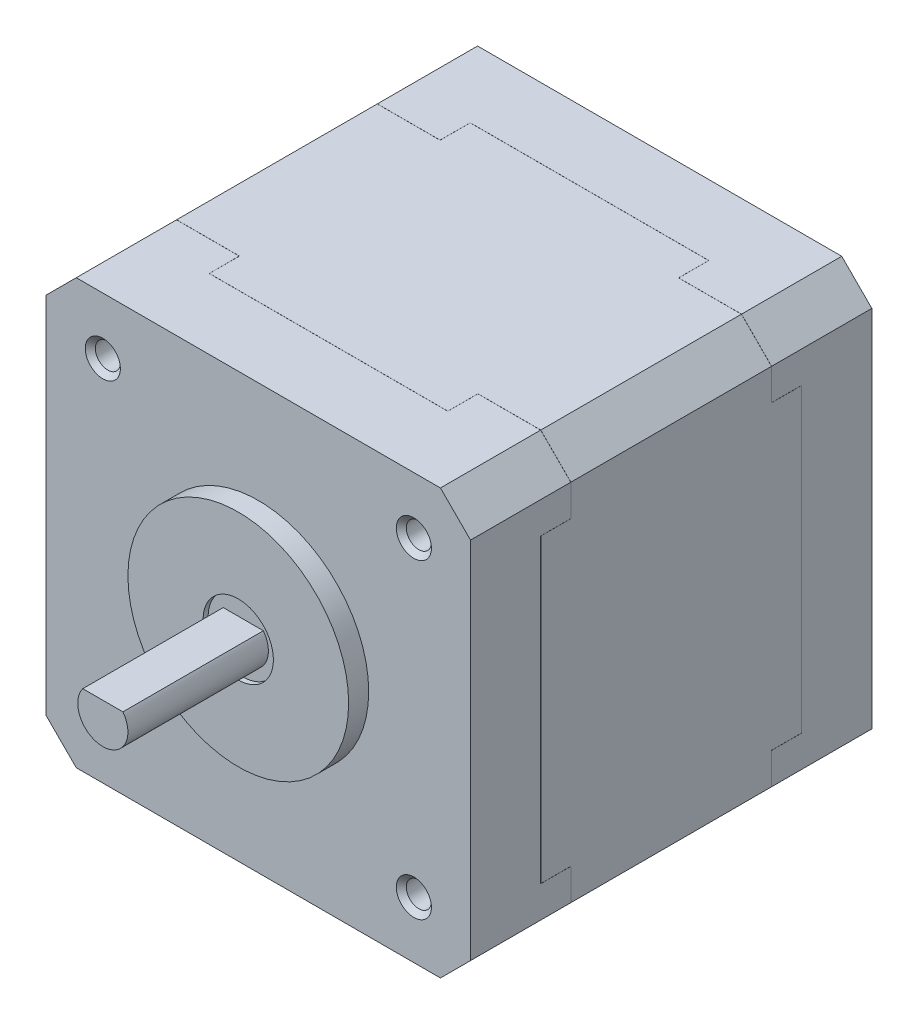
ISO-10303-21;
HEADER;
FILE_DESCRIPTION(('STEP AP214'),'2;1');
FILE_NAME('part.step','',(''),(''),'','','');
FILE_SCHEMA(('AUTOMOTIVE_DESIGN { 1 0 10303 214 1 1 1 1 }'));
ENDSEC;
DATA;
#1=APPLICATION_CONTEXT('core data for automotive mechanical design processes');
#2=APPLICATION_PROTOCOL_DEFINITION('international standard','automotive_design',2000,#1);
#3=PRODUCT_CONTEXT('',#1,'mechanical');
#4=PRODUCT('Part','Part','',(#3));
#5=PRODUCT_RELATED_PRODUCT_CATEGORY('part','',(#4));
#6=PRODUCT_DEFINITION_FORMATION('','',#4);
#7=PRODUCT_DEFINITION_CONTEXT('part definition',#1,'design');
#8=PRODUCT_DEFINITION('design','',#6,#7);
#9=PRODUCT_DEFINITION_SHAPE('','',#8);
#10=(LENGTH_UNIT() NAMED_UNIT(*) SI_UNIT(.MILLI.,.METRE.));
#11=(NAMED_UNIT(*) PLANE_ANGLE_UNIT() SI_UNIT($,.RADIAN.));
#12=(NAMED_UNIT(*) SI_UNIT($,.STERADIAN.) SOLID_ANGLE_UNIT());
#13=UNCERTAINTY_MEASURE_WITH_UNIT(LENGTH_MEASURE(1.E-05),#10,'distance_accuracy_value','');
#14=(GEOMETRIC_REPRESENTATION_CONTEXT(3) GLOBAL_UNCERTAINTY_ASSIGNED_CONTEXT((#13)) GLOBAL_UNIT_ASSIGNED_CONTEXT((#10,
#11,#12)) REPRESENTATION_CONTEXT('',''));
#15=CARTESIAN_POINT('',(0.,0.,0.));
#16=DIRECTION('',(0.,0.,1.));
#17=DIRECTION('',(1.,0.,0.));
#18=AXIS2_PLACEMENT_3D('',#15,#16,#17);
#19=CARTESIAN_POINT('',(-32.85,-15.01,6.99));
#20=DIRECTION('',(0.,0.,-1.));
#21=DIRECTION('',(-1.,0.,0.));
#22=AXIS2_PLACEMENT_3D('',#19,#20,#21);
#23=PLANE('',#22);
#24=DIRECTION('',(0.,-1.,0.));
#25=VECTOR('',#24,1.);
#26=CARTESIAN_POINT('',(11.8890721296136,21.15,6.99));
#27=LINE('',#26,#25);
#28=CARTESIAN_POINT('',(11.8890721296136,-15.01,6.99));
#29=VERTEX_POINT('',#28);
#30=CARTESIAN_POINT('',(11.8890721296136,-21.15,6.99));
#31=VERTEX_POINT('',#30);
#32=EDGE_CURVE('E87',#29,#31,#27,.T.);
#33=ORIENTED_EDGE('',*,*,#32,.F.);
#34=DIRECTION('',(1.,0.,0.));
#35=VECTOR('',#34,1.);
#36=CARTESIAN_POINT('',(-32.85,-15.01,6.99));
#37=LINE('',#36,#35);
#38=CARTESIAN_POINT('',(21.15,-15.01,6.99));
#39=VERTEX_POINT('',#38);
#40=EDGE_CURVE('E310',#29,#39,#37,.T.);
#41=ORIENTED_EDGE('',*,*,#40,.T.);
#42=DIRECTION('',(0.,1.,0.));
#43=VECTOR('',#42,1.);
#44=CARTESIAN_POINT('',(21.15,-15.01,6.99));
#45=LINE('',#44,#43);
#46=CARTESIAN_POINT('',(21.15,15.01,6.99));
#47=VERTEX_POINT('',#46);
#48=EDGE_CURVE('E312',#39,#47,#45,.T.);
#49=ORIENTED_EDGE('',*,*,#48,.T.);
#50=DIRECTION('',(1.,0.,0.));
#51=VECTOR('',#50,1.);
#52=CARTESIAN_POINT('',(-32.85,15.01,6.99));
#53=LINE('',#52,#51);
#54=CARTESIAN_POINT('',(11.8890721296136,15.01,6.99));
#55=VERTEX_POINT('',#54);
#56=EDGE_CURVE('E314',#55,#47,#53,.T.);
#57=ORIENTED_EDGE('',*,*,#56,.F.);
#58=CARTESIAN_POINT('',(11.8890721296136,21.15,6.99));
#59=VERTEX_POINT('',#58);
#60=EDGE_CURVE('E328',#59,#55,#27,.T.);
#61=ORIENTED_EDGE('',*,*,#60,.F.);
#62=DIRECTION('',(1.,0.,0.));
#63=VECTOR('',#62,1.);
#64=CARTESIAN_POINT('',(11.8890721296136,21.15,6.99));
#65=LINE('',#64,#63);
#66=CARTESIAN_POINT('',(-11.8890721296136,21.15,6.99));
#67=VERTEX_POINT('',#66);
#68=EDGE_CURVE('E337',#67,#59,#65,.T.);
#69=ORIENTED_EDGE('',*,*,#68,.F.);
#70=DIRECTION('',(0.,-1.,0.));
#71=VECTOR('',#70,1.);
#72=CARTESIAN_POINT('',(-11.8890721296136,21.15,6.99));
#73=LINE('',#72,#71);
#74=CARTESIAN_POINT('',(-11.8890721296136,15.01,6.99));
#75=VERTEX_POINT('',#74);
#76=EDGE_CURVE('E260',#67,#75,#73,.T.);
#77=ORIENTED_EDGE('',*,*,#76,.T.);
#78=DIRECTION('',(-1.,0.,0.));
#79=VECTOR('',#78,1.);
#80=CARTESIAN_POINT('',(32.85,15.01,6.99));
#81=LINE('',#80,#79);
#82=CARTESIAN_POINT('',(-21.15,15.01,6.99));
#83=VERTEX_POINT('',#82);
#84=EDGE_CURVE('E244',#75,#83,#81,.T.);
#85=ORIENTED_EDGE('',*,*,#84,.T.);
#86=DIRECTION('',(0.,1.,0.));
#87=VECTOR('',#86,1.);
#88=CARTESIAN_POINT('',(-21.15,-15.01,6.99));
#89=LINE('',#88,#87);
#90=CARTESIAN_POINT('',(-21.15,-15.01,6.99));
#91=VERTEX_POINT('',#90);
#92=EDGE_CURVE('E242',#91,#83,#89,.T.);
#93=ORIENTED_EDGE('',*,*,#92,.F.);
#94=DIRECTION('',(-1.,0.,0.));
#95=VECTOR('',#94,1.);
#96=CARTESIAN_POINT('',(32.85,-15.01,6.99));
#97=LINE('',#96,#95);
#98=CARTESIAN_POINT('',(-11.8890721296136,-15.01,6.99));
#99=VERTEX_POINT('',#98);
#100=EDGE_CURVE('E239',#99,#91,#97,.T.);
#101=ORIENTED_EDGE('',*,*,#100,.F.);
#102=CARTESIAN_POINT('',(-11.8890721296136,-21.15,6.99));
#103=VERTEX_POINT('',#102);
#104=EDGE_CURVE('E267',#99,#103,#73,.T.);
#105=ORIENTED_EDGE('',*,*,#104,.T.);
#106=DIRECTION('',(1.,0.,0.));
#107=VECTOR('',#106,1.);
#108=CARTESIAN_POINT('',(11.8890721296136,-21.15,6.99));
#109=LINE('',#108,#107);
#110=EDGE_CURVE('E12',#103,#31,#109,.T.);
#111=ORIENTED_EDGE('',*,*,#110,.T.);
#112=EDGE_LOOP('',(#33,#41,#49,#57,#61,#69,#77,#85,#93,#101,#105,#111));
#113=FACE_BOUND('',#112,.T.);
#114=ADVANCED_FACE('F53',(#113),#23,.F.);
#115=CARTESIAN_POINT('',(21.15,21.15,0.));
#116=DIRECTION('',(0.,0.,-1.));
#117=DIRECTION('',(-1.,0.,0.));
#118=AXIS2_PLACEMENT_3D('',#115,#116,#117);
#119=PLANE('',#118);
#120=DIRECTION('',(1.,0.,0.));
#121=VECTOR('',#120,1.);
#122=CARTESIAN_POINT('',(-21.15,-21.15,0.));
#123=LINE('',#122,#121);
#124=CARTESIAN_POINT('',(-18.15,-21.15,0.));
#125=VERTEX_POINT('',#124);
#126=CARTESIAN_POINT('',(18.15,-21.15,0.));
#127=VERTEX_POINT('',#126);
#128=EDGE_CURVE('E292',#125,#127,#123,.T.);
#129=ORIENTED_EDGE('',*,*,#128,.F.);
#130=DIRECTION('',(-0.707106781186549,0.707106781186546,0.));
#131=VECTOR('',#130,1.);
#132=CARTESIAN_POINT('',(-40.8,1.49999999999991,0.));
#133=LINE('',#132,#131);
#134=CARTESIAN_POINT('',(-21.15,-18.15,0.));
#135=VERTEX_POINT('',#134);
#136=EDGE_CURVE('E220',#135,#125,#133,.F.);
#137=ORIENTED_EDGE('',*,*,#136,.F.);
#138=DIRECTION('',(0.,1.,0.));
#139=VECTOR('',#138,1.);
#140=CARTESIAN_POINT('',(-21.15,-21.15,0.));
#141=LINE('',#140,#139);
#142=CARTESIAN_POINT('',(-21.15,18.15,0.));
#143=VERTEX_POINT('',#142);
#144=EDGE_CURVE('E219',#135,#143,#141,.T.);
#145=ORIENTED_EDGE('',*,*,#144,.T.);
#146=DIRECTION('',(0.707106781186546,0.707106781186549,0.));
#147=VECTOR('',#146,1.);
#148=CARTESIAN_POINT('',(-19.65,19.65,0.));
#149=LINE('',#148,#147);
#150=CARTESIAN_POINT('',(-18.15,21.15,0.));
#151=VERTEX_POINT('',#150);
#152=EDGE_CURVE('E209',#151,#143,#149,.F.);
#153=ORIENTED_EDGE('',*,*,#152,.F.);
#154=DIRECTION('',(-1.,0.,0.));
#155=VECTOR('',#154,1.);
#156=CARTESIAN_POINT('',(-21.15,21.15,0.));
#157=LINE('',#156,#155);
#158=CARTESIAN_POINT('',(18.15,21.15,0.));
#159=VERTEX_POINT('',#158);
#160=EDGE_CURVE('E192',#159,#151,#157,.T.);
#161=ORIENTED_EDGE('',*,*,#160,.F.);
#162=DIRECTION('',(-0.707106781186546,0.707106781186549,0.));
#163=VECTOR('',#162,1.);
#164=CARTESIAN_POINT('',(19.65,19.65,0.));
#165=LINE('',#164,#163);
#166=CARTESIAN_POINT('',(21.15,18.15,0.));
#167=VERTEX_POINT('',#166);
#168=EDGE_CURVE('E271',#159,#167,#165,.F.);
#169=ORIENTED_EDGE('',*,*,#168,.T.);
#170=DIRECTION('',(0.,1.,0.));
#171=VECTOR('',#170,1.);
#172=CARTESIAN_POINT('',(21.15,-21.15,0.));
#173=LINE('',#172,#171);
#174=CARTESIAN_POINT('',(21.15,-18.15,0.));
#175=VERTEX_POINT('',#174);
#176=EDGE_CURVE('E299',#175,#167,#173,.T.);
#177=ORIENTED_EDGE('',*,*,#176,.F.);
#178=DIRECTION('',(0.707106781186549,0.707106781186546,0.));
#179=VECTOR('',#178,1.);
#180=CARTESIAN_POINT('',(40.8,1.49999999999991,0.));
#181=LINE('',#180,#179);
#182=EDGE_CURVE('E293',#175,#127,#181,.F.);
#183=ORIENTED_EDGE('',*,*,#182,.T.);
#184=EDGE_LOOP('',(#129,#137,#145,#153,#161,#169,#177,#183));
#185=FACE_BOUND('',#184,.T.);
#186=ADVANCED_FACE('F216',(#185),#119,.T.);
#187=CARTESIAN_POINT('',(18.15,21.15,40.));
#188=DIRECTION('',(-0.707106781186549,-0.707106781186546,0.));
#189=DIRECTION('',(0.707106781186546,-0.707106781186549,0.));
#190=AXIS2_PLACEMENT_3D('',#187,#188,#189);
#191=PLANE('',#190);
#192=DIRECTION('',(0.707106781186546,-0.707106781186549,0.));
#193=VECTOR('',#192,1.);
#194=CARTESIAN_POINT('',(18.15,21.15,9.99));
#195=LINE('',#194,#193);
#196=CARTESIAN_POINT('',(21.15,18.15,9.99));
#197=VERTEX_POINT('',#196);
#198=CARTESIAN_POINT('',(18.15,21.15,9.99));
#199=VERTEX_POINT('',#198);
#200=EDGE_CURVE('E285',#197,#199,#195,.F.);
#201=ORIENTED_EDGE('',*,*,#200,.F.);
#202=DIRECTION('',(0.,0.,1.));
#203=VECTOR('',#202,1.);
#204=CARTESIAN_POINT('',(21.15,18.15,40.));
#205=LINE('',#204,#203);
#206=EDGE_CURVE('E203',#167,#197,#205,.T.);
#207=ORIENTED_EDGE('',*,*,#206,.F.);
#208=ORIENTED_EDGE('',*,*,#168,.F.);
#209=DIRECTION('',(0.,0.,-1.));
#210=VECTOR('',#209,1.);
#211=CARTESIAN_POINT('',(18.15,21.15,40.));
#212=LINE('',#211,#210);
#213=EDGE_CURVE('E199',#199,#159,#212,.T.);
#214=ORIENTED_EDGE('',*,*,#213,.F.);
#215=EDGE_LOOP('',(#201,#207,#208,#214));
#216=FACE_BOUND('',#215,.T.);
#217=ADVANCED_FACE('F384',(#216),#191,.F.);
#218=CARTESIAN_POINT('',(21.15,-18.15,40.));
#219=DIRECTION('',(-0.707106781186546,0.707106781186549,0.));
#220=DIRECTION('',(-0.707106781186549,-0.707106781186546,0.));
#221=AXIS2_PLACEMENT_3D('',#218,#219,#220);
#222=PLANE('',#221);
#223=DIRECTION('',(-0.707106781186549,-0.707106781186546,0.));
#224=VECTOR('',#223,1.);
#225=CARTESIAN_POINT('',(21.15,-18.15,9.99));
#226=LINE('',#225,#224);
#227=CARTESIAN_POINT('',(18.15,-21.15,9.99));
#228=VERTEX_POINT('',#227);
#229=CARTESIAN_POINT('',(21.15,-18.15,9.99));
#230=VERTEX_POINT('',#229);
#231=EDGE_CURVE('E284',#228,#230,#226,.F.);
#232=ORIENTED_EDGE('',*,*,#231,.F.);
#233=DIRECTION('',(0.,0.,1.));
#234=VECTOR('',#233,1.);
#235=CARTESIAN_POINT('',(18.15,-21.15,40.));
#236=LINE('',#235,#234);
#237=EDGE_CURVE('E288',#127,#228,#236,.T.);
#238=ORIENTED_EDGE('',*,*,#237,.F.);
#239=ORIENTED_EDGE('',*,*,#182,.F.);
#240=DIRECTION('',(0.,0.,-1.));
#241=VECTOR('',#240,1.);
#242=CARTESIAN_POINT('',(21.15,-18.15,40.));
#243=LINE('',#242,#241);
#244=EDGE_CURVE('E297',#230,#175,#243,.T.);
#245=ORIENTED_EDGE('',*,*,#244,.F.);
#246=EDGE_LOOP('',(#232,#238,#239,#245));
#247=FACE_BOUND('',#246,.T.);
#248=ADVANCED_FACE('F352',(#247),#222,.F.);
#249=CARTESIAN_POINT('',(-21.15,-21.15,40.));
#250=DIRECTION('',(0.,1.,0.));
#251=DIRECTION('',(0.,0.,1.));
#252=AXIS2_PLACEMENT_3D('',#249,#250,#251);
#253=PLANE('',#252);
#254=DIRECTION('',(0.00166112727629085,0.,0.999998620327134));
#255=VECTOR('',#254,1.);
#256=CARTESIAN_POINT('',(11.8940721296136,-21.15,10.));
#257=LINE('',#256,#255);
#258=CARTESIAN_POINT('',(11.8940555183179,-21.15,9.99));
#259=VERTEX_POINT('',#258);
#260=EDGE_CURVE('E63',#31,#259,#257,.T.);
#261=ORIENTED_EDGE('',*,*,#260,.F.);
#262=ORIENTED_EDGE('',*,*,#110,.F.);
#263=DIRECTION('',(-0.00166112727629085,0.,0.999998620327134));
#264=VECTOR('',#263,1.);
#265=CARTESIAN_POINT('',(-11.8940721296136,-21.15,10.));
#266=LINE('',#265,#264);
#267=CARTESIAN_POINT('',(-11.8940555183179,-21.15,9.99));
#268=VERTEX_POINT('',#267);
#269=EDGE_CURVE('E268',#103,#268,#266,.T.);
#270=ORIENTED_EDGE('',*,*,#269,.T.);
#271=DIRECTION('',(1.,0.,0.));
#272=VECTOR('',#271,1.);
#273=CARTESIAN_POINT('',(21.15,-21.15,9.99));
#274=LINE('',#273,#272);
#275=CARTESIAN_POINT('',(-18.15,-21.15,9.99));
#276=VERTEX_POINT('',#275);
#277=EDGE_CURVE('E275',#276,#268,#274,.T.);
#278=ORIENTED_EDGE('',*,*,#277,.F.);
#279=DIRECTION('',(0.,0.,1.));
#280=VECTOR('',#279,1.);
#281=CARTESIAN_POINT('',(-18.15,-21.15,40.));
#282=LINE('',#281,#280);
#283=EDGE_CURVE('E223',#125,#276,#282,.T.);
#284=ORIENTED_EDGE('',*,*,#283,.F.);
#285=ORIENTED_EDGE('',*,*,#128,.T.);
#286=ORIENTED_EDGE('',*,*,#237,.T.);
#287=DIRECTION('',(-1.,0.,0.));
#288=VECTOR('',#287,1.);
#289=CARTESIAN_POINT('',(-21.15,-21.15,9.99));
#290=LINE('',#289,#288);
#291=EDGE_CURVE('E291',#228,#259,#290,.T.);
#292=ORIENTED_EDGE('',*,*,#291,.T.);
#293=EDGE_LOOP('',(#261,#262,#270,#278,#284,#285,#286,#292));
#294=FACE_BOUND('',#293,.T.);
#295=ADVANCED_FACE('F55',(#294),#253,.F.);
#296=CARTESIAN_POINT('',(-21.15,21.15,40.));
#297=DIRECTION('',(0.,-1.,0.));
#298=DIRECTION('',(0.,0.,-1.));
#299=AXIS2_PLACEMENT_3D('',#296,#297,#298);
#300=PLANE('',#299);
#301=ORIENTED_EDGE('',*,*,#160,.T.);
#302=DIRECTION('',(0.,0.,-1.));
#303=VECTOR('',#302,1.);
#304=CARTESIAN_POINT('',(-18.15,21.15,40.));
#305=LINE('',#304,#303);
#306=CARTESIAN_POINT('',(-18.15,21.15,9.99));
#307=VERTEX_POINT('',#306);
#308=EDGE_CURVE('E196',#307,#151,#305,.T.);
#309=ORIENTED_EDGE('',*,*,#308,.F.);
#310=DIRECTION('',(-1.,0.,0.));
#311=VECTOR('',#310,1.);
#312=CARTESIAN_POINT('',(21.15,21.15,9.99));
#313=LINE('',#312,#311);
#314=CARTESIAN_POINT('',(-11.8940555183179,21.15,9.99));
#315=VERTEX_POINT('',#314);
#316=EDGE_CURVE('E214',#315,#307,#313,.T.);
#317=ORIENTED_EDGE('',*,*,#316,.F.);
#318=DIRECTION('',(-0.00166112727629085,0.,0.999998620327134));
#319=VECTOR('',#318,1.);
#320=CARTESIAN_POINT('',(-11.8940721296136,21.15,10.));
#321=LINE('',#320,#319);
#322=EDGE_CURVE('E272',#67,#315,#321,.T.);
#323=ORIENTED_EDGE('',*,*,#322,.F.);
#324=ORIENTED_EDGE('',*,*,#68,.T.);
#325=DIRECTION('',(0.00166112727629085,0.,0.999998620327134));
#326=VECTOR('',#325,1.);
#327=CARTESIAN_POINT('',(11.8940721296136,21.15,10.));
#328=LINE('',#327,#326);
#329=CARTESIAN_POINT('',(11.8940555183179,21.15,9.99));
#330=VERTEX_POINT('',#329);
#331=EDGE_CURVE('E334',#59,#330,#328,.T.);
#332=ORIENTED_EDGE('',*,*,#331,.T.);
#333=DIRECTION('',(1.,0.,0.));
#334=VECTOR('',#333,1.);
#335=CARTESIAN_POINT('',(-21.15,21.15,9.99));
#336=LINE('',#335,#334);
#337=EDGE_CURVE('E287',#330,#199,#336,.T.);
#338=ORIENTED_EDGE('',*,*,#337,.T.);
#339=ORIENTED_EDGE('',*,*,#213,.T.);
#340=EDGE_LOOP('',(#301,#309,#317,#323,#324,#332,#338,#339));
#341=FACE_BOUND('',#340,.T.);
#342=ADVANCED_FACE('F194',(#341),#300,.F.);
#343=CARTESIAN_POINT('',(21.15,-21.15,40.));
#344=DIRECTION('',(-1.,0.,0.));
#345=DIRECTION('',(0.,0.,1.));
#346=AXIS2_PLACEMENT_3D('',#343,#344,#345);
#347=PLANE('',#346);
#348=ORIENTED_EDGE('',*,*,#206,.T.);
#349=DIRECTION('',(0.,1.,0.));
#350=VECTOR('',#349,1.);
#351=CARTESIAN_POINT('',(21.15,15.01,9.99));
#352=LINE('',#351,#350);
#353=CARTESIAN_POINT('',(21.15,15.01,9.99));
#354=VERTEX_POINT('',#353);
#355=EDGE_CURVE('E309',#354,#197,#352,.T.);
#356=ORIENTED_EDGE('',*,*,#355,.F.);
#357=DIRECTION('',(0.,0.,1.));
#358=VECTOR('',#357,1.);
#359=CARTESIAN_POINT('',(21.15,15.01,6.99));
#360=LINE('',#359,#358);
#361=EDGE_CURVE('E313',#47,#354,#360,.T.);
#362=ORIENTED_EDGE('',*,*,#361,.F.);
#363=ORIENTED_EDGE('',*,*,#48,.F.);
#364=DIRECTION('',(0.,0.,-1.));
#365=VECTOR('',#364,1.);
#366=CARTESIAN_POINT('',(21.15,-15.01,9.99));
#367=LINE('',#366,#365);
#368=CARTESIAN_POINT('',(21.15,-15.01,9.99));
#369=VERTEX_POINT('',#368);
#370=EDGE_CURVE('E322',#369,#39,#367,.T.);
#371=ORIENTED_EDGE('',*,*,#370,.F.);
#372=DIRECTION('',(0.,1.,0.));
#373=VECTOR('',#372,1.);
#374=CARTESIAN_POINT('',(21.15,-21.16,9.99));
#375=LINE('',#374,#373);
#376=EDGE_CURVE('E306',#230,#369,#375,.T.);
#377=ORIENTED_EDGE('',*,*,#376,.F.);
#378=ORIENTED_EDGE('',*,*,#244,.T.);
#379=ORIENTED_EDGE('',*,*,#176,.T.);
#380=EDGE_LOOP('',(#348,#356,#362,#363,#371,#377,#378,#379));
#381=FACE_BOUND('',#380,.T.);
#382=ADVANCED_FACE('F356',(#381),#347,.F.);
#383=CARTESIAN_POINT('',(-32.85,15.01,6.99));
#384=DIRECTION('',(0.,1.,0.));
#385=DIRECTION('',(0.,0.,1.));
#386=AXIS2_PLACEMENT_3D('',#383,#384,#385);
#387=PLANE('',#386);
#388=DIRECTION('',(1.,0.,0.));
#389=VECTOR('',#388,1.);
#390=CARTESIAN_POINT('',(-32.85,15.01,9.99));
#391=LINE('',#390,#389);
#392=CARTESIAN_POINT('',(11.8940555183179,15.01,9.99));
#393=VERTEX_POINT('',#392);
#394=EDGE_CURVE('E317',#393,#354,#391,.T.);
#395=ORIENTED_EDGE('',*,*,#394,.F.);
#396=DIRECTION('',(-0.00166112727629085,0.,-0.999998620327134));
#397=VECTOR('',#396,1.);
#398=CARTESIAN_POINT('',(11.8889486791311,15.01,6.91568280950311));
#399=LINE('',#398,#397);
#400=EDGE_CURVE('E91',#393,#55,#399,.T.);
#401=ORIENTED_EDGE('',*,*,#400,.T.);
#402=ORIENTED_EDGE('',*,*,#56,.T.);
#403=ORIENTED_EDGE('',*,*,#361,.T.);
#404=EDGE_LOOP('',(#395,#401,#402,#403));
#405=FACE_BOUND('',#404,.T.);
#406=ADVANCED_FACE('F391',(#405),#387,.F.);
#407=CARTESIAN_POINT('',(-32.85,-15.01,9.99));
#408=DIRECTION('',(0.,-1.,0.));
#409=DIRECTION('',(0.,0.,-1.));
#410=AXIS2_PLACEMENT_3D('',#407,#408,#409);
#411=PLANE('',#410);
#412=ORIENTED_EDGE('',*,*,#40,.F.);
#413=DIRECTION('',(0.00166112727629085,0.,0.999998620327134));
#414=VECTOR('',#413,1.);
#415=CARTESIAN_POINT('',(11.8939320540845,-15.01,9.91567453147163));
#416=LINE('',#415,#414);
#417=CARTESIAN_POINT('',(11.8940555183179,-15.01,9.99));
#418=VERTEX_POINT('',#417);
#419=EDGE_CURVE('E72',#29,#418,#416,.T.);
#420=ORIENTED_EDGE('',*,*,#419,.T.);
#421=DIRECTION('',(1.,0.,0.));
#422=VECTOR('',#421,1.);
#423=CARTESIAN_POINT('',(-32.85,-15.01,9.99));
#424=LINE('',#423,#422);
#425=EDGE_CURVE('E57',#418,#369,#424,.T.);
#426=ORIENTED_EDGE('',*,*,#425,.T.);
#427=ORIENTED_EDGE('',*,*,#370,.T.);
#428=EDGE_LOOP('',(#412,#420,#426,#427));
#429=FACE_BOUND('',#428,.T.);
#430=ADVANCED_FACE('F362',(#429),#411,.F.);
#431=CARTESIAN_POINT('',(-32.85,15.01,9.99));
#432=DIRECTION('',(0.,0.,-1.));
#433=DIRECTION('',(-1.,0.,0.));
#434=AXIS2_PLACEMENT_3D('',#431,#432,#433);
#435=PLANE('',#434);
#436=ORIENTED_EDGE('',*,*,#337,.F.);
#437=DIRECTION('',(0.,-1.,0.));
#438=VECTOR('',#437,1.);
#439=CARTESIAN_POINT('',(11.8940555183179,15.01,9.99));
#440=LINE('',#439,#438);
#441=EDGE_CURVE('E325',#330,#393,#440,.T.);
#442=ORIENTED_EDGE('',*,*,#441,.T.);
#443=ORIENTED_EDGE('',*,*,#394,.T.);
#444=ORIENTED_EDGE('',*,*,#355,.T.);
#445=ORIENTED_EDGE('',*,*,#200,.T.);
#446=EDGE_LOOP('',(#436,#442,#443,#444,#445));
#447=FACE_BOUND('',#446,.T.);
#448=ADVANCED_FACE('F388',(#447),#435,.F.);
#449=CARTESIAN_POINT('',(-32.85,-21.16,9.99));
#450=DIRECTION('',(0.,0.,-1.));
#451=DIRECTION('',(-1.,0.,0.));
#452=AXIS2_PLACEMENT_3D('',#449,#450,#451);
#453=PLANE('',#452);
#454=ORIENTED_EDGE('',*,*,#425,.F.);
#455=DIRECTION('',(0.,-1.,0.));
#456=VECTOR('',#455,1.);
#457=CARTESIAN_POINT('',(11.8940555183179,-21.16,9.99));
#458=LINE('',#457,#456);
#459=EDGE_CURVE('E281',#418,#259,#458,.T.);
#460=ORIENTED_EDGE('',*,*,#459,.T.);
#461=ORIENTED_EDGE('',*,*,#291,.F.);
#462=ORIENTED_EDGE('',*,*,#231,.T.);
#463=ORIENTED_EDGE('',*,*,#376,.T.);
#464=EDGE_LOOP('',(#454,#460,#461,#462,#463));
#465=FACE_BOUND('',#464,.T.);
#466=ADVANCED_FACE('F348',(#465),#453,.F.);
#467=CARTESIAN_POINT('',(11.8940721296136,21.15,10.));
#468=DIRECTION('',(0.999998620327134,0.,-0.00166112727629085));
#469=DIRECTION('',(-0.00166112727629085,0.,-0.999998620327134));
#470=AXIS2_PLACEMENT_3D('',#467,#468,#469);
#471=PLANE('',#470);
#472=ORIENTED_EDGE('',*,*,#441,.F.);
#473=ORIENTED_EDGE('',*,*,#331,.F.);
#474=ORIENTED_EDGE('',*,*,#60,.T.);
#475=ORIENTED_EDGE('',*,*,#400,.F.);
#476=EDGE_LOOP('',(#472,#473,#474,#475));
#477=FACE_BOUND('',#476,.T.);
#478=ADVANCED_FACE('F395',(#477),#471,.F.);
#479=ORIENTED_EDGE('',*,*,#32,.T.);
#480=ORIENTED_EDGE('',*,*,#260,.T.);
#481=ORIENTED_EDGE('',*,*,#459,.F.);
#482=ORIENTED_EDGE('',*,*,#419,.F.);
#483=EDGE_LOOP('',(#479,#480,#481,#482));
#484=FACE_BOUND('',#483,.T.);
#485=ADVANCED_FACE('F433',(#484),#471,.F.);
#486=CARTESIAN_POINT('',(-18.15,21.15,40.));
#487=DIRECTION('',(0.707106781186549,-0.707106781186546,0.));
#488=DIRECTION('',(-0.707106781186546,-0.707106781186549,0.));
#489=AXIS2_PLACEMENT_3D('',#486,#487,#488);
#490=PLANE('',#489);
#491=DIRECTION('',(-0.707106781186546,-0.707106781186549,0.));
#492=VECTOR('',#491,1.);
#493=CARTESIAN_POINT('',(-18.15,21.15,9.99));
#494=LINE('',#493,#492);
#495=CARTESIAN_POINT('',(-21.15,18.15,9.99));
#496=VERTEX_POINT('',#495);
#497=EDGE_CURVE('E212',#496,#307,#494,.F.);
#498=ORIENTED_EDGE('',*,*,#497,.T.);
#499=ORIENTED_EDGE('',*,*,#308,.T.);
#500=ORIENTED_EDGE('',*,*,#152,.T.);
#501=DIRECTION('',(0.,0.,1.));
#502=VECTOR('',#501,1.);
#503=CARTESIAN_POINT('',(-21.15,18.15,40.));
#504=LINE('',#503,#502);
#505=EDGE_CURVE('E213',#143,#496,#504,.T.);
#506=ORIENTED_EDGE('',*,*,#505,.T.);
#507=EDGE_LOOP('',(#498,#499,#500,#506));
#508=FACE_BOUND('',#507,.T.);
#509=ADVANCED_FACE('F207',(#508),#490,.F.);
#510=CARTESIAN_POINT('',(-21.15,-18.15,40.));
#511=DIRECTION('',(0.707106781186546,0.707106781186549,0.));
#512=DIRECTION('',(0.707106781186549,-0.707106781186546,0.));
#513=AXIS2_PLACEMENT_3D('',#510,#511,#512);
#514=PLANE('',#513);
#515=DIRECTION('',(0.707106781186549,-0.707106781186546,0.));
#516=VECTOR('',#515,1.);
#517=CARTESIAN_POINT('',(-21.15,-18.15,9.99));
#518=LINE('',#517,#516);
#519=CARTESIAN_POINT('',(-21.15,-18.15,9.99));
#520=VERTEX_POINT('',#519);
#521=EDGE_CURVE('E232',#276,#520,#518,.F.);
#522=ORIENTED_EDGE('',*,*,#521,.T.);
#523=DIRECTION('',(0.,0.,-1.));
#524=VECTOR('',#523,1.);
#525=CARTESIAN_POINT('',(-21.15,-18.15,40.));
#526=LINE('',#525,#524);
#527=EDGE_CURVE('E227',#520,#135,#526,.T.);
#528=ORIENTED_EDGE('',*,*,#527,.T.);
#529=ORIENTED_EDGE('',*,*,#136,.T.);
#530=ORIENTED_EDGE('',*,*,#283,.T.);
#531=EDGE_LOOP('',(#522,#528,#529,#530));
#532=FACE_BOUND('',#531,.T.);
#533=ADVANCED_FACE('F380',(#532),#514,.F.);
#534=CARTESIAN_POINT('',(-21.15,-21.15,40.));
#535=DIRECTION('',(1.,0.,0.));
#536=DIRECTION('',(0.,0.,1.));
#537=AXIS2_PLACEMENT_3D('',#534,#535,#536);
#538=PLANE('',#537);
#539=ORIENTED_EDGE('',*,*,#505,.F.);
#540=ORIENTED_EDGE('',*,*,#144,.F.);
#541=ORIENTED_EDGE('',*,*,#527,.F.);
#542=DIRECTION('',(0.,1.,0.));
#543=VECTOR('',#542,1.);
#544=CARTESIAN_POINT('',(-21.15,-21.16,9.99));
#545=LINE('',#544,#543);
#546=CARTESIAN_POINT('',(-21.15,-15.01,9.99));
#547=VERTEX_POINT('',#546);
#548=EDGE_CURVE('E235',#520,#547,#545,.T.);
#549=ORIENTED_EDGE('',*,*,#548,.T.);
#550=DIRECTION('',(0.,0.,-1.));
#551=VECTOR('',#550,1.);
#552=CARTESIAN_POINT('',(-21.15,-15.01,9.99));
#553=LINE('',#552,#551);
#554=EDGE_CURVE('E254',#547,#91,#553,.T.);
#555=ORIENTED_EDGE('',*,*,#554,.T.);
#556=ORIENTED_EDGE('',*,*,#92,.T.);
#557=DIRECTION('',(0.,0.,1.));
#558=VECTOR('',#557,1.);
#559=CARTESIAN_POINT('',(-21.15,15.01,6.99));
#560=LINE('',#559,#558);
#561=CARTESIAN_POINT('',(-21.15,15.01,9.99));
#562=VERTEX_POINT('',#561);
#563=EDGE_CURVE('E243',#83,#562,#560,.T.);
#564=ORIENTED_EDGE('',*,*,#563,.T.);
#565=DIRECTION('',(0.,1.,0.));
#566=VECTOR('',#565,1.);
#567=CARTESIAN_POINT('',(-21.15,15.01,9.99));
#568=LINE('',#567,#566);
#569=EDGE_CURVE('E238',#562,#496,#568,.T.);
#570=ORIENTED_EDGE('',*,*,#569,.T.);
#571=EDGE_LOOP('',(#539,#540,#541,#549,#555,#556,#564,#570));
#572=FACE_BOUND('',#571,.T.);
#573=ADVANCED_FACE('F407',(#572),#538,.F.);
#574=CARTESIAN_POINT('',(32.85,15.01,6.99));
#575=DIRECTION('',(0.,1.,0.));
#576=DIRECTION('',(0.,0.,1.));
#577=AXIS2_PLACEMENT_3D('',#574,#575,#576);
#578=PLANE('',#577);
#579=DIRECTION('',(-1.,0.,0.));
#580=VECTOR('',#579,1.);
#581=CARTESIAN_POINT('',(32.85,15.01,9.99));
#582=LINE('',#581,#580);
#583=CARTESIAN_POINT('',(-11.8940555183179,15.01,9.99));
#584=VERTEX_POINT('',#583);
#585=EDGE_CURVE('E248',#584,#562,#582,.T.);
#586=ORIENTED_EDGE('',*,*,#585,.T.);
#587=ORIENTED_EDGE('',*,*,#563,.F.);
#588=ORIENTED_EDGE('',*,*,#84,.F.);
#589=DIRECTION('',(0.00166112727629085,0.,-0.999998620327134));
#590=VECTOR('',#589,1.);
#591=CARTESIAN_POINT('',(-11.8889486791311,15.01,6.91568280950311));
#592=LINE('',#591,#590);
#593=EDGE_CURVE('E231',#584,#75,#592,.T.);
#594=ORIENTED_EDGE('',*,*,#593,.F.);
#595=EDGE_LOOP('',(#586,#587,#588,#594));
#596=FACE_BOUND('',#595,.T.);
#597=ADVANCED_FACE('F403',(#596),#578,.F.);
#598=CARTESIAN_POINT('',(32.85,-15.01,9.99));
#599=DIRECTION('',(0.,-1.,0.));
#600=DIRECTION('',(0.,0.,-1.));
#601=AXIS2_PLACEMENT_3D('',#598,#599,#600);
#602=PLANE('',#601);
#603=ORIENTED_EDGE('',*,*,#100,.T.);
#604=ORIENTED_EDGE('',*,*,#554,.F.);
#605=DIRECTION('',(-1.,0.,0.));
#606=VECTOR('',#605,1.);
#607=CARTESIAN_POINT('',(32.85,-15.01,9.99));
#608=LINE('',#607,#606);
#609=CARTESIAN_POINT('',(-11.8940555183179,-15.01,9.99));
#610=VERTEX_POINT('',#609);
#611=EDGE_CURVE('E257',#610,#547,#608,.T.);
#612=ORIENTED_EDGE('',*,*,#611,.F.);
#613=DIRECTION('',(-0.00166112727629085,0.,0.999998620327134));
#614=VECTOR('',#613,1.);
#615=CARTESIAN_POINT('',(-11.8939320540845,-15.01,9.91567453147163));
#616=LINE('',#615,#614);
#617=EDGE_CURVE('E253',#99,#610,#616,.T.);
#618=ORIENTED_EDGE('',*,*,#617,.F.);
#619=EDGE_LOOP('',(#603,#604,#612,#618));
#620=FACE_BOUND('',#619,.T.);
#621=ADVANCED_FACE('F410',(#620),#602,.F.);
#622=CARTESIAN_POINT('',(32.85,15.01,9.99));
#623=DIRECTION('',(0.,0.,-1.));
#624=DIRECTION('',(1.,0.,0.));
#625=AXIS2_PLACEMENT_3D('',#622,#623,#624);
#626=PLANE('',#625);
#627=ORIENTED_EDGE('',*,*,#316,.T.);
#628=ORIENTED_EDGE('',*,*,#497,.F.);
#629=ORIENTED_EDGE('',*,*,#569,.F.);
#630=ORIENTED_EDGE('',*,*,#585,.F.);
#631=DIRECTION('',(0.,-1.,0.));
#632=VECTOR('',#631,1.);
#633=CARTESIAN_POINT('',(-11.8940555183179,15.01,9.99));
#634=LINE('',#633,#632);
#635=EDGE_CURVE('E256',#315,#584,#634,.T.);
#636=ORIENTED_EDGE('',*,*,#635,.F.);
#637=EDGE_LOOP('',(#627,#628,#629,#630,#636));
#638=FACE_BOUND('',#637,.T.);
#639=ADVANCED_FACE('F412',(#638),#626,.F.);
#640=CARTESIAN_POINT('',(32.85,-21.16,9.99));
#641=DIRECTION('',(0.,0.,-1.));
#642=DIRECTION('',(1.,0.,0.));
#643=AXIS2_PLACEMENT_3D('',#640,#641,#642);
#644=PLANE('',#643);
#645=ORIENTED_EDGE('',*,*,#611,.T.);
#646=ORIENTED_EDGE('',*,*,#548,.F.);
#647=ORIENTED_EDGE('',*,*,#521,.F.);
#648=ORIENTED_EDGE('',*,*,#277,.T.);
#649=DIRECTION('',(0.,-1.,0.));
#650=VECTOR('',#649,1.);
#651=CARTESIAN_POINT('',(-11.8940555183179,-21.16,9.99));
#652=LINE('',#651,#650);
#653=EDGE_CURVE('E236',#610,#268,#652,.T.);
#654=ORIENTED_EDGE('',*,*,#653,.F.);
#655=EDGE_LOOP('',(#645,#646,#647,#648,#654));
#656=FACE_BOUND('',#655,.T.);
#657=ADVANCED_FACE('F376',(#656),#644,.F.);
#658=CARTESIAN_POINT('',(-11.8940721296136,21.15,10.));
#659=DIRECTION('',(-0.999998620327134,0.,-0.00166112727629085));
#660=DIRECTION('',(0.00166112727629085,0.,-0.999998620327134));
#661=AXIS2_PLACEMENT_3D('',#658,#659,#660);
#662=PLANE('',#661);
#663=ORIENTED_EDGE('',*,*,#635,.T.);
#664=ORIENTED_EDGE('',*,*,#593,.T.);
#665=ORIENTED_EDGE('',*,*,#76,.F.);
#666=ORIENTED_EDGE('',*,*,#322,.T.);
#667=EDGE_LOOP('',(#663,#664,#665,#666));
#668=FACE_BOUND('',#667,.T.);
#669=ADVANCED_FACE('F398',(#668),#662,.F.);
#670=ORIENTED_EDGE('',*,*,#104,.F.);
#671=ORIENTED_EDGE('',*,*,#617,.T.);
#672=ORIENTED_EDGE('',*,*,#653,.T.);
#673=ORIENTED_EDGE('',*,*,#269,.F.);
#674=EDGE_LOOP('',(#670,#671,#672,#673));
#675=FACE_BOUND('',#674,.T.);
#676=ADVANCED_FACE('F371',(#675),#662,.F.);
#677=CLOSED_SHELL('',(#114,#186,#217,#248,#295,#342,#382,#406,#430,#448,#466,#478,#485,#509,
#533,#573,#597,#621,#639,#657,#669,#676));
#678=MANIFOLD_SOLID_BREP('B2',#677);
#679=CARTESIAN_POINT('',(-21.15,21.15,40.));
#680=DIRECTION('',(0.,-1.,0.));
#681=DIRECTION('',(0.,0.,-1.));
#682=AXIS2_PLACEMENT_3D('',#679,#680,#681);
#683=PLANE('',#682);
#684=DIRECTION('',(-0.00166112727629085,0.,0.999998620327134));
#685=VECTOR('',#684,1.);
#686=CARTESIAN_POINT('',(11.8940721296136,21.15,30.));
#687=LINE('',#686,#685);
#688=CARTESIAN_POINT('',(11.8940555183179,21.15,30.01));
#689=VERTEX_POINT('',#688);
#690=CARTESIAN_POINT('',(11.8890721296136,21.15,33.01));
#691=VERTEX_POINT('',#690);
#692=EDGE_CURVE('E852',#689,#691,#687,.T.);
#693=ORIENTED_EDGE('',*,*,#692,.T.);
#694=DIRECTION('',(-1.,0.,0.));
#695=VECTOR('',#694,1.);
#696=CARTESIAN_POINT('',(11.8890721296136,21.15,33.01));
#697=LINE('',#696,#695);
#698=CARTESIAN_POINT('',(-11.8890721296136,21.15,33.01));
#699=VERTEX_POINT('',#698);
#700=EDGE_CURVE('E848',#691,#699,#697,.T.);
#701=ORIENTED_EDGE('',*,*,#700,.T.);
#702=DIRECTION('',(0.00166112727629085,0.,0.999998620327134));
#703=VECTOR('',#702,1.);
#704=CARTESIAN_POINT('',(-11.8940721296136,21.15,30.));
#705=LINE('',#704,#703);
#706=CARTESIAN_POINT('',(-11.8940555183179,21.15,30.01));
#707=VERTEX_POINT('',#706);
#708=EDGE_CURVE('E910',#707,#699,#705,.T.);
#709=ORIENTED_EDGE('',*,*,#708,.F.);
#710=DIRECTION('',(1.,0.,0.));
#711=VECTOR('',#710,1.);
#712=CARTESIAN_POINT('',(21.15,21.15,30.01));
#713=LINE('',#712,#711);
#714=CARTESIAN_POINT('',(-18.15,21.15,30.01));
#715=VERTEX_POINT('',#714);
#716=EDGE_CURVE('E897',#715,#707,#713,.T.);
#717=ORIENTED_EDGE('',*,*,#716,.F.);
#718=DIRECTION('',(0.,0.,-1.));
#719=VECTOR('',#718,1.);
#720=CARTESIAN_POINT('',(-18.15,21.15,40.));
#721=LINE('',#720,#719);
#722=CARTESIAN_POINT('',(-18.15,21.15,40.));
#723=VERTEX_POINT('',#722);
#724=EDGE_CURVE('E901',#723,#715,#721,.T.);
#725=ORIENTED_EDGE('',*,*,#724,.F.);
#726=DIRECTION('',(-1.,0.,0.));
#727=VECTOR('',#726,1.);
#728=CARTESIAN_POINT('',(-21.15,21.15,40.));
#729=LINE('',#728,#727);
#730=CARTESIAN_POINT('',(18.15,21.15,40.));
#731=VERTEX_POINT('',#730);
#732=EDGE_CURVE('E789',#731,#723,#729,.T.);
#733=ORIENTED_EDGE('',*,*,#732,.F.);
#734=DIRECTION('',(0.,0.,-1.));
#735=VECTOR('',#734,1.);
#736=CARTESIAN_POINT('',(18.15,21.15,40.));
#737=LINE('',#736,#735);
#738=CARTESIAN_POINT('',(18.15,21.15,30.01));
#739=VERTEX_POINT('',#738);
#740=EDGE_CURVE('E851',#731,#739,#737,.T.);
#741=ORIENTED_EDGE('',*,*,#740,.T.);
#742=DIRECTION('',(-1.,0.,0.));
#743=VECTOR('',#742,1.);
#744=CARTESIAN_POINT('',(-21.15,21.15,30.01));
#745=LINE('',#744,#743);
#746=EDGE_CURVE('E860',#739,#689,#745,.T.);
#747=ORIENTED_EDGE('',*,*,#746,.T.);
#748=EDGE_LOOP('',(#693,#701,#709,#717,#725,#733,#741,#747));
#749=FACE_BOUND('',#748,.T.);
#750=ADVANCED_FACE('F624',(#749),#683,.F.);
#751=CARTESIAN_POINT('',(-21.15,-21.15,40.));
#752=DIRECTION('',(0.,1.,0.));
#753=DIRECTION('',(0.,0.,1.));
#754=AXIS2_PLACEMENT_3D('',#751,#752,#753);
#755=PLANE('',#754);
#756=DIRECTION('',(1.,0.,0.));
#757=VECTOR('',#756,1.);
#758=CARTESIAN_POINT('',(-21.15,-21.15,40.));
#759=LINE('',#758,#757);
#760=CARTESIAN_POINT('',(-18.15,-21.15,40.));
#761=VERTEX_POINT('',#760);
#762=CARTESIAN_POINT('',(18.15,-21.15,40.));
#763=VERTEX_POINT('',#762);
#764=EDGE_CURVE('E821',#761,#763,#759,.T.);
#765=ORIENTED_EDGE('',*,*,#764,.F.);
#766=DIRECTION('',(0.,0.,1.));
#767=VECTOR('',#766,1.);
#768=CARTESIAN_POINT('',(-18.15,-21.15,40.));
#769=LINE('',#768,#767);
#770=CARTESIAN_POINT('',(-18.15,-21.15,30.01));
#771=VERTEX_POINT('',#770);
#772=EDGE_CURVE('E904',#771,#761,#769,.T.);
#773=ORIENTED_EDGE('',*,*,#772,.F.);
#774=DIRECTION('',(-1.,0.,0.));
#775=VECTOR('',#774,1.);
#776=CARTESIAN_POINT('',(21.15,-21.15,30.01));
#777=LINE('',#776,#775);
#778=CARTESIAN_POINT('',(-11.8940555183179,-21.15,30.01));
#779=VERTEX_POINT('',#778);
#780=EDGE_CURVE('E900',#779,#771,#777,.T.);
#781=ORIENTED_EDGE('',*,*,#780,.F.);
#782=DIRECTION('',(0.00166112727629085,0.,0.999998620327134));
#783=VECTOR('',#782,1.);
#784=CARTESIAN_POINT('',(-11.8940721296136,-21.15,30.));
#785=LINE('',#784,#783);
#786=CARTESIAN_POINT('',(-11.8890721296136,-21.15,33.01));
#787=VERTEX_POINT('',#786);
#788=EDGE_CURVE('E913',#779,#787,#785,.T.);
#789=ORIENTED_EDGE('',*,*,#788,.T.);
#790=DIRECTION('',(-1.,0.,0.));
#791=VECTOR('',#790,1.);
#792=CARTESIAN_POINT('',(11.8890721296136,-21.15,33.01));
#793=LINE('',#792,#791);
#794=CARTESIAN_POINT('',(11.8890721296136,-21.15,33.01));
#795=VERTEX_POINT('',#794);
#796=EDGE_CURVE('E845',#795,#787,#793,.T.);
#797=ORIENTED_EDGE('',*,*,#796,.F.);
#798=DIRECTION('',(-0.00166112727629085,0.,0.999998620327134));
#799=VECTOR('',#798,1.);
#800=CARTESIAN_POINT('',(11.8940721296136,-21.15,30.));
#801=LINE('',#800,#799);
#802=CARTESIAN_POINT('',(11.8940555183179,-21.15,30.01));
#803=VERTEX_POINT('',#802);
#804=EDGE_CURVE('E633',#803,#795,#801,.T.);
#805=ORIENTED_EDGE('',*,*,#804,.F.);
#806=DIRECTION('',(1.,0.,0.));
#807=VECTOR('',#806,1.);
#808=CARTESIAN_POINT('',(-21.15,-21.15,30.01));
#809=LINE('',#808,#807);
#810=CARTESIAN_POINT('',(18.15,-21.15,30.01));
#811=VERTEX_POINT('',#810);
#812=EDGE_CURVE('E859',#803,#811,#809,.T.);
#813=ORIENTED_EDGE('',*,*,#812,.T.);
#814=DIRECTION('',(0.,0.,1.));
#815=VECTOR('',#814,1.);
#816=CARTESIAN_POINT('',(18.15,-21.15,40.));
#817=LINE('',#816,#815);
#818=EDGE_CURVE('E838',#811,#763,#817,.T.);
#819=ORIENTED_EDGE('',*,*,#818,.T.);
#820=EDGE_LOOP('',(#765,#773,#781,#789,#797,#805,#813,#819));
#821=FACE_BOUND('',#820,.T.);
#822=ADVANCED_FACE('F1171',(#821),#755,.F.);
#823=CARTESIAN_POINT('',(-32.85,21.16,30.01));
#824=DIRECTION('',(0.,0.,1.));
#825=DIRECTION('',(1.,0.,0.));
#826=AXIS2_PLACEMENT_3D('',#823,#824,#825);
#827=PLANE('',#826);
#828=DIRECTION('',(1.,0.,0.));
#829=VECTOR('',#828,1.);
#830=CARTESIAN_POINT('',(-32.85,15.01,30.01));
#831=LINE('',#830,#829);
#832=CARTESIAN_POINT('',(11.8940555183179,15.01,30.01));
#833=VERTEX_POINT('',#832);
#834=CARTESIAN_POINT('',(14.3500434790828,15.01,30.01));
#835=VERTEX_POINT('',#834);
#836=EDGE_CURVE('E753',#833,#835,#831,.T.);
#837=ORIENTED_EDGE('',*,*,#836,.F.);
#838=DIRECTION('',(0.,1.,0.));
#839=VECTOR('',#838,1.);
#840=CARTESIAN_POINT('',(11.8940555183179,21.16,30.01));
#841=LINE('',#840,#839);
#842=EDGE_CURVE('E643',#833,#689,#841,.T.);
#843=ORIENTED_EDGE('',*,*,#842,.T.);
#844=ORIENTED_EDGE('',*,*,#746,.F.);
#845=DIRECTION('',(-0.707106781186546,0.707106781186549,0.));
#846=VECTOR('',#845,1.);
#847=CARTESIAN_POINT('',(18.15,21.15,30.01));
#848=LINE('',#847,#846);
#849=CARTESIAN_POINT('',(21.15,18.15,30.01));
#850=VERTEX_POINT('',#849);
#851=EDGE_CURVE('E778',#739,#850,#848,.F.);
#852=ORIENTED_EDGE('',*,*,#851,.T.);
#853=DIRECTION('',(0.,-1.,0.));
#854=VECTOR('',#853,1.);
#855=CARTESIAN_POINT('',(21.15,21.16,30.01));
#856=LINE('',#855,#854);
#857=CARTESIAN_POINT('',(21.15,15.01,30.01));
#858=VERTEX_POINT('',#857);
#859=EDGE_CURVE('E779',#850,#858,#856,.T.);
#860=ORIENTED_EDGE('',*,*,#859,.T.);
#861=CARTESIAN_POINT('',(16.6499565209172,15.01,30.01));
#862=VERTEX_POINT('',#861);
#863=EDGE_CURVE('E627',#862,#858,#831,.T.);
#864=ORIENTED_EDGE('',*,*,#863,.F.);
#865=CARTESIAN_POINT('',(15.5,15.5,30.01));
#866=DIRECTION('',(0.,0.,1.));
#867=DIRECTION('',(1.,0.,0.));
#868=AXIS2_PLACEMENT_3D('',#865,#866,#867);
#869=CIRCLE('',#868,1.24999999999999);
#870=EDGE_CURVE('E757',#835,#862,#869,.F.);
#871=ORIENTED_EDGE('',*,*,#870,.F.);
#872=EDGE_LOOP('',(#837,#843,#844,#852,#860,#864,#871));
#873=FACE_BOUND('',#872,.T.);
#874=ADVANCED_FACE('F1144',(#873),#827,.F.);
#875=CARTESIAN_POINT('',(-32.85,15.01,33.01));
#876=DIRECTION('',(0.,0.,1.));
#877=DIRECTION('',(1.,0.,0.));
#878=AXIS2_PLACEMENT_3D('',#875,#876,#877);
#879=PLANE('',#878);
#880=DIRECTION('',(0.,-1.,0.));
#881=VECTOR('',#880,1.);
#882=CARTESIAN_POINT('',(11.8890721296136,21.15,33.01));
#883=LINE('',#882,#881);
#884=CARTESIAN_POINT('',(11.8890721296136,15.01,33.01));
#885=VERTEX_POINT('',#884);
#886=EDGE_CURVE('E51',#691,#885,#883,.T.);
#887=ORIENTED_EDGE('',*,*,#886,.T.);
#888=DIRECTION('',(1.,0.,0.));
#889=VECTOR('',#888,1.);
#890=CARTESIAN_POINT('',(-32.85,15.01,33.01));
#891=LINE('',#890,#889);
#892=CARTESIAN_POINT('',(14.3500434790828,15.01,33.01));
#893=VERTEX_POINT('',#892);
#894=EDGE_CURVE('E736',#885,#893,#891,.T.);
#895=ORIENTED_EDGE('',*,*,#894,.T.);
#896=CARTESIAN_POINT('',(15.5,15.5,33.01));
#897=DIRECTION('',(0.,0.,1.));
#898=DIRECTION('',(1.,0.,0.));
#899=AXIS2_PLACEMENT_3D('',#896,#897,#898);
#900=CIRCLE('',#899,1.24999999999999);
#901=CARTESIAN_POINT('',(16.6499565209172,15.01,33.01));
#902=VERTEX_POINT('',#901);
#903=EDGE_CURVE('E741',#902,#893,#900,.F.);
#904=ORIENTED_EDGE('',*,*,#903,.F.);
#905=CARTESIAN_POINT('',(21.15,15.01,33.01));
#906=VERTEX_POINT('',#905);
#907=EDGE_CURVE('E746',#902,#906,#891,.T.);
#908=ORIENTED_EDGE('',*,*,#907,.T.);
#909=DIRECTION('',(0.,-1.,0.));
#910=VECTOR('',#909,1.);
#911=CARTESIAN_POINT('',(21.15,15.01,33.01));
#912=LINE('',#911,#910);
#913=CARTESIAN_POINT('',(21.15,-15.01,33.01));
#914=VERTEX_POINT('',#913);
#915=EDGE_CURVE('E876',#906,#914,#912,.T.);
#916=ORIENTED_EDGE('',*,*,#915,.T.);
#917=DIRECTION('',(1.,0.,0.));
#918=VECTOR('',#917,1.);
#919=CARTESIAN_POINT('',(-32.85,-15.01,33.01));
#920=LINE('',#919,#918);
#921=CARTESIAN_POINT('',(16.6499565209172,-15.01,33.01));
#922=VERTEX_POINT('',#921);
#923=EDGE_CURVE('E674',#922,#914,#920,.T.);
#924=ORIENTED_EDGE('',*,*,#923,.F.);
#925=CARTESIAN_POINT('',(15.5,-15.5,33.01));
#926=DIRECTION('',(0.,0.,1.));
#927=DIRECTION('',(1.,0.,0.));
#928=AXIS2_PLACEMENT_3D('',#925,#926,#927);
#929=CIRCLE('',#928,1.24999999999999);
#930=CARTESIAN_POINT('',(14.3500434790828,-15.01,33.01));
#931=VERTEX_POINT('',#930);
#932=EDGE_CURVE('E772',#931,#922,#929,.F.);
#933=ORIENTED_EDGE('',*,*,#932,.F.);
#934=CARTESIAN_POINT('',(11.8890721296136,-15.01,33.01));
#935=VERTEX_POINT('',#934);
#936=EDGE_CURVE('E843',#935,#931,#920,.T.);
#937=ORIENTED_EDGE('',*,*,#936,.F.);
#938=EDGE_CURVE('E635',#935,#795,#883,.T.);
#939=ORIENTED_EDGE('',*,*,#938,.T.);
#940=ORIENTED_EDGE('',*,*,#796,.T.);
#941=DIRECTION('',(0.,-1.,0.));
#942=VECTOR('',#941,1.);
#943=CARTESIAN_POINT('',(-11.8890721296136,21.15,33.01));
#944=LINE('',#943,#942);
#945=CARTESIAN_POINT('',(-11.8890721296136,-15.01,33.01));
#946=VERTEX_POINT('',#945);
#947=EDGE_CURVE('E916',#946,#787,#944,.T.);
#948=ORIENTED_EDGE('',*,*,#947,.F.);
#949=DIRECTION('',(-1.,0.,0.));
#950=VECTOR('',#949,1.);
#951=CARTESIAN_POINT('',(32.85,-15.01,33.01));
#952=LINE('',#951,#950);
#953=CARTESIAN_POINT('',(-14.3500434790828,-15.01,33.01));
#954=VERTEX_POINT('',#953);
#955=EDGE_CURVE('E922',#946,#954,#952,.T.);
#956=ORIENTED_EDGE('',*,*,#955,.T.);
#957=CARTESIAN_POINT('',(-15.5,-15.5,33.01));
#958=DIRECTION('',(0.,0.,-1.));
#959=DIRECTION('',(-1.,0.,0.));
#960=AXIS2_PLACEMENT_3D('',#957,#958,#959);
#961=CIRCLE('',#960,1.24999999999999);
#962=CARTESIAN_POINT('',(-16.6499565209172,-15.01,33.01));
#963=VERTEX_POINT('',#962);
#964=EDGE_CURVE('E941',#954,#963,#961,.F.);
#965=ORIENTED_EDGE('',*,*,#964,.T.);
#966=CARTESIAN_POINT('',(-21.15,-15.01,33.01));
#967=VERTEX_POINT('',#966);
#968=EDGE_CURVE('E990',#963,#967,#952,.T.);
#969=ORIENTED_EDGE('',*,*,#968,.T.);
#970=DIRECTION('',(0.,-1.,0.));
#971=VECTOR('',#970,1.);
#972=CARTESIAN_POINT('',(-21.15,15.01,33.01));
#973=LINE('',#972,#971);
#974=CARTESIAN_POINT('',(-21.15,15.01,33.01));
#975=VERTEX_POINT('',#974);
#976=EDGE_CURVE('E895',#975,#967,#973,.T.);
#977=ORIENTED_EDGE('',*,*,#976,.F.);
#978=DIRECTION('',(-1.,0.,0.));
#979=VECTOR('',#978,1.);
#980=CARTESIAN_POINT('',(32.85,15.01,33.01));
#981=LINE('',#980,#979);
#982=CARTESIAN_POINT('',(-16.6499565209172,15.01,33.01));
#983=VERTEX_POINT('',#982);
#984=EDGE_CURVE('E987',#983,#975,#981,.T.);
#985=ORIENTED_EDGE('',*,*,#984,.F.);
#986=CARTESIAN_POINT('',(-15.5,15.5,33.01));
#987=DIRECTION('',(0.,0.,-1.));
#988=DIRECTION('',(-1.,0.,0.));
#989=AXIS2_PLACEMENT_3D('',#986,#987,#988);
#990=CIRCLE('',#989,1.24999999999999);
#991=CARTESIAN_POINT('',(-14.3500434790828,15.01,33.01));
#992=VERTEX_POINT('',#991);
#993=EDGE_CURVE('E964',#983,#992,#990,.F.);
#994=ORIENTED_EDGE('',*,*,#993,.T.);
#995=CARTESIAN_POINT('',(-11.8890721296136,15.01,33.01));
#996=VERTEX_POINT('',#995);
#997=EDGE_CURVE('E970',#996,#992,#981,.T.);
#998=ORIENTED_EDGE('',*,*,#997,.F.);
#999=EDGE_CURVE('E855',#699,#996,#944,.T.);
#1000=ORIENTED_EDGE('',*,*,#999,.F.);
#1001=ORIENTED_EDGE('',*,*,#700,.F.);
#1002=EDGE_LOOP('',(#887,#895,#904,#908,#916,#924,#933,#937,#939,#940,#948,#956,#965,#969,#977,
#985,#994,#998,#1000,#1001));
#1003=FACE_BOUND('',#1002,.T.);
#1004=ADVANCED_FACE('F738',(#1003),#879,.F.);
#1005=CARTESIAN_POINT('',(-32.85,15.01,30.01));
#1006=DIRECTION('',(0.,1.,0.));
#1007=DIRECTION('',(0.,0.,1.));
#1008=AXIS2_PLACEMENT_3D('',#1005,#1006,#1007);
#1009=PLANE('',#1008);
#1010=ORIENTED_EDGE('',*,*,#894,.F.);
#1011=DIRECTION('',(0.00166112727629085,0.,-0.999998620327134));
#1012=VECTOR('',#1011,1.);
#1013=CARTESIAN_POINT('',(11.8939320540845,15.01,30.0843254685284));
#1014=LINE('',#1013,#1012);
#1015=EDGE_CURVE('E839',#885,#833,#1014,.T.);
#1016=ORIENTED_EDGE('',*,*,#1015,.T.);
#1017=ORIENTED_EDGE('',*,*,#836,.T.);
#1018=DIRECTION('',(0.,0.,1.));
#1019=VECTOR('',#1018,1.);
#1020=CARTESIAN_POINT('',(14.3500434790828,15.01,40.));
#1021=LINE('',#1020,#1019);
#1022=EDGE_CURVE('E750',#893,#835,#1021,.F.);
#1023=ORIENTED_EDGE('',*,*,#1022,.F.);
#1024=EDGE_LOOP('',(#1010,#1016,#1017,#1023));
#1025=FACE_BOUND('',#1024,.T.);
#1026=ADVANCED_FACE('F751',(#1025),#1009,.F.);
#1027=CARTESIAN_POINT('',(-32.85,-15.01,33.01));
#1028=DIRECTION('',(0.,-1.,0.));
#1029=DIRECTION('',(0.,0.,-1.));
#1030=AXIS2_PLACEMENT_3D('',#1027,#1028,#1029);
#1031=PLANE('',#1030);
#1032=DIRECTION('',(1.,0.,0.));
#1033=VECTOR('',#1032,1.);
#1034=CARTESIAN_POINT('',(-32.85,-15.01,30.01));
#1035=LINE('',#1034,#1033);
#1036=CARTESIAN_POINT('',(11.8940555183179,-15.01,30.01));
#1037=VERTEX_POINT('',#1036);
#1038=CARTESIAN_POINT('',(14.3500434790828,-15.01,30.01));
#1039=VERTEX_POINT('',#1038);
#1040=EDGE_CURVE('E858',#1037,#1039,#1035,.T.);
#1041=ORIENTED_EDGE('',*,*,#1040,.F.);
#1042=DIRECTION('',(-0.00166112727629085,0.,0.999998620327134));
#1043=VECTOR('',#1042,1.);
#1044=CARTESIAN_POINT('',(11.8889486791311,-15.01,33.0843171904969));
#1045=LINE('',#1044,#1043);
#1046=EDGE_CURVE('E841',#1037,#935,#1045,.T.);
#1047=ORIENTED_EDGE('',*,*,#1046,.T.);
#1048=ORIENTED_EDGE('',*,*,#936,.T.);
#1049=DIRECTION('',(0.,0.,1.));
#1050=VECTOR('',#1049,1.);
#1051=CARTESIAN_POINT('',(14.3500434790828,-15.01,40.));
#1052=LINE('',#1051,#1050);
#1053=EDGE_CURVE('E776',#1039,#931,#1052,.T.);
#1054=ORIENTED_EDGE('',*,*,#1053,.F.);
#1055=EDGE_LOOP('',(#1041,#1047,#1048,#1054));
#1056=FACE_BOUND('',#1055,.T.);
#1057=ADVANCED_FACE('F1159',(#1056),#1031,.F.);
#1058=CARTESIAN_POINT('',(-32.85,-15.01,30.01));
#1059=DIRECTION('',(0.,0.,1.));
#1060=DIRECTION('',(1.,0.,0.));
#1061=AXIS2_PLACEMENT_3D('',#1058,#1059,#1060);
#1062=PLANE('',#1061);
#1063=ORIENTED_EDGE('',*,*,#812,.F.);
#1064=DIRECTION('',(0.,1.,0.));
#1065=VECTOR('',#1064,1.);
#1066=CARTESIAN_POINT('',(11.8940555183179,-15.01,30.01));
#1067=LINE('',#1066,#1065);
#1068=EDGE_CURVE('E882',#803,#1037,#1067,.T.);
#1069=ORIENTED_EDGE('',*,*,#1068,.T.);
#1070=ORIENTED_EDGE('',*,*,#1040,.T.);
#1071=CARTESIAN_POINT('',(15.5,-15.5,30.01));
#1072=DIRECTION('',(0.,0.,1.));
#1073=DIRECTION('',(1.,0.,0.));
#1074=AXIS2_PLACEMENT_3D('',#1071,#1072,#1073);
#1075=CIRCLE('',#1074,1.24999999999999);
#1076=CARTESIAN_POINT('',(16.6499565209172,-15.01,30.01));
#1077=VERTEX_POINT('',#1076);
#1078=EDGE_CURVE('E830',#1077,#1039,#1075,.F.);
#1079=ORIENTED_EDGE('',*,*,#1078,.F.);
#1080=CARTESIAN_POINT('',(21.15,-15.01,30.01));
#1081=VERTEX_POINT('',#1080);
#1082=EDGE_CURVE('E856',#1077,#1081,#1035,.T.);
#1083=ORIENTED_EDGE('',*,*,#1082,.T.);
#1084=DIRECTION('',(0.,-1.,0.));
#1085=VECTOR('',#1084,1.);
#1086=CARTESIAN_POINT('',(21.15,-15.01,30.01));
#1087=LINE('',#1086,#1085);
#1088=CARTESIAN_POINT('',(21.15,-18.15,30.01));
#1089=VERTEX_POINT('',#1088);
#1090=EDGE_CURVE('E785',#1081,#1089,#1087,.T.);
#1091=ORIENTED_EDGE('',*,*,#1090,.T.);
#1092=DIRECTION('',(0.707106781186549,0.707106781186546,0.));
#1093=VECTOR('',#1092,1.);
#1094=CARTESIAN_POINT('',(21.15,-18.15,30.01));
#1095=LINE('',#1094,#1093);
#1096=EDGE_CURVE('E781',#1089,#811,#1095,.F.);
#1097=ORIENTED_EDGE('',*,*,#1096,.T.);
#1098=EDGE_LOOP('',(#1063,#1069,#1070,#1079,#1083,#1091,#1097));
#1099=FACE_BOUND('',#1098,.T.);
#1100=ADVANCED_FACE('F1160',(#1099),#1062,.F.);
#1101=CARTESIAN_POINT('',(0.,0.,41.5));
#1102=DIRECTION('',(0.,0.,1.));
#1103=DIRECTION('',(1.,0.,0.));
#1104=AXIS2_PLACEMENT_3D('',#1101,#1102,#1103);
#1105=PLANE('',#1104);
#1106=CARTESIAN_POINT('',(0.,0.,41.5));
#1107=DIRECTION('',(0.,0.,1.));
#1108=DIRECTION('',(1.,0.,0.));
#1109=AXIS2_PLACEMENT_3D('',#1106,#1107,#1108);
#1110=CIRCLE('',#1109,3.5);
#1111=CARTESIAN_POINT('',(3.5,0.,41.5));
#1112=VERTEX_POINT('',#1111);
#1113=EDGE_CURVE('E784',#1112,#1112,#1110,.T.);
#1114=ORIENTED_EDGE('',*,*,#1113,.T.);
#1115=EDGE_LOOP('',(#1114));
#1116=FACE_BOUND('',#1115,.T.);
#1117=CARTESIAN_POINT('',(0.,0.,41.5));
#1118=DIRECTION('',(0.,0.,1.));
#1119=DIRECTION('',(1.,0.,0.));
#1120=AXIS2_PLACEMENT_3D('',#1117,#1118,#1119);
#1121=CIRCLE('',#1120,2.5);
#1122=CARTESIAN_POINT('',(-2.,1.5,41.5));
#1123=VERTEX_POINT('',#1122);
#1124=CARTESIAN_POINT('',(2.,1.5,41.5));
#1125=VERTEX_POINT('',#1124);
#1126=EDGE_CURVE('E796',#1123,#1125,#1121,.T.);
#1127=ORIENTED_EDGE('',*,*,#1126,.F.);
#1128=DIRECTION('',(1.,0.,0.));
#1129=VECTOR('',#1128,1.);
#1130=CARTESIAN_POINT('',(-2.,1.5,41.5));
#1131=LINE('',#1130,#1129);
#1132=EDGE_CURVE('E786',#1123,#1125,#1131,.T.);
#1133=ORIENTED_EDGE('',*,*,#1132,.T.);
#1134=EDGE_LOOP('',(#1127,#1133));
#1135=FACE_BOUND('',#1134,.T.);
#1136=ADVANCED_FACE('F1221',(#1116,#1135),#1105,.T.);
#1137=CARTESIAN_POINT('',(21.15,21.15,40.));
#1138=DIRECTION('',(0.,0.,-1.));
#1139=DIRECTION('',(-1.,0.,0.));
#1140=AXIS2_PLACEMENT_3D('',#1137,#1138,#1139);
#1141=PLANE('',#1140);
#1142=DIRECTION('',(0.707106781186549,-0.707106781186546,0.));
#1143=VECTOR('',#1142,1.);
#1144=CARTESIAN_POINT('',(-21.15,-18.15,40.));
#1145=LINE('',#1144,#1143);
#1146=CARTESIAN_POINT('',(-21.15,-18.15,40.));
#1147=VERTEX_POINT('',#1146);
#1148=EDGE_CURVE('E942',#761,#1147,#1145,.F.);
#1149=ORIENTED_EDGE('',*,*,#1148,.F.);
#1150=ORIENTED_EDGE('',*,*,#764,.T.);
#1151=DIRECTION('',(-0.707106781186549,-0.707106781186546,0.));
#1152=VECTOR('',#1151,1.);
#1153=CARTESIAN_POINT('',(21.15,-18.15,40.));
#1154=LINE('',#1153,#1152);
#1155=CARTESIAN_POINT('',(21.15,-18.15,40.));
#1156=VERTEX_POINT('',#1155);
#1157=EDGE_CURVE('E818',#763,#1156,#1154,.F.);
#1158=ORIENTED_EDGE('',*,*,#1157,.T.);
#1159=DIRECTION('',(0.,1.,0.));
#1160=VECTOR('',#1159,1.);
#1161=CARTESIAN_POINT('',(21.15,-21.15,40.));
#1162=LINE('',#1161,#1160);
#1163=CARTESIAN_POINT('',(21.15,18.15,40.));
#1164=VERTEX_POINT('',#1163);
#1165=EDGE_CURVE('E814',#1156,#1164,#1162,.T.);
#1166=ORIENTED_EDGE('',*,*,#1165,.T.);
#1167=DIRECTION('',(0.707106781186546,-0.707106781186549,0.));
#1168=VECTOR('',#1167,1.);
#1169=CARTESIAN_POINT('',(18.15,21.15,40.));
#1170=LINE('',#1169,#1168);
#1171=EDGE_CURVE('E817',#1164,#731,#1170,.F.);
#1172=ORIENTED_EDGE('',*,*,#1171,.T.);
#1173=ORIENTED_EDGE('',*,*,#732,.T.);
#1174=DIRECTION('',(-0.707106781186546,-0.707106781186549,0.));
#1175=VECTOR('',#1174,1.);
#1176=CARTESIAN_POINT('',(-18.15,21.15,40.));
#1177=LINE('',#1176,#1175);
#1178=CARTESIAN_POINT('',(-21.15,18.15,40.));
#1179=VERTEX_POINT('',#1178);
#1180=EDGE_CURVE('E947',#1179,#723,#1177,.F.);
#1181=ORIENTED_EDGE('',*,*,#1180,.F.);
#1182=DIRECTION('',(0.,1.,0.));
#1183=VECTOR('',#1182,1.);
#1184=CARTESIAN_POINT('',(-21.15,-21.15,40.));
#1185=LINE('',#1184,#1183);
#1186=EDGE_CURVE('E945',#1147,#1179,#1185,.T.);
#1187=ORIENTED_EDGE('',*,*,#1186,.F.);
#1188=EDGE_LOOP('',(#1149,#1150,#1158,#1166,#1172,#1173,#1181,#1187));
#1189=FACE_BOUND('',#1188,.T.);
#1190=CARTESIAN_POINT('',(15.5,-15.5,40.));
#1191=DIRECTION('',(0.,0.,1.));
#1192=DIRECTION('',(1.,0.,0.));
#1193=AXIS2_PLACEMENT_3D('',#1190,#1191,#1192);
#1194=CIRCLE('',#1193,1.75);
#1195=CARTESIAN_POINT('',(17.25,-15.5,40.));
#1196=VERTEX_POINT('',#1195);
#1197=EDGE_CURVE('E758',#1196,#1196,#1194,.T.);
#1198=ORIENTED_EDGE('',*,*,#1197,.F.);
#1199=EDGE_LOOP('',(#1198));
#1200=FACE_BOUND('',#1199,.T.);
#1201=CARTESIAN_POINT('',(15.5,15.5,40.));
#1202=DIRECTION('',(0.,0.,1.));
#1203=DIRECTION('',(1.,0.,0.));
#1204=AXIS2_PLACEMENT_3D('',#1201,#1202,#1203);
#1205=CIRCLE('',#1204,1.75);
#1206=CARTESIAN_POINT('',(17.25,15.5,40.));
#1207=VERTEX_POINT('',#1206);
#1208=EDGE_CURVE('E767',#1207,#1207,#1205,.T.);
#1209=ORIENTED_EDGE('',*,*,#1208,.F.);
#1210=EDGE_LOOP('',(#1209));
#1211=FACE_BOUND('',#1210,.T.);
#1212=CARTESIAN_POINT('',(0.,0.,40.));
#1213=DIRECTION('',(0.,0.,-1.));
#1214=DIRECTION('',(-1.,0.,0.));
#1215=AXIS2_PLACEMENT_3D('',#1212,#1213,#1214);
#1216=CIRCLE('',#1215,11.);
#1217=CARTESIAN_POINT('',(-11.,0.,40.));
#1218=VERTEX_POINT('',#1217);
#1219=EDGE_CURVE('E807',#1218,#1218,#1216,.F.);
#1220=ORIENTED_EDGE('',*,*,#1219,.F.);
#1221=EDGE_LOOP('',(#1220));
#1222=FACE_BOUND('',#1221,.T.);
#1223=CARTESIAN_POINT('',(-15.5,-15.5,40.));
#1224=DIRECTION('',(0.,0.,-1.));
#1225=DIRECTION('',(-1.,0.,0.));
#1226=AXIS2_PLACEMENT_3D('',#1223,#1224,#1225);
#1227=CIRCLE('',#1226,1.75);
#1228=CARTESIAN_POINT('',(-17.25,-15.5,40.));
#1229=VERTEX_POINT('',#1228);
#1230=EDGE_CURVE('E956',#1229,#1229,#1227,.T.);
#1231=ORIENTED_EDGE('',*,*,#1230,.T.);
#1232=EDGE_LOOP('',(#1231));
#1233=FACE_BOUND('',#1232,.T.);
#1234=CARTESIAN_POINT('',(-15.5,15.5,40.));
#1235=DIRECTION('',(0.,0.,-1.));
#1236=DIRECTION('',(-1.,0.,0.));
#1237=AXIS2_PLACEMENT_3D('',#1234,#1235,#1236);
#1238=CIRCLE('',#1237,1.75);
#1239=CARTESIAN_POINT('',(-17.25,15.5,40.));
#1240=VERTEX_POINT('',#1239);
#1241=EDGE_CURVE('E963',#1240,#1240,#1238,.T.);
#1242=ORIENTED_EDGE('',*,*,#1241,.T.);
#1243=EDGE_LOOP('',(#1242));
#1244=FACE_BOUND('',#1243,.T.);
#1245=ADVANCED_FACE('F1135',(#1189,#1200,#1211,#1222,#1233,#1244),#1141,.F.);
#1246=CARTESIAN_POINT('',(21.15,-21.15,40.));
#1247=DIRECTION('',(-1.,0.,0.));
#1248=DIRECTION('',(0.,0.,1.));
#1249=AXIS2_PLACEMENT_3D('',#1246,#1247,#1248);
#1250=PLANE('',#1249);
#1251=DIRECTION('',(0.,0.,1.));
#1252=VECTOR('',#1251,1.);
#1253=CARTESIAN_POINT('',(21.15,15.01,30.01));
#1254=LINE('',#1253,#1252);
#1255=EDGE_CURVE('E873',#858,#906,#1254,.T.);
#1256=ORIENTED_EDGE('',*,*,#1255,.F.);
#1257=ORIENTED_EDGE('',*,*,#859,.F.);
#1258=DIRECTION('',(0.,0.,1.));
#1259=VECTOR('',#1258,1.);
#1260=CARTESIAN_POINT('',(21.15,18.15,40.));
#1261=LINE('',#1260,#1259);
#1262=EDGE_CURVE('E824',#850,#1164,#1261,.T.);
#1263=ORIENTED_EDGE('',*,*,#1262,.T.);
#1264=ORIENTED_EDGE('',*,*,#1165,.F.);
#1265=DIRECTION('',(0.,0.,-1.));
#1266=VECTOR('',#1265,1.);
#1267=CARTESIAN_POINT('',(21.15,-18.15,40.));
#1268=LINE('',#1267,#1266);
#1269=EDGE_CURVE('E834',#1156,#1089,#1268,.T.);
#1270=ORIENTED_EDGE('',*,*,#1269,.T.);
#1271=ORIENTED_EDGE('',*,*,#1090,.F.);
#1272=DIRECTION('',(0.,0.,-1.));
#1273=VECTOR('',#1272,1.);
#1274=CARTESIAN_POINT('',(21.15,-15.01,33.01));
#1275=LINE('',#1274,#1273);
#1276=EDGE_CURVE('E878',#914,#1081,#1275,.T.);
#1277=ORIENTED_EDGE('',*,*,#1276,.F.);
#1278=ORIENTED_EDGE('',*,*,#915,.F.);
#1279=EDGE_LOOP('',(#1256,#1257,#1263,#1264,#1270,#1271,#1277,#1278));
#1280=FACE_BOUND('',#1279,.T.);
#1281=ADVANCED_FACE('F1148',(#1280),#1250,.F.);
#1282=CARTESIAN_POINT('',(21.15,-18.15,40.));
#1283=DIRECTION('',(-0.707106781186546,0.707106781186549,0.));
#1284=DIRECTION('',(-0.707106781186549,-0.707106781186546,0.));
#1285=AXIS2_PLACEMENT_3D('',#1282,#1283,#1284);
#1286=PLANE('',#1285);
#1287=ORIENTED_EDGE('',*,*,#1096,.F.);
#1288=ORIENTED_EDGE('',*,*,#1269,.F.);
#1289=ORIENTED_EDGE('',*,*,#1157,.F.);
#1290=ORIENTED_EDGE('',*,*,#818,.F.);
#1291=EDGE_LOOP('',(#1287,#1288,#1289,#1290));
#1292=FACE_BOUND('',#1291,.T.);
#1293=ADVANCED_FACE('F1166',(#1292),#1286,.F.);
#1294=CARTESIAN_POINT('',(18.15,21.15,40.));
#1295=DIRECTION('',(-0.707106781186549,-0.707106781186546,0.));
#1296=DIRECTION('',(0.707106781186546,-0.707106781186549,0.));
#1297=AXIS2_PLACEMENT_3D('',#1294,#1295,#1296);
#1298=PLANE('',#1297);
#1299=ORIENTED_EDGE('',*,*,#851,.F.);
#1300=ORIENTED_EDGE('',*,*,#740,.F.);
#1301=ORIENTED_EDGE('',*,*,#1171,.F.);
#1302=ORIENTED_EDGE('',*,*,#1262,.F.);
#1303=EDGE_LOOP('',(#1299,#1300,#1301,#1302));
#1304=FACE_BOUND('',#1303,.T.);
#1305=ADVANCED_FACE('F1140',(#1304),#1298,.F.);
#1306=CARTESIAN_POINT('',(15.5,-15.5,40.));
#1307=DIRECTION('',(0.,0.,1.));
#1308=DIRECTION('',(1.,0.,0.));
#1309=AXIS2_PLACEMENT_3D('',#1306,#1307,#1308);
#1310=CYLINDRICAL_SURFACE('',#1309,1.24999999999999);
#1311=DIRECTION('',(0.,0.,1.));
#1312=VECTOR('',#1311,1.);
#1313=CARTESIAN_POINT('',(16.6499565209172,-15.01,40.));
#1314=LINE('',#1313,#1312);
#1315=EDGE_CURVE('E831',#922,#1077,#1314,.F.);
#1316=ORIENTED_EDGE('',*,*,#1315,.T.);
#1317=ORIENTED_EDGE('',*,*,#1078,.T.);
#1318=ORIENTED_EDGE('',*,*,#1053,.T.);
#1319=ORIENTED_EDGE('',*,*,#932,.T.);
#1320=EDGE_LOOP('',(#1316,#1317,#1318,#1319));
#1321=FACE_BOUND('',#1320,.T.);
#1322=CARTESIAN_POINT('',(15.5,-15.5,39.5));
#1323=DIRECTION('',(0.,0.,1.));
#1324=DIRECTION('',(1.,0.,0.));
#1325=AXIS2_PLACEMENT_3D('',#1322,#1323,#1324);
#1326=CIRCLE('',#1325,1.25);
#1327=CARTESIAN_POINT('',(16.75,-15.5,39.5));
#1328=VERTEX_POINT('',#1327);
#1329=EDGE_CURVE('E775',#1328,#1328,#1326,.T.);
#1330=ORIENTED_EDGE('',*,*,#1329,.T.);
#1331=EDGE_LOOP('',(#1330));
#1332=FACE_BOUND('',#1331,.T.);
#1333=ADVANCED_FACE('F1157',(#1321,#1332),#1310,.F.);
#1334=CARTESIAN_POINT('',(15.5,-15.5,40.));
#1335=DIRECTION('',(0.,0.,1.));
#1336=DIRECTION('',(1.,0.,0.));
#1337=AXIS2_PLACEMENT_3D('',#1334,#1335,#1336);
#1338=CONICAL_SURFACE('',#1337,1.75,0.785398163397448);
#1339=ORIENTED_EDGE('',*,*,#1329,.F.);
#1340=EDGE_LOOP('',(#1339));
#1341=FACE_BOUND('',#1340,.T.);
#1342=ORIENTED_EDGE('',*,*,#1197,.T.);
#1343=EDGE_LOOP('',(#1342));
#1344=FACE_BOUND('',#1343,.T.);
#1345=ADVANCED_FACE('F1240',(#1341,#1344),#1338,.F.);
#1346=CARTESIAN_POINT('',(15.5,15.5,40.));
#1347=DIRECTION('',(0.,0.,1.));
#1348=DIRECTION('',(1.,0.,0.));
#1349=AXIS2_PLACEMENT_3D('',#1346,#1347,#1348);
#1350=CYLINDRICAL_SURFACE('',#1349,1.24999999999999);
#1351=ORIENTED_EDGE('',*,*,#1022,.T.);
#1352=ORIENTED_EDGE('',*,*,#870,.T.);
#1353=DIRECTION('',(0.,0.,1.));
#1354=VECTOR('',#1353,1.);
#1355=CARTESIAN_POINT('',(16.6499565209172,15.01,40.));
#1356=LINE('',#1355,#1354);
#1357=EDGE_CURVE('E763',#862,#902,#1356,.T.);
#1358=ORIENTED_EDGE('',*,*,#1357,.T.);
#1359=ORIENTED_EDGE('',*,*,#903,.T.);
#1360=EDGE_LOOP('',(#1351,#1352,#1358,#1359));
#1361=FACE_BOUND('',#1360,.T.);
#1362=CARTESIAN_POINT('',(15.5,15.5,39.5));
#1363=DIRECTION('',(0.,0.,1.));
#1364=DIRECTION('',(1.,0.,0.));
#1365=AXIS2_PLACEMENT_3D('',#1362,#1363,#1364);
#1366=CIRCLE('',#1365,1.25);
#1367=CARTESIAN_POINT('',(16.75,15.5,39.5));
#1368=VERTEX_POINT('',#1367);
#1369=EDGE_CURVE('E764',#1368,#1368,#1366,.T.);
#1370=ORIENTED_EDGE('',*,*,#1369,.T.);
#1371=EDGE_LOOP('',(#1370));
#1372=FACE_BOUND('',#1371,.T.);
#1373=ADVANCED_FACE('F761',(#1361,#1372),#1350,.F.);
#1374=CARTESIAN_POINT('',(15.5,15.5,40.));
#1375=DIRECTION('',(0.,0.,1.));
#1376=DIRECTION('',(1.,0.,0.));
#1377=AXIS2_PLACEMENT_3D('',#1374,#1375,#1376);
#1378=CONICAL_SURFACE('',#1377,1.75,0.785398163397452);
#1379=ORIENTED_EDGE('',*,*,#1369,.F.);
#1380=EDGE_LOOP('',(#1379));
#1381=FACE_BOUND('',#1380,.T.);
#1382=ORIENTED_EDGE('',*,*,#1208,.T.);
#1383=EDGE_LOOP('',(#1382));
#1384=FACE_BOUND('',#1383,.T.);
#1385=ADVANCED_FACE('F1235',(#1381,#1384),#1378,.F.);
#1386=CARTESIAN_POINT('',(0.,0.,42.));
#1387=DIRECTION('',(0.,0.,-1.));
#1388=DIRECTION('',(-1.,0.,0.));
#1389=AXIS2_PLACEMENT_3D('',#1386,#1387,#1388);
#1390=CYLINDRICAL_SURFACE('',#1389,11.);
#1391=CARTESIAN_POINT('',(0.,0.,42.));
#1392=DIRECTION('',(0.,0.,1.));
#1393=DIRECTION('',(1.,0.,0.));
#1394=AXIS2_PLACEMENT_3D('',#1391,#1392,#1393);
#1395=CIRCLE('',#1394,11.);
#1396=CARTESIAN_POINT('',(11.,0.,42.));
#1397=VERTEX_POINT('',#1396);
#1398=EDGE_CURVE('E804',#1397,#1397,#1395,.T.);
#1399=ORIENTED_EDGE('',*,*,#1398,.F.);
#1400=EDGE_LOOP('',(#1399));
#1401=FACE_BOUND('',#1400,.T.);
#1402=ORIENTED_EDGE('',*,*,#1219,.T.);
#1403=EDGE_LOOP('',(#1402));
#1404=FACE_BOUND('',#1403,.T.);
#1405=ADVANCED_FACE('F1231',(#1401,#1404),#1390,.T.);
#1406=CARTESIAN_POINT('',(0.,0.,42.));
#1407=DIRECTION('',(0.,0.,1.));
#1408=DIRECTION('',(1.,0.,0.));
#1409=AXIS2_PLACEMENT_3D('',#1406,#1407,#1408);
#1410=PLANE('',#1409);
#1411=ORIENTED_EDGE('',*,*,#1398,.T.);
#1412=EDGE_LOOP('',(#1411));
#1413=FACE_BOUND('',#1412,.T.);
#1414=CARTESIAN_POINT('',(0.,0.,42.));
#1415=DIRECTION('',(0.,0.,1.));
#1416=DIRECTION('',(1.,0.,0.));
#1417=AXIS2_PLACEMENT_3D('',#1414,#1415,#1416);
#1418=CIRCLE('',#1417,3.5);
#1419=CARTESIAN_POINT('',(3.5,0.,42.));
#1420=VERTEX_POINT('',#1419);
#1421=EDGE_CURVE('E799',#1420,#1420,#1418,.T.);
#1422=ORIENTED_EDGE('',*,*,#1421,.F.);
#1423=EDGE_LOOP('',(#1422));
#1424=FACE_BOUND('',#1423,.T.);
#1425=ADVANCED_FACE('F1227',(#1413,#1424),#1410,.T.);
#1426=CARTESIAN_POINT('',(0.,0.,41.5));
#1427=DIRECTION('',(0.,0.,1.));
#1428=DIRECTION('',(1.,0.,0.));
#1429=AXIS2_PLACEMENT_3D('',#1426,#1427,#1428);
#1430=CYLINDRICAL_SURFACE('',#1429,3.5);
#1431=ORIENTED_EDGE('',*,*,#1421,.T.);
#1432=EDGE_LOOP('',(#1431));
#1433=FACE_BOUND('',#1432,.T.);
#1434=ORIENTED_EDGE('',*,*,#1113,.F.);
#1435=EDGE_LOOP('',(#1434));
#1436=FACE_BOUND('',#1435,.T.);
#1437=ADVANCED_FACE('F1219',(#1433,#1436),#1430,.F.);
#1438=CARTESIAN_POINT('',(0.,0.,55.5));
#1439=DIRECTION('',(0.,0.,-1.));
#1440=DIRECTION('',(-1.,0.,0.));
#1441=AXIS2_PLACEMENT_3D('',#1438,#1439,#1440);
#1442=CYLINDRICAL_SURFACE('',#1441,2.5);
#1443=CARTESIAN_POINT('',(0.,0.,55.5));
#1444=DIRECTION('',(0.,0.,1.));
#1445=DIRECTION('',(1.,0.,0.));
#1446=AXIS2_PLACEMENT_3D('',#1443,#1444,#1445);
#1447=CIRCLE('',#1446,2.5);
#1448=CARTESIAN_POINT('',(-2.,1.5,55.5));
#1449=VERTEX_POINT('',#1448);
#1450=CARTESIAN_POINT('',(2.,1.5,55.5));
#1451=VERTEX_POINT('',#1450);
#1452=EDGE_CURVE('E792',#1449,#1451,#1447,.T.);
#1453=ORIENTED_EDGE('',*,*,#1452,.F.);
#1454=DIRECTION('',(0.,0.,1.));
#1455=VECTOR('',#1454,1.);
#1456=CARTESIAN_POINT('',(-2.,1.5,41.5));
#1457=LINE('',#1456,#1455);
#1458=EDGE_CURVE('E967',#1123,#1449,#1457,.T.);
#1459=ORIENTED_EDGE('',*,*,#1458,.F.);
#1460=ORIENTED_EDGE('',*,*,#1126,.T.);
#1461=DIRECTION('',(0.,0.,1.));
#1462=VECTOR('',#1461,1.);
#1463=CARTESIAN_POINT('',(2.,1.5,41.5));
#1464=LINE('',#1463,#1462);
#1465=EDGE_CURVE('E793',#1125,#1451,#1464,.T.);
#1466=ORIENTED_EDGE('',*,*,#1465,.T.);
#1467=EDGE_LOOP('',(#1453,#1459,#1460,#1466));
#1468=FACE_BOUND('',#1467,.T.);
#1469=ADVANCED_FACE('F1211',(#1468),#1442,.T.);
#1470=CARTESIAN_POINT('',(0.,0.,55.5));
#1471=DIRECTION('',(0.,0.,1.));
#1472=DIRECTION('',(1.,0.,0.));
#1473=AXIS2_PLACEMENT_3D('',#1470,#1471,#1472);
#1474=PLANE('',#1473);
#1475=DIRECTION('',(1.,0.,0.));
#1476=VECTOR('',#1475,1.);
#1477=CARTESIAN_POINT('',(-2.,1.5,55.5));
#1478=LINE('',#1477,#1476);
#1479=EDGE_CURVE('E747',#1449,#1451,#1478,.T.);
#1480=ORIENTED_EDGE('',*,*,#1479,.F.);
#1481=ORIENTED_EDGE('',*,*,#1452,.T.);
#1482=EDGE_LOOP('',(#1480,#1481));
#1483=FACE_BOUND('',#1482,.T.);
#1484=ADVANCED_FACE('F1205',(#1483),#1474,.T.);
#1485=CARTESIAN_POINT('',(-2.,1.5,41.5));
#1486=DIRECTION('',(0.,-1.,0.));
#1487=DIRECTION('',(0.,0.,-1.));
#1488=AXIS2_PLACEMENT_3D('',#1485,#1486,#1487);
#1489=PLANE('',#1488);
#1490=ORIENTED_EDGE('',*,*,#1132,.F.);
#1491=ORIENTED_EDGE('',*,*,#1458,.T.);
#1492=ORIENTED_EDGE('',*,*,#1479,.T.);
#1493=ORIENTED_EDGE('',*,*,#1465,.F.);
#1494=EDGE_LOOP('',(#1490,#1491,#1492,#1493));
#1495=FACE_BOUND('',#1494,.T.);
#1496=ADVANCED_FACE('F1201',(#1495),#1489,.F.);
#1497=ORIENTED_EDGE('',*,*,#863,.T.);
#1498=ORIENTED_EDGE('',*,*,#1255,.T.);
#1499=ORIENTED_EDGE('',*,*,#907,.F.);
#1500=ORIENTED_EDGE('',*,*,#1357,.F.);
#1501=EDGE_LOOP('',(#1497,#1498,#1499,#1500));
#1502=FACE_BOUND('',#1501,.T.);
#1503=ADVANCED_FACE('F1153',(#1502),#1009,.F.);
#1504=ORIENTED_EDGE('',*,*,#923,.T.);
#1505=ORIENTED_EDGE('',*,*,#1276,.T.);
#1506=ORIENTED_EDGE('',*,*,#1082,.F.);
#1507=ORIENTED_EDGE('',*,*,#1315,.F.);
#1508=EDGE_LOOP('',(#1504,#1505,#1506,#1507));
#1509=FACE_BOUND('',#1508,.T.);
#1510=ADVANCED_FACE('F1155',(#1509),#1031,.F.);
#1511=CARTESIAN_POINT('',(11.8940721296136,21.15,30.));
#1512=DIRECTION('',(0.999998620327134,0.,0.00166112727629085));
#1513=DIRECTION('',(0.00166112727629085,0.,-0.999998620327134));
#1514=AXIS2_PLACEMENT_3D('',#1511,#1512,#1513);
#1515=PLANE('',#1514);
#1516=ORIENTED_EDGE('',*,*,#1068,.F.);
#1517=ORIENTED_EDGE('',*,*,#804,.T.);
#1518=ORIENTED_EDGE('',*,*,#938,.F.);
#1519=ORIENTED_EDGE('',*,*,#1046,.F.);
#1520=EDGE_LOOP('',(#1516,#1517,#1518,#1519));
#1521=FACE_BOUND('',#1520,.T.);
#1522=ADVANCED_FACE('F1174',(#1521),#1515,.F.);
#1523=ORIENTED_EDGE('',*,*,#1015,.F.);
#1524=ORIENTED_EDGE('',*,*,#886,.F.);
#1525=ORIENTED_EDGE('',*,*,#692,.F.);
#1526=ORIENTED_EDGE('',*,*,#842,.F.);
#1527=EDGE_LOOP('',(#1523,#1524,#1525,#1526));
#1528=FACE_BOUND('',#1527,.T.);
#1529=ADVANCED_FACE('F1176',(#1528),#1515,.F.);
#1530=CARTESIAN_POINT('',(32.85,21.16,30.01));
#1531=DIRECTION('',(0.,0.,1.));
#1532=DIRECTION('',(-1.,0.,0.));
#1533=AXIS2_PLACEMENT_3D('',#1530,#1531,#1532);
#1534=PLANE('',#1533);
#1535=DIRECTION('',(-1.,0.,0.));
#1536=VECTOR('',#1535,1.);
#1537=CARTESIAN_POINT('',(32.85,15.01,30.01));
#1538=LINE('',#1537,#1536);
#1539=CARTESIAN_POINT('',(-11.8940555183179,15.01,30.01));
#1540=VERTEX_POINT('',#1539);
#1541=CARTESIAN_POINT('',(-14.3500434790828,15.01,30.01));
#1542=VERTEX_POINT('',#1541);
#1543=EDGE_CURVE('E896',#1540,#1542,#1538,.T.);
#1544=ORIENTED_EDGE('',*,*,#1543,.T.);
#1545=CARTESIAN_POINT('',(-15.5,15.5,30.01));
#1546=DIRECTION('',(0.,0.,-1.));
#1547=DIRECTION('',(-1.,0.,0.));
#1548=AXIS2_PLACEMENT_3D('',#1545,#1546,#1547);
#1549=CIRCLE('',#1548,1.24999999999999);
#1550=CARTESIAN_POINT('',(-16.6499565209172,15.01,30.01));
#1551=VERTEX_POINT('',#1550);
#1552=EDGE_CURVE('E975',#1542,#1551,#1549,.F.);
#1553=ORIENTED_EDGE('',*,*,#1552,.T.);
#1554=CARTESIAN_POINT('',(-21.15,15.01,30.01));
#1555=VERTEX_POINT('',#1554);
#1556=EDGE_CURVE('E891',#1551,#1555,#1538,.T.);
#1557=ORIENTED_EDGE('',*,*,#1556,.T.);
#1558=DIRECTION('',(0.,-1.,0.));
#1559=VECTOR('',#1558,1.);
#1560=CARTESIAN_POINT('',(-21.15,21.16,30.01));
#1561=LINE('',#1560,#1559);
#1562=CARTESIAN_POINT('',(-21.15,18.15,30.01));
#1563=VERTEX_POINT('',#1562);
#1564=EDGE_CURVE('E926',#1563,#1555,#1561,.T.);
#1565=ORIENTED_EDGE('',*,*,#1564,.F.);
#1566=DIRECTION('',(0.707106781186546,0.707106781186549,0.));
#1567=VECTOR('',#1566,1.);
#1568=CARTESIAN_POINT('',(-18.15,21.15,30.01));
#1569=LINE('',#1568,#1567);
#1570=EDGE_CURVE('E930',#715,#1563,#1569,.F.);
#1571=ORIENTED_EDGE('',*,*,#1570,.F.);
#1572=ORIENTED_EDGE('',*,*,#716,.T.);
#1573=DIRECTION('',(0.,1.,0.));
#1574=VECTOR('',#1573,1.);
#1575=CARTESIAN_POINT('',(-11.8940555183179,21.16,30.01));
#1576=LINE('',#1575,#1574);
#1577=EDGE_CURVE('E927',#1540,#707,#1576,.T.);
#1578=ORIENTED_EDGE('',*,*,#1577,.F.);
#1579=EDGE_LOOP('',(#1544,#1553,#1557,#1565,#1571,#1572,#1578));
#1580=FACE_BOUND('',#1579,.T.);
#1581=ADVANCED_FACE('F1061',(#1580),#1534,.F.);
#1582=CARTESIAN_POINT('',(32.85,15.01,30.01));
#1583=DIRECTION('',(0.,1.,0.));
#1584=DIRECTION('',(0.,0.,1.));
#1585=AXIS2_PLACEMENT_3D('',#1582,#1583,#1584);
#1586=PLANE('',#1585);
#1587=ORIENTED_EDGE('',*,*,#997,.T.);
#1588=DIRECTION('',(0.,0.,1.));
#1589=VECTOR('',#1588,1.);
#1590=CARTESIAN_POINT('',(-14.3500434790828,15.01,40.));
#1591=LINE('',#1590,#1589);
#1592=EDGE_CURVE('E959',#992,#1542,#1591,.F.);
#1593=ORIENTED_EDGE('',*,*,#1592,.T.);
#1594=ORIENTED_EDGE('',*,*,#1543,.F.);
#1595=DIRECTION('',(-0.00166112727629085,0.,-0.999998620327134));
#1596=VECTOR('',#1595,1.);
#1597=CARTESIAN_POINT('',(-11.8939320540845,15.01,30.0843254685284));
#1598=LINE('',#1597,#1596);
#1599=EDGE_CURVE('E923',#996,#1540,#1598,.T.);
#1600=ORIENTED_EDGE('',*,*,#1599,.F.);
#1601=EDGE_LOOP('',(#1587,#1593,#1594,#1600));
#1602=FACE_BOUND('',#1601,.T.);
#1603=ADVANCED_FACE('F1117',(#1602),#1586,.F.);
#1604=CARTESIAN_POINT('',(32.85,-15.01,33.01));
#1605=DIRECTION('',(0.,-1.,0.));
#1606=DIRECTION('',(0.,0.,-1.));
#1607=AXIS2_PLACEMENT_3D('',#1604,#1605,#1606);
#1608=PLANE('',#1607);
#1609=DIRECTION('',(-1.,0.,0.));
#1610=VECTOR('',#1609,1.);
#1611=CARTESIAN_POINT('',(32.85,-15.01,30.01));
#1612=LINE('',#1611,#1610);
#1613=CARTESIAN_POINT('',(-11.8940555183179,-15.01,30.01));
#1614=VERTEX_POINT('',#1613);
#1615=CARTESIAN_POINT('',(-14.3500434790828,-15.01,30.01));
#1616=VERTEX_POINT('',#1615);
#1617=EDGE_CURVE('E909',#1614,#1616,#1612,.T.);
#1618=ORIENTED_EDGE('',*,*,#1617,.T.);
#1619=DIRECTION('',(0.,0.,1.));
#1620=VECTOR('',#1619,1.);
#1621=CARTESIAN_POINT('',(-14.3500434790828,-15.01,40.));
#1622=LINE('',#1621,#1620);
#1623=EDGE_CURVE('E934',#1616,#954,#1622,.T.);
#1624=ORIENTED_EDGE('',*,*,#1623,.T.);
#1625=ORIENTED_EDGE('',*,*,#955,.F.);
#1626=DIRECTION('',(0.00166112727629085,0.,0.999998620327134));
#1627=VECTOR('',#1626,1.);
#1628=CARTESIAN_POINT('',(-11.8889486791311,-15.01,33.0843171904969));
#1629=LINE('',#1628,#1627);
#1630=EDGE_CURVE('E919',#1614,#946,#1629,.T.);
#1631=ORIENTED_EDGE('',*,*,#1630,.F.);
#1632=EDGE_LOOP('',(#1618,#1624,#1625,#1631));
#1633=FACE_BOUND('',#1632,.T.);
#1634=ADVANCED_FACE('F1032',(#1633),#1608,.F.);
#1635=CARTESIAN_POINT('',(32.85,-15.01,30.01));
#1636=DIRECTION('',(0.,0.,1.));
#1637=DIRECTION('',(-1.,0.,0.));
#1638=AXIS2_PLACEMENT_3D('',#1635,#1636,#1637);
#1639=PLANE('',#1638);
#1640=ORIENTED_EDGE('',*,*,#780,.T.);
#1641=DIRECTION('',(-0.707106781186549,0.707106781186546,0.));
#1642=VECTOR('',#1641,1.);
#1643=CARTESIAN_POINT('',(-21.15,-18.15,30.01));
#1644=LINE('',#1643,#1642);
#1645=CARTESIAN_POINT('',(-21.15,-18.15,30.01));
#1646=VERTEX_POINT('',#1645);
#1647=EDGE_CURVE('E946',#1646,#771,#1644,.F.);
#1648=ORIENTED_EDGE('',*,*,#1647,.F.);
#1649=DIRECTION('',(0.,-1.,0.));
#1650=VECTOR('',#1649,1.);
#1651=CARTESIAN_POINT('',(-21.15,-15.01,30.01));
#1652=LINE('',#1651,#1650);
#1653=CARTESIAN_POINT('',(-21.15,-15.01,30.01));
#1654=VERTEX_POINT('',#1653);
#1655=EDGE_CURVE('E908',#1654,#1646,#1652,.T.);
#1656=ORIENTED_EDGE('',*,*,#1655,.F.);
#1657=CARTESIAN_POINT('',(-16.6499565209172,-15.01,30.01));
#1658=VERTEX_POINT('',#1657);
#1659=EDGE_CURVE('E905',#1658,#1654,#1612,.T.);
#1660=ORIENTED_EDGE('',*,*,#1659,.F.);
#1661=CARTESIAN_POINT('',(-15.5,-15.5,30.01));
#1662=DIRECTION('',(0.,0.,-1.));
#1663=DIRECTION('',(-1.,0.,0.));
#1664=AXIS2_PLACEMENT_3D('',#1661,#1662,#1663);
#1665=CIRCLE('',#1664,1.24999999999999);
#1666=EDGE_CURVE('E931',#1658,#1616,#1665,.F.);
#1667=ORIENTED_EDGE('',*,*,#1666,.T.);
#1668=ORIENTED_EDGE('',*,*,#1617,.F.);
#1669=DIRECTION('',(0.,1.,0.));
#1670=VECTOR('',#1669,1.);
#1671=CARTESIAN_POINT('',(-11.8940555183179,-15.01,30.01));
#1672=LINE('',#1671,#1670);
#1673=EDGE_CURVE('E1012',#779,#1614,#1672,.T.);
#1674=ORIENTED_EDGE('',*,*,#1673,.F.);
#1675=EDGE_LOOP('',(#1640,#1648,#1656,#1660,#1667,#1668,#1674));
#1676=FACE_BOUND('',#1675,.T.);
#1677=ADVANCED_FACE('F1327',(#1676),#1639,.F.);
#1678=CARTESIAN_POINT('',(-21.15,-21.15,40.));
#1679=DIRECTION('',(1.,0.,0.));
#1680=DIRECTION('',(0.,0.,1.));
#1681=AXIS2_PLACEMENT_3D('',#1678,#1679,#1680);
#1682=PLANE('',#1681);
#1683=DIRECTION('',(0.,0.,1.));
#1684=VECTOR('',#1683,1.);
#1685=CARTESIAN_POINT('',(-21.15,15.01,30.01));
#1686=LINE('',#1685,#1684);
#1687=EDGE_CURVE('E894',#1555,#975,#1686,.T.);
#1688=ORIENTED_EDGE('',*,*,#1687,.T.);
#1689=ORIENTED_EDGE('',*,*,#976,.T.);
#1690=DIRECTION('',(0.,0.,-1.));
#1691=VECTOR('',#1690,1.);
#1692=CARTESIAN_POINT('',(-21.15,-15.01,33.01));
#1693=LINE('',#1692,#1691);
#1694=EDGE_CURVE('E993',#967,#1654,#1693,.T.);
#1695=ORIENTED_EDGE('',*,*,#1694,.T.);
#1696=ORIENTED_EDGE('',*,*,#1655,.T.);
#1697=DIRECTION('',(0.,0.,-1.));
#1698=VECTOR('',#1697,1.);
#1699=CARTESIAN_POINT('',(-21.15,-18.15,40.));
#1700=LINE('',#1699,#1698);
#1701=EDGE_CURVE('E938',#1147,#1646,#1700,.T.);
#1702=ORIENTED_EDGE('',*,*,#1701,.F.);
#1703=ORIENTED_EDGE('',*,*,#1186,.T.);
#1704=DIRECTION('',(0.,0.,1.));
#1705=VECTOR('',#1704,1.);
#1706=CARTESIAN_POINT('',(-21.15,18.15,40.));
#1707=LINE('',#1706,#1705);
#1708=EDGE_CURVE('E950',#1563,#1179,#1707,.T.);
#1709=ORIENTED_EDGE('',*,*,#1708,.F.);
#1710=ORIENTED_EDGE('',*,*,#1564,.T.);
#1711=EDGE_LOOP('',(#1688,#1689,#1695,#1696,#1702,#1703,#1709,#1710));
#1712=FACE_BOUND('',#1711,.T.);
#1713=ADVANCED_FACE('F1128',(#1712),#1682,.F.);
#1714=CARTESIAN_POINT('',(-21.15,-18.15,40.));
#1715=DIRECTION('',(0.707106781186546,0.707106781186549,0.));
#1716=DIRECTION('',(0.707106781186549,-0.707106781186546,0.));
#1717=AXIS2_PLACEMENT_3D('',#1714,#1715,#1716);
#1718=PLANE('',#1717);
#1719=ORIENTED_EDGE('',*,*,#1647,.T.);
#1720=ORIENTED_EDGE('',*,*,#772,.T.);
#1721=ORIENTED_EDGE('',*,*,#1148,.T.);
#1722=ORIENTED_EDGE('',*,*,#1701,.T.);
#1723=EDGE_LOOP('',(#1719,#1720,#1721,#1722));
#1724=FACE_BOUND('',#1723,.T.);
#1725=ADVANCED_FACE('F1346',(#1724),#1718,.F.);
#1726=CARTESIAN_POINT('',(-18.15,21.15,40.));
#1727=DIRECTION('',(0.707106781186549,-0.707106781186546,0.));
#1728=DIRECTION('',(-0.707106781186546,-0.707106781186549,0.));
#1729=AXIS2_PLACEMENT_3D('',#1726,#1727,#1728);
#1730=PLANE('',#1729);
#1731=ORIENTED_EDGE('',*,*,#1570,.T.);
#1732=ORIENTED_EDGE('',*,*,#1708,.T.);
#1733=ORIENTED_EDGE('',*,*,#1180,.T.);
#1734=ORIENTED_EDGE('',*,*,#724,.T.);
#1735=EDGE_LOOP('',(#1731,#1732,#1733,#1734));
#1736=FACE_BOUND('',#1735,.T.);
#1737=ADVANCED_FACE('F1132',(#1736),#1730,.F.);
#1738=CARTESIAN_POINT('',(-15.5,-15.5,40.));
#1739=DIRECTION('',(0.,0.,1.));
#1740=DIRECTION('',(-1.,0.,0.));
#1741=AXIS2_PLACEMENT_3D('',#1738,#1739,#1740);
#1742=CYLINDRICAL_SURFACE('',#1741,1.24999999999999);
#1743=DIRECTION('',(0.,0.,1.));
#1744=VECTOR('',#1743,1.);
#1745=CARTESIAN_POINT('',(-16.6499565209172,-15.01,40.));
#1746=LINE('',#1745,#1744);
#1747=EDGE_CURVE('E935',#963,#1658,#1746,.F.);
#1748=ORIENTED_EDGE('',*,*,#1747,.F.);
#1749=ORIENTED_EDGE('',*,*,#964,.F.);
#1750=ORIENTED_EDGE('',*,*,#1623,.F.);
#1751=ORIENTED_EDGE('',*,*,#1666,.F.);
#1752=EDGE_LOOP('',(#1748,#1749,#1750,#1751));
#1753=FACE_BOUND('',#1752,.T.);
#1754=CARTESIAN_POINT('',(-15.5,-15.5,39.5));
#1755=DIRECTION('',(0.,0.,-1.));
#1756=DIRECTION('',(-1.,0.,0.));
#1757=AXIS2_PLACEMENT_3D('',#1754,#1755,#1756);
#1758=CIRCLE('',#1757,1.25);
#1759=CARTESIAN_POINT('',(-16.75,-15.5,39.5));
#1760=VERTEX_POINT('',#1759);
#1761=EDGE_CURVE('E953',#1760,#1760,#1758,.T.);
#1762=ORIENTED_EDGE('',*,*,#1761,.F.);
#1763=EDGE_LOOP('',(#1762));
#1764=FACE_BOUND('',#1763,.T.);
#1765=ADVANCED_FACE('F1366',(#1753,#1764),#1742,.F.);
#1766=CARTESIAN_POINT('',(-15.5,-15.5,40.));
#1767=DIRECTION('',(0.,0.,1.));
#1768=DIRECTION('',(-1.,0.,0.));
#1769=AXIS2_PLACEMENT_3D('',#1766,#1767,#1768);
#1770=CONICAL_SURFACE('',#1769,1.75,0.785398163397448);
#1771=ORIENTED_EDGE('',*,*,#1761,.T.);
#1772=EDGE_LOOP('',(#1771));
#1773=FACE_BOUND('',#1772,.T.);
#1774=ORIENTED_EDGE('',*,*,#1230,.F.);
#1775=EDGE_LOOP('',(#1774));
#1776=FACE_BOUND('',#1775,.T.);
#1777=ADVANCED_FACE('F1376',(#1773,#1776),#1770,.F.);
#1778=CARTESIAN_POINT('',(-15.5,15.5,40.));
#1779=DIRECTION('',(0.,0.,1.));
#1780=DIRECTION('',(-1.,0.,0.));
#1781=AXIS2_PLACEMENT_3D('',#1778,#1779,#1780);
#1782=CYLINDRICAL_SURFACE('',#1781,1.24999999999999);
#1783=ORIENTED_EDGE('',*,*,#1592,.F.);
#1784=ORIENTED_EDGE('',*,*,#993,.F.);
#1785=DIRECTION('',(0.,0.,1.));
#1786=VECTOR('',#1785,1.);
#1787=CARTESIAN_POINT('',(-16.6499565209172,15.01,40.));
#1788=LINE('',#1787,#1786);
#1789=EDGE_CURVE('E976',#1551,#983,#1788,.T.);
#1790=ORIENTED_EDGE('',*,*,#1789,.F.);
#1791=ORIENTED_EDGE('',*,*,#1552,.F.);
#1792=EDGE_LOOP('',(#1783,#1784,#1790,#1791));
#1793=FACE_BOUND('',#1792,.T.);
#1794=CARTESIAN_POINT('',(-15.5,15.5,39.5));
#1795=DIRECTION('',(0.,0.,-1.));
#1796=DIRECTION('',(-1.,0.,0.));
#1797=AXIS2_PLACEMENT_3D('',#1794,#1795,#1796);
#1798=CIRCLE('',#1797,1.25);
#1799=CARTESIAN_POINT('',(-16.75,15.5,39.5));
#1800=VERTEX_POINT('',#1799);
#1801=EDGE_CURVE('E960',#1800,#1800,#1798,.T.);
#1802=ORIENTED_EDGE('',*,*,#1801,.F.);
#1803=EDGE_LOOP('',(#1802));
#1804=FACE_BOUND('',#1803,.T.);
#1805=ADVANCED_FACE('F1121',(#1793,#1804),#1782,.F.);
#1806=CARTESIAN_POINT('',(-15.5,15.5,40.));
#1807=DIRECTION('',(0.,0.,1.));
#1808=DIRECTION('',(-1.,0.,0.));
#1809=AXIS2_PLACEMENT_3D('',#1806,#1807,#1808);
#1810=CONICAL_SURFACE('',#1809,1.75,0.785398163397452);
#1811=ORIENTED_EDGE('',*,*,#1801,.T.);
#1812=EDGE_LOOP('',(#1811));
#1813=FACE_BOUND('',#1812,.T.);
#1814=ORIENTED_EDGE('',*,*,#1241,.F.);
#1815=EDGE_LOOP('',(#1814));
#1816=FACE_BOUND('',#1815,.T.);
#1817=ADVANCED_FACE('F1397',(#1813,#1816),#1810,.F.);
#1818=ORIENTED_EDGE('',*,*,#1556,.F.);
#1819=ORIENTED_EDGE('',*,*,#1789,.T.);
#1820=ORIENTED_EDGE('',*,*,#984,.T.);
#1821=ORIENTED_EDGE('',*,*,#1687,.F.);
#1822=EDGE_LOOP('',(#1818,#1819,#1820,#1821));
#1823=FACE_BOUND('',#1822,.T.);
#1824=ADVANCED_FACE('F1125',(#1823),#1586,.F.);
#1825=ORIENTED_EDGE('',*,*,#968,.F.);
#1826=ORIENTED_EDGE('',*,*,#1747,.T.);
#1827=ORIENTED_EDGE('',*,*,#1659,.T.);
#1828=ORIENTED_EDGE('',*,*,#1694,.F.);
#1829=EDGE_LOOP('',(#1825,#1826,#1827,#1828));
#1830=FACE_BOUND('',#1829,.T.);
#1831=ADVANCED_FACE('F1329',(#1830),#1608,.F.);
#1832=CARTESIAN_POINT('',(-11.8940721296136,21.15,30.));
#1833=DIRECTION('',(-0.999998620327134,0.,0.00166112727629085));
#1834=DIRECTION('',(-0.00166112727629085,0.,-0.999998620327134));
#1835=AXIS2_PLACEMENT_3D('',#1832,#1833,#1834);
#1836=PLANE('',#1835);
#1837=ORIENTED_EDGE('',*,*,#1673,.T.);
#1838=ORIENTED_EDGE('',*,*,#1630,.T.);
#1839=ORIENTED_EDGE('',*,*,#947,.T.);
#1840=ORIENTED_EDGE('',*,*,#788,.F.);
#1841=EDGE_LOOP('',(#1837,#1838,#1839,#1840));
#1842=FACE_BOUND('',#1841,.T.);
#1843=ADVANCED_FACE('F1422',(#1842),#1836,.F.);
#1844=ORIENTED_EDGE('',*,*,#1599,.T.);
#1845=ORIENTED_EDGE('',*,*,#1577,.T.);
#1846=ORIENTED_EDGE('',*,*,#708,.T.);
#1847=ORIENTED_EDGE('',*,*,#999,.T.);
#1848=EDGE_LOOP('',(#1844,#1845,#1846,#1847));
#1849=FACE_BOUND('',#1848,.T.);
#1850=ADVANCED_FACE('F1055',(#1849),#1836,.F.);
#1851=CLOSED_SHELL('',(#750,#822,#874,#1004,#1026,#1057,#1100,#1136,#1245,#1281,#1293,#1305,
#1333,#1345,#1373,#1385,#1405,#1425,#1437,#1469,#1484,#1496,#1503,#1510,#1522,#1529,#1581,#1603,
#1634,#1677,#1713,#1725,#1737,#1765,#1777,#1805,#1817,#1824,#1831,#1843,#1850));
#1852=MANIFOLD_SOLID_BREP('B6',#1851);
#1853=CARTESIAN_POINT('',(-21.15,21.15,40.));
#1854=DIRECTION('',(0.,-1.,0.));
#1855=DIRECTION('',(0.,0.,-1.));
#1856=AXIS2_PLACEMENT_3D('',#1853,#1854,#1855);
#1857=PLANE('',#1856);
#1858=DIRECTION('',(1.,0.,0.));
#1859=VECTOR('',#1858,1.);
#1860=CARTESIAN_POINT('',(-32.85,21.15,10.));
#1861=LINE('',#1860,#1859);
#1862=CARTESIAN_POINT('',(11.8840721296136,21.15,10.));
#1863=VERTEX_POINT('',#1862);
#1864=CARTESIAN_POINT('',(18.15,21.15,10.));
#1865=VERTEX_POINT('',#1864);
#1866=EDGE_CURVE('E2085',#1863,#1865,#1861,.T.);
#1867=ORIENTED_EDGE('',*,*,#1866,.F.);
#1868=DIRECTION('',(0.,0.,-1.));
#1869=VECTOR('',#1868,1.);
#1870=CARTESIAN_POINT('',(11.8840721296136,21.15,7.00000000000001));
#1871=LINE('',#1870,#1869);
#1872=CARTESIAN_POINT('',(11.8840721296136,21.15,7.00000000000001));
#1873=VERTEX_POINT('',#1872);
#1874=EDGE_CURVE('E2313',#1863,#1873,#1871,.T.);
#1875=ORIENTED_EDGE('',*,*,#1874,.T.);
#1876=DIRECTION('',(-1.,0.,0.));
#1877=VECTOR('',#1876,1.);
#1878=CARTESIAN_POINT('',(0.,21.15,7.00000000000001));
#1879=LINE('',#1878,#1877);
#1880=CARTESIAN_POINT('',(-11.8840721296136,21.15,7.00000000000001));
#1881=VERTEX_POINT('',#1880);
#1882=EDGE_CURVE('E1631',#1873,#1881,#1879,.T.);
#1883=ORIENTED_EDGE('',*,*,#1882,.T.);
#1884=DIRECTION('',(0.,0.,-1.));
#1885=VECTOR('',#1884,1.);
#1886=CARTESIAN_POINT('',(-11.8840721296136,21.15,7.00000000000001));
#1887=LINE('',#1886,#1885);
#1888=CARTESIAN_POINT('',(-11.8840721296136,21.15,10.));
#1889=VERTEX_POINT('',#1888);
#1890=EDGE_CURVE('E2308',#1889,#1881,#1887,.T.);
#1891=ORIENTED_EDGE('',*,*,#1890,.F.);
#1892=DIRECTION('',(-1.,0.,0.));
#1893=VECTOR('',#1892,1.);
#1894=CARTESIAN_POINT('',(32.85,21.15,10.));
#1895=LINE('',#1894,#1893);
#1896=CARTESIAN_POINT('',(-18.15,21.15,10.));
#1897=VERTEX_POINT('',#1896);
#1898=EDGE_CURVE('E2266',#1889,#1897,#1895,.T.);
#1899=ORIENTED_EDGE('',*,*,#1898,.T.);
#1900=DIRECTION('',(0.,0.,-1.));
#1901=VECTOR('',#1900,1.);
#1902=CARTESIAN_POINT('',(-18.15,21.15,40.));
#1903=LINE('',#1902,#1901);
#1904=CARTESIAN_POINT('',(-18.15,21.15,30.));
#1905=VERTEX_POINT('',#1904);
#1906=EDGE_CURVE('E2239',#1905,#1897,#1903,.T.);
#1907=ORIENTED_EDGE('',*,*,#1906,.F.);
#1908=DIRECTION('',(-1.,0.,0.));
#1909=VECTOR('',#1908,1.);
#1910=CARTESIAN_POINT('',(32.85,21.15,30.));
#1911=LINE('',#1910,#1909);
#1912=CARTESIAN_POINT('',(-11.8840721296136,21.15,30.));
#1913=VERTEX_POINT('',#1912);
#1914=EDGE_CURVE('E2236',#1913,#1905,#1911,.T.);
#1915=ORIENTED_EDGE('',*,*,#1914,.F.);
#1916=DIRECTION('',(0.,0.,-1.));
#1917=VECTOR('',#1916,1.);
#1918=CARTESIAN_POINT('',(-11.8840721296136,21.15,33.));
#1919=LINE('',#1918,#1917);
#1920=CARTESIAN_POINT('',(-11.8840721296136,21.15,33.));
#1921=VERTEX_POINT('',#1920);
#1922=EDGE_CURVE('E2130',#1921,#1913,#1919,.T.);
#1923=ORIENTED_EDGE('',*,*,#1922,.F.);
#1924=DIRECTION('',(-1.,0.,0.));
#1925=VECTOR('',#1924,1.);
#1926=CARTESIAN_POINT('',(0.,21.15,33.));
#1927=LINE('',#1926,#1925);
#1928=CARTESIAN_POINT('',(11.8840721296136,21.15,33.));
#1929=VERTEX_POINT('',#1928);
#1930=EDGE_CURVE('E2132',#1929,#1921,#1927,.T.);
#1931=ORIENTED_EDGE('',*,*,#1930,.F.);
#1932=DIRECTION('',(0.,0.,-1.));
#1933=VECTOR('',#1932,1.);
#1934=CARTESIAN_POINT('',(11.8840721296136,21.15,33.));
#1935=LINE('',#1934,#1933);
#1936=CARTESIAN_POINT('',(11.8840721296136,21.15,30.));
#1937=VERTEX_POINT('',#1936);
#1938=EDGE_CURVE('E1954',#1929,#1937,#1935,.T.);
#1939=ORIENTED_EDGE('',*,*,#1938,.T.);
#1940=DIRECTION('',(1.,0.,0.));
#1941=VECTOR('',#1940,1.);
#1942=CARTESIAN_POINT('',(-32.85,21.15,30.));
#1943=LINE('',#1942,#1941);
#1944=CARTESIAN_POINT('',(18.15,21.15,30.));
#1945=VERTEX_POINT('',#1944);
#1946=EDGE_CURVE('E2063',#1937,#1945,#1943,.T.);
#1947=ORIENTED_EDGE('',*,*,#1946,.T.);
#1948=DIRECTION('',(0.,0.,-1.));
#1949=VECTOR('',#1948,1.);
#1950=CARTESIAN_POINT('',(18.15,21.15,40.));
#1951=LINE('',#1950,#1949);
#1952=EDGE_CURVE('E2065',#1945,#1865,#1951,.T.);
#1953=ORIENTED_EDGE('',*,*,#1952,.T.);
#1954=EDGE_LOOP('',(#1867,#1875,#1883,#1891,#1899,#1907,#1915,#1923,#1931,#1939,#1947,#1953));
#1955=FACE_BOUND('',#1954,.T.);
#1956=ADVANCED_FACE('F1624',(#1955),#1857,.F.);
#1957=CARTESIAN_POINT('',(0.,21.15,7.00000000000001));
#1958=DIRECTION('',(0.,0.,1.));
#1959=DIRECTION('',(1.,0.,0.));
#1960=AXIS2_PLACEMENT_3D('',#1957,#1958,#1959);
#1961=PLANE('',#1960);
#1962=DIRECTION('',(0.,-1.,0.));
#1963=VECTOR('',#1962,1.);
#1964=CARTESIAN_POINT('',(11.8840721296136,21.15,7.00000000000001));
#1965=LINE('',#1964,#1963);
#1966=CARTESIAN_POINT('',(11.8840721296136,-21.15,7.00000000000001));
#1967=VERTEX_POINT('',#1966);
#1968=EDGE_CURVE('E622',#1873,#1967,#1965,.T.);
#1969=ORIENTED_EDGE('',*,*,#1968,.T.);
#1970=DIRECTION('',(-1.,0.,0.));
#1971=VECTOR('',#1970,1.);
#1972=CARTESIAN_POINT('',(-11.8840721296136,-21.15,7.00000000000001));
#1973=LINE('',#1972,#1971);
#1974=CARTESIAN_POINT('',(-11.8840721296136,-21.15,7.00000000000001));
#1975=VERTEX_POINT('',#1974);
#1976=EDGE_CURVE('E1938',#1967,#1975,#1973,.T.);
#1977=ORIENTED_EDGE('',*,*,#1976,.T.);
#1978=DIRECTION('',(0.,-1.,0.));
#1979=VECTOR('',#1978,1.);
#1980=CARTESIAN_POINT('',(-11.8840721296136,21.15,7.00000000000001));
#1981=LINE('',#1980,#1979);
#1982=EDGE_CURVE('E2311',#1881,#1975,#1981,.T.);
#1983=ORIENTED_EDGE('',*,*,#1982,.F.);
#1984=ORIENTED_EDGE('',*,*,#1882,.F.);
#1985=EDGE_LOOP('',(#1969,#1977,#1983,#1984));
#1986=FACE_BOUND('',#1985,.T.);
#1987=ADVANCED_FACE('F1937',(#1986),#1961,.F.);
#1988=CARTESIAN_POINT('',(11.8840721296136,21.15,7.00000000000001));
#1989=DIRECTION('',(-1.,0.,0.));
#1990=DIRECTION('',(0.,0.,1.));
#1991=AXIS2_PLACEMENT_3D('',#1988,#1989,#1990);
#1992=PLANE('',#1991);
#1993=ORIENTED_EDGE('',*,*,#1968,.F.);
#1994=ORIENTED_EDGE('',*,*,#1874,.F.);
#1995=DIRECTION('',(0.,-1.,0.));
#1996=VECTOR('',#1995,1.);
#1997=CARTESIAN_POINT('',(11.8840721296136,15.,10.));
#1998=LINE('',#1997,#1996);
#1999=CARTESIAN_POINT('',(11.8840721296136,15.,10.));
#2000=VERTEX_POINT('',#1999);
#2001=EDGE_CURVE('E1975',#1863,#2000,#1998,.T.);
#2002=ORIENTED_EDGE('',*,*,#2001,.T.);
#2003=DIRECTION('',(0.,0.,-1.));
#2004=VECTOR('',#2003,1.);
#2005=CARTESIAN_POINT('',(11.8840721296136,15.,7.));
#2006=LINE('',#2005,#2004);
#2007=CARTESIAN_POINT('',(11.8840721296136,15.,9.99));
#2008=VERTEX_POINT('',#2007);
#2009=EDGE_CURVE('E1972',#2000,#2008,#2006,.T.);
#2010=ORIENTED_EDGE('',*,*,#2009,.T.);
#2011=DIRECTION('',(0.,-1.,0.));
#2012=VECTOR('',#2011,1.);
#2013=CARTESIAN_POINT('',(11.8840721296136,21.15,9.99));
#2014=LINE('',#2013,#2012);
#2015=CARTESIAN_POINT('',(11.8840721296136,-15.,9.99));
#2016=VERTEX_POINT('',#2015);
#2017=EDGE_CURVE('E1991',#2008,#2016,#2014,.T.);
#2018=ORIENTED_EDGE('',*,*,#2017,.T.);
#2019=DIRECTION('',(0.,0.,1.));
#2020=VECTOR('',#2019,1.);
#2021=CARTESIAN_POINT('',(11.8840721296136,-15.,10.));
#2022=LINE('',#2021,#2020);
#2023=CARTESIAN_POINT('',(11.8840721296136,-15.,10.));
#2024=VERTEX_POINT('',#2023);
#2025=EDGE_CURVE('E1971',#2016,#2024,#2022,.T.);
#2026=ORIENTED_EDGE('',*,*,#2025,.T.);
#2027=DIRECTION('',(0.,-1.,0.));
#2028=VECTOR('',#2027,1.);
#2029=CARTESIAN_POINT('',(11.8840721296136,-21.15,10.));
#2030=LINE('',#2029,#2028);
#2031=CARTESIAN_POINT('',(11.8840721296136,-21.15,10.));
#2032=VERTEX_POINT('',#2031);
#2033=EDGE_CURVE('E1952',#2024,#2032,#2030,.T.);
#2034=ORIENTED_EDGE('',*,*,#2033,.T.);
#2035=DIRECTION('',(0.,0.,1.));
#2036=VECTOR('',#2035,1.);
#2037=CARTESIAN_POINT('',(11.8840721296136,-21.15,33.));
#2038=LINE('',#2037,#2036);
#2039=EDGE_CURVE('E1942',#1967,#2032,#2038,.T.);
#2040=ORIENTED_EDGE('',*,*,#2039,.F.);
#2041=EDGE_LOOP('',(#1993,#1994,#2002,#2010,#2018,#2026,#2034,#2040));
#2042=FACE_BOUND('',#2041,.T.);
#2043=ADVANCED_FACE('F1950',(#2042),#1992,.F.);
#2044=CARTESIAN_POINT('',(-11.8840721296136,21.15,7.00000000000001));
#2045=DIRECTION('',(1.,0.,0.));
#2046=DIRECTION('',(0.,0.,1.));
#2047=AXIS2_PLACEMENT_3D('',#2044,#2045,#2046);
#2048=PLANE('',#2047);
#2049=ORIENTED_EDGE('',*,*,#1982,.T.);
#2050=DIRECTION('',(0.,0.,1.));
#2051=VECTOR('',#2050,1.);
#2052=CARTESIAN_POINT('',(-11.8840721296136,-21.15,33.));
#2053=LINE('',#2052,#2051);
#2054=CARTESIAN_POINT('',(-11.8840721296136,-21.15,10.));
#2055=VERTEX_POINT('',#2054);
#2056=EDGE_CURVE('E1946',#1975,#2055,#2053,.T.);
#2057=ORIENTED_EDGE('',*,*,#2056,.T.);
#2058=DIRECTION('',(0.,-1.,0.));
#2059=VECTOR('',#2058,1.);
#2060=CARTESIAN_POINT('',(-11.8840721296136,-21.15,10.));
#2061=LINE('',#2060,#2059);
#2062=CARTESIAN_POINT('',(-11.8840721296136,-15.,10.));
#2063=VERTEX_POINT('',#2062);
#2064=EDGE_CURVE('E2155',#2063,#2055,#2061,.T.);
#2065=ORIENTED_EDGE('',*,*,#2064,.F.);
#2066=DIRECTION('',(0.,0.,1.));
#2067=VECTOR('',#2066,1.);
#2068=CARTESIAN_POINT('',(-11.8840721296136,-15.,10.));
#2069=LINE('',#2068,#2067);
#2070=CARTESIAN_POINT('',(-11.8840721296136,-15.,9.99));
#2071=VERTEX_POINT('',#2070);
#2072=EDGE_CURVE('E2148',#2071,#2063,#2069,.T.);
#2073=ORIENTED_EDGE('',*,*,#2072,.F.);
#2074=DIRECTION('',(0.,-1.,0.));
#2075=VECTOR('',#2074,1.);
#2076=CARTESIAN_POINT('',(-11.8840721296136,21.15,9.99));
#2077=LINE('',#2076,#2075);
#2078=CARTESIAN_POINT('',(-11.8840721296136,15.,9.99));
#2079=VERTEX_POINT('',#2078);
#2080=EDGE_CURVE('E2167',#2079,#2071,#2077,.T.);
#2081=ORIENTED_EDGE('',*,*,#2080,.F.);
#2082=DIRECTION('',(0.,0.,-1.));
#2083=VECTOR('',#2082,1.);
#2084=CARTESIAN_POINT('',(-11.8840721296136,15.,7.));
#2085=LINE('',#2084,#2083);
#2086=CARTESIAN_POINT('',(-11.8840721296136,15.,10.));
#2087=VERTEX_POINT('',#2086);
#2088=EDGE_CURVE('E2149',#2087,#2079,#2085,.T.);
#2089=ORIENTED_EDGE('',*,*,#2088,.F.);
#2090=DIRECTION('',(0.,-1.,0.));
#2091=VECTOR('',#2090,1.);
#2092=CARTESIAN_POINT('',(-11.8840721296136,15.,10.));
#2093=LINE('',#2092,#2091);
#2094=EDGE_CURVE('E2152',#1889,#2087,#2093,.T.);
#2095=ORIENTED_EDGE('',*,*,#2094,.F.);
#2096=ORIENTED_EDGE('',*,*,#1890,.T.);
#2097=EDGE_LOOP('',(#2049,#2057,#2065,#2073,#2081,#2089,#2095,#2096));
#2098=FACE_BOUND('',#2097,.T.);
#2099=ADVANCED_FACE('F2376',(#2098),#2048,.F.);
#2100=CARTESIAN_POINT('',(32.85,15.,30.));
#2101=DIRECTION('',(0.,1.,0.));
#2102=DIRECTION('',(0.,0.,1.));
#2103=AXIS2_PLACEMENT_3D('',#2100,#2101,#2102);
#2104=PLANE('',#2103);
#2105=DIRECTION('',(-0.00166112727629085,0.,-0.999998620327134));
#2106=VECTOR('',#2105,1.);
#2107=CARTESIAN_POINT('',(-11.8939486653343,15.,30.0743254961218));
#2108=LINE('',#2107,#2106);
#2109=CARTESIAN_POINT('',(-11.8890887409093,15.,33.));
#2110=VERTEX_POINT('',#2109);
#2111=CARTESIAN_POINT('',(-11.8940721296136,15.,30.));
#2112=VERTEX_POINT('',#2111);
#2113=EDGE_CURVE('E2187',#2110,#2112,#2108,.T.);
#2114=ORIENTED_EDGE('',*,*,#2113,.T.);
#2115=DIRECTION('',(-1.,0.,0.));
#2116=VECTOR('',#2115,1.);
#2117=CARTESIAN_POINT('',(32.85,15.,30.));
#2118=LINE('',#2117,#2116);
#2119=CARTESIAN_POINT('',(-14.3543560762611,15.,30.));
#2120=VERTEX_POINT('',#2119);
#2121=EDGE_CURVE('E2190',#2112,#2120,#2118,.T.);
#2122=ORIENTED_EDGE('',*,*,#2121,.T.);
#2123=DIRECTION('',(0.,0.,1.));
#2124=VECTOR('',#2123,1.);
#2125=CARTESIAN_POINT('',(-14.3543560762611,15.,40.));
#2126=LINE('',#2125,#2124);
#2127=CARTESIAN_POINT('',(-14.3543560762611,15.,33.));
#2128=VERTEX_POINT('',#2127);
#2129=EDGE_CURVE('E2223',#2128,#2120,#2126,.F.);
#2130=ORIENTED_EDGE('',*,*,#2129,.F.);
#2131=DIRECTION('',(-1.,0.,0.));
#2132=VECTOR('',#2131,1.);
#2133=CARTESIAN_POINT('',(32.85,15.,33.));
#2134=LINE('',#2133,#2132);
#2135=EDGE_CURVE('E2226',#2110,#2128,#2134,.T.);
#2136=ORIENTED_EDGE('',*,*,#2135,.F.);
#2137=EDGE_LOOP('',(#2114,#2122,#2130,#2136));
#2138=FACE_BOUND('',#2137,.T.);
#2139=ADVANCED_FACE('F2380',(#2138),#2104,.T.);
#2140=CARTESIAN_POINT('',(32.85,15.,33.));
#2141=DIRECTION('',(0.,0.,1.));
#2142=DIRECTION('',(-1.,0.,0.));
#2143=AXIS2_PLACEMENT_3D('',#2140,#2141,#2142);
#2144=PLANE('',#2143);
#2145=DIRECTION('',(0.,1.,0.));
#2146=VECTOR('',#2145,1.);
#2147=CARTESIAN_POINT('',(-11.8890887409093,15.,33.));
#2148=LINE('',#2147,#2146);
#2149=CARTESIAN_POINT('',(-11.8890887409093,-15.,33.));
#2150=VERTEX_POINT('',#2149);
#2151=EDGE_CURVE('E2185',#2150,#2110,#2148,.T.);
#2152=ORIENTED_EDGE('',*,*,#2151,.T.);
#2153=ORIENTED_EDGE('',*,*,#2135,.T.);
#2154=CARTESIAN_POINT('',(-15.5,15.5,33.));
#2155=DIRECTION('',(0.,0.,-1.));
#2156=DIRECTION('',(-1.,0.,0.));
#2157=AXIS2_PLACEMENT_3D('',#2154,#2155,#2156);
#2158=CIRCLE('',#2157,1.24999999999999);
#2159=CARTESIAN_POINT('',(-16.6456439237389,15.,33.));
#2160=VERTEX_POINT('',#2159);
#2161=EDGE_CURVE('E2220',#2160,#2128,#2158,.F.);
#2162=ORIENTED_EDGE('',*,*,#2161,.F.);
#2163=CARTESIAN_POINT('',(-21.15,15.,33.));
#2164=VERTEX_POINT('',#2163);
#2165=EDGE_CURVE('E2229',#2160,#2164,#2134,.T.);
#2166=ORIENTED_EDGE('',*,*,#2165,.T.);
#2167=DIRECTION('',(0.,-1.,0.));
#2168=VECTOR('',#2167,1.);
#2169=CARTESIAN_POINT('',(-21.15,15.,33.));
#2170=LINE('',#2169,#2168);
#2171=CARTESIAN_POINT('',(-21.15,-15.,33.));
#2172=VERTEX_POINT('',#2171);
#2173=EDGE_CURVE('E2290',#2164,#2172,#2170,.T.);
#2174=ORIENTED_EDGE('',*,*,#2173,.T.);
#2175=DIRECTION('',(-1.,0.,0.));
#2176=VECTOR('',#2175,1.);
#2177=CARTESIAN_POINT('',(32.85,-15.,33.));
#2178=LINE('',#2177,#2176);
#2179=CARTESIAN_POINT('',(-16.645643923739,-15.,33.));
#2180=VERTEX_POINT('',#2179);
#2181=EDGE_CURVE('E2218',#2180,#2172,#2178,.T.);
#2182=ORIENTED_EDGE('',*,*,#2181,.F.);
#2183=CARTESIAN_POINT('',(-15.5,-15.5,33.));
#2184=DIRECTION('',(0.,0.,-1.));
#2185=DIRECTION('',(-1.,0.,0.));
#2186=AXIS2_PLACEMENT_3D('',#2183,#2184,#2185);
#2187=CIRCLE('',#2186,1.24999999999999);
#2188=CARTESIAN_POINT('',(-14.3543560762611,-15.,33.));
#2189=VERTEX_POINT('',#2188);
#2190=EDGE_CURVE('E2215',#2189,#2180,#2187,.F.);
#2191=ORIENTED_EDGE('',*,*,#2190,.F.);
#2192=EDGE_CURVE('E2219',#2150,#2189,#2178,.T.);
#2193=ORIENTED_EDGE('',*,*,#2192,.F.);
#2194=EDGE_LOOP('',(#2152,#2153,#2162,#2166,#2174,#2182,#2191,#2193));
#2195=FACE_BOUND('',#2194,.T.);
#2196=ADVANCED_FACE('F2445',(#2195),#2144,.T.);
#2197=CARTESIAN_POINT('',(32.85,-15.,33.));
#2198=DIRECTION('',(0.,-1.,0.));
#2199=DIRECTION('',(0.,0.,-1.));
#2200=AXIS2_PLACEMENT_3D('',#2197,#2198,#2199);
#2201=PLANE('',#2200);
#2202=DIRECTION('',(0.00166112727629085,0.,0.999998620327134));
#2203=VECTOR('',#2202,1.);
#2204=CARTESIAN_POINT('',(-11.8889652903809,-15.,33.0743172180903));
#2205=LINE('',#2204,#2203);
#2206=CARTESIAN_POINT('',(-11.8940721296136,-15.,30.));
#2207=VERTEX_POINT('',#2206);
#2208=EDGE_CURVE('E2183',#2207,#2150,#2205,.T.);
#2209=ORIENTED_EDGE('',*,*,#2208,.T.);
#2210=ORIENTED_EDGE('',*,*,#2192,.T.);
#2211=DIRECTION('',(0.,0.,1.));
#2212=VECTOR('',#2211,1.);
#2213=CARTESIAN_POINT('',(-14.3543560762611,-15.,40.));
#2214=LINE('',#2213,#2212);
#2215=CARTESIAN_POINT('',(-14.3543560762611,-15.,30.));
#2216=VERTEX_POINT('',#2215);
#2217=EDGE_CURVE('E2195',#2216,#2189,#2214,.T.);
#2218=ORIENTED_EDGE('',*,*,#2217,.F.);
#2219=DIRECTION('',(-1.,0.,0.));
#2220=VECTOR('',#2219,1.);
#2221=CARTESIAN_POINT('',(32.85,-15.,30.));
#2222=LINE('',#2221,#2220);
#2223=EDGE_CURVE('E2245',#2207,#2216,#2222,.T.);
#2224=ORIENTED_EDGE('',*,*,#2223,.F.);
#2225=EDGE_LOOP('',(#2209,#2210,#2218,#2224));
#2226=FACE_BOUND('',#2225,.T.);
#2227=ADVANCED_FACE('F2439',(#2226),#2201,.T.);
#2228=CARTESIAN_POINT('',(32.85,-15.,10.));
#2229=DIRECTION('',(0.,-1.,0.));
#2230=DIRECTION('',(0.,0.,-1.));
#2231=AXIS2_PLACEMENT_3D('',#2228,#2229,#2230);
#2232=PLANE('',#2231);
#2233=ORIENTED_EDGE('',*,*,#2072,.T.);
#2234=DIRECTION('',(-1.,0.,0.));
#2235=VECTOR('',#2234,1.);
#2236=CARTESIAN_POINT('',(32.85,-15.,10.));
#2237=LINE('',#2236,#2235);
#2238=CARTESIAN_POINT('',(-11.8940721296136,-15.,10.));
#2239=VERTEX_POINT('',#2238);
#2240=EDGE_CURVE('E2253',#2063,#2239,#2237,.T.);
#2241=ORIENTED_EDGE('',*,*,#2240,.T.);
#2242=DIRECTION('',(0.707106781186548,0.,-0.707106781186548));
#2243=VECTOR('',#2242,1.);
#2244=CARTESIAN_POINT('',(10.4779639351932,-15.,-12.3720360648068));
#2245=LINE('',#2244,#2243);
#2246=EDGE_CURVE('E2174',#2239,#2071,#2245,.T.);
#2247=ORIENTED_EDGE('',*,*,#2246,.T.);
#2248=EDGE_LOOP('',(#2233,#2241,#2247));
#2249=FACE_BOUND('',#2248,.T.);
#2250=ADVANCED_FACE('F2425',(#2249),#2232,.T.);
#2251=CARTESIAN_POINT('',(32.85,15.,7.));
#2252=DIRECTION('',(0.,1.,0.));
#2253=DIRECTION('',(0.,0.,1.));
#2254=AXIS2_PLACEMENT_3D('',#2251,#2252,#2253);
#2255=PLANE('',#2254);
#2256=ORIENTED_EDGE('',*,*,#2088,.T.);
#2257=DIRECTION('',(-0.707106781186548,0.,0.707106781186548));
#2258=VECTOR('',#2257,1.);
#2259=CARTESIAN_POINT('',(11.9779639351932,15.,-13.8720360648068));
#2260=LINE('',#2259,#2258);
#2261=CARTESIAN_POINT('',(-11.8940721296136,15.,10.));
#2262=VERTEX_POINT('',#2261);
#2263=EDGE_CURVE('E2305',#2079,#2262,#2260,.T.);
#2264=ORIENTED_EDGE('',*,*,#2263,.T.);
#2265=DIRECTION('',(-1.,0.,0.));
#2266=VECTOR('',#2265,1.);
#2267=CARTESIAN_POINT('',(32.85,15.,10.));
#2268=LINE('',#2267,#2266);
#2269=EDGE_CURVE('E2262',#2087,#2262,#2268,.T.);
#2270=ORIENTED_EDGE('',*,*,#2269,.F.);
#2271=EDGE_LOOP('',(#2256,#2264,#2270));
#2272=FACE_BOUND('',#2271,.T.);
#2273=ADVANCED_FACE('F2417',(#2272),#2255,.T.);
#2274=CARTESIAN_POINT('',(32.85,21.15,30.));
#2275=DIRECTION('',(0.,0.,1.));
#2276=DIRECTION('',(-1.,0.,0.));
#2277=AXIS2_PLACEMENT_3D('',#2274,#2275,#2276);
#2278=PLANE('',#2277);
#2279=DIRECTION('',(0.,1.,0.));
#2280=VECTOR('',#2279,1.);
#2281=CARTESIAN_POINT('',(-11.8840721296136,21.15,30.));
#2282=LINE('',#2281,#2280);
#2283=CARTESIAN_POINT('',(-11.8840721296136,15.,30.));
#2284=VERTEX_POINT('',#2283);
#2285=EDGE_CURVE('E2145',#2284,#1913,#2282,.T.);
#2286=ORIENTED_EDGE('',*,*,#2285,.T.);
#2287=ORIENTED_EDGE('',*,*,#1914,.T.);
#2288=DIRECTION('',(0.707106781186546,0.707106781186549,0.));
#2289=VECTOR('',#2288,1.);
#2290=CARTESIAN_POINT('',(-18.15,21.15,30.));
#2291=LINE('',#2290,#2289);
#2292=CARTESIAN_POINT('',(-21.15,18.15,30.));
#2293=VERTEX_POINT('',#2292);
#2294=EDGE_CURVE('E2208',#1905,#2293,#2291,.F.);
#2295=ORIENTED_EDGE('',*,*,#2294,.T.);
#2296=DIRECTION('',(0.,-1.,0.));
#2297=VECTOR('',#2296,1.);
#2298=CARTESIAN_POINT('',(-21.15,21.15,30.));
#2299=LINE('',#2298,#2297);
#2300=CARTESIAN_POINT('',(-21.15,15.,30.));
#2301=VERTEX_POINT('',#2300);
#2302=EDGE_CURVE('E2295',#2293,#2301,#2299,.T.);
#2303=ORIENTED_EDGE('',*,*,#2302,.T.);
#2304=CARTESIAN_POINT('',(-16.6456439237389,15.,30.));
#2305=VERTEX_POINT('',#2304);
#2306=EDGE_CURVE('E2227',#2305,#2301,#2118,.T.);
#2307=ORIENTED_EDGE('',*,*,#2306,.F.);
#2308=CARTESIAN_POINT('',(-15.5,15.5,30.));
#2309=DIRECTION('',(0.,0.,-1.));
#2310=DIRECTION('',(-1.,0.,0.));
#2311=AXIS2_PLACEMENT_3D('',#2308,#2309,#2310);
#2312=CIRCLE('',#2311,1.24999999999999);
#2313=EDGE_CURVE('E2232',#2120,#2305,#2312,.F.);
#2314=ORIENTED_EDGE('',*,*,#2313,.F.);
#2315=ORIENTED_EDGE('',*,*,#2121,.F.);
#2316=EDGE_CURVE('E2235',#2284,#2112,#2118,.T.);
#2317=ORIENTED_EDGE('',*,*,#2316,.F.);
#2318=EDGE_LOOP('',(#2286,#2287,#2295,#2303,#2307,#2314,#2315,#2317));
#2319=FACE_BOUND('',#2318,.T.);
#2320=ADVANCED_FACE('F2448',(#2319),#2278,.T.);
#2321=DIRECTION('',(0.,0.,-1.));
#2322=VECTOR('',#2321,1.);
#2323=CARTESIAN_POINT('',(-11.8840721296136,15.,30.));
#2324=LINE('',#2323,#2322);
#2325=CARTESIAN_POINT('',(-11.8840721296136,15.,30.01));
#2326=VERTEX_POINT('',#2325);
#2327=EDGE_CURVE('E2135',#2326,#2284,#2324,.T.);
#2328=ORIENTED_EDGE('',*,*,#2327,.T.);
#2329=ORIENTED_EDGE('',*,*,#2316,.T.);
#2330=DIRECTION('',(0.707106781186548,0.,0.707106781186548));
#2331=VECTOR('',#2330,1.);
#2332=CARTESIAN_POINT('',(10.4779639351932,15.,52.3720360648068));
#2333=LINE('',#2332,#2331);
#2334=EDGE_CURVE('E2180',#2112,#2326,#2333,.T.);
#2335=ORIENTED_EDGE('',*,*,#2334,.T.);
#2336=EDGE_LOOP('',(#2328,#2329,#2335));
#2337=FACE_BOUND('',#2336,.T.);
#2338=ADVANCED_FACE('F2443',(#2337),#2104,.T.);
#2339=DIRECTION('',(1.,0.,0.));
#2340=VECTOR('',#2339,1.);
#2341=CARTESIAN_POINT('',(0.,-21.15,33.));
#2342=LINE('',#2341,#2340);
#2343=CARTESIAN_POINT('',(-11.8840721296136,-21.15,33.));
#2344=VERTEX_POINT('',#2343);
#2345=CARTESIAN_POINT('',(11.8840721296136,-21.15,33.));
#2346=VERTEX_POINT('',#2345);
#2347=EDGE_CURVE('E2133',#2344,#2346,#2342,.T.);
#2348=ORIENTED_EDGE('',*,*,#2347,.T.);
#2349=DIRECTION('',(0.,-1.,0.));
#2350=VECTOR('',#2349,1.);
#2351=CARTESIAN_POINT('',(11.8840721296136,21.15,33.));
#2352=LINE('',#2351,#2350);
#2353=EDGE_CURVE('E1988',#1929,#2346,#2352,.T.);
#2354=ORIENTED_EDGE('',*,*,#2353,.F.);
#2355=ORIENTED_EDGE('',*,*,#1930,.T.);
#2356=DIRECTION('',(0.,-1.,0.));
#2357=VECTOR('',#2356,1.);
#2358=CARTESIAN_POINT('',(-11.8840721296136,21.15,33.));
#2359=LINE('',#2358,#2357);
#2360=EDGE_CURVE('E2164',#1921,#2344,#2359,.T.);
#2361=ORIENTED_EDGE('',*,*,#2360,.T.);
#2362=EDGE_LOOP('',(#2348,#2354,#2355,#2361));
#2363=FACE_BOUND('',#2362,.T.);
#2364=ADVANCED_FACE('F2440',(#2363),#2144,.T.);
#2365=DIRECTION('',(0.,0.,1.));
#2366=VECTOR('',#2365,1.);
#2367=CARTESIAN_POINT('',(-16.6456439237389,15.,40.));
#2368=LINE('',#2367,#2366);
#2369=EDGE_CURVE('E2222',#2305,#2160,#2368,.T.);
#2370=ORIENTED_EDGE('',*,*,#2369,.F.);
#2371=ORIENTED_EDGE('',*,*,#2306,.T.);
#2372=DIRECTION('',(0.,0.,1.));
#2373=VECTOR('',#2372,1.);
#2374=CARTESIAN_POINT('',(-21.15,15.,30.));
#2375=LINE('',#2374,#2373);
#2376=EDGE_CURVE('E2293',#2301,#2164,#2375,.T.);
#2377=ORIENTED_EDGE('',*,*,#2376,.T.);
#2378=ORIENTED_EDGE('',*,*,#2165,.F.);
#2379=EDGE_LOOP('',(#2370,#2371,#2377,#2378));
#2380=FACE_BOUND('',#2379,.T.);
#2381=ADVANCED_FACE('F2437',(#2380),#2104,.T.);
#2382=DIRECTION('',(0.,0.,1.));
#2383=VECTOR('',#2382,1.);
#2384=CARTESIAN_POINT('',(-11.8840721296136,-15.,33.));
#2385=LINE('',#2384,#2383);
#2386=CARTESIAN_POINT('',(-11.8840721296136,-15.,30.));
#2387=VERTEX_POINT('',#2386);
#2388=CARTESIAN_POINT('',(-11.8840721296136,-15.,30.01));
#2389=VERTEX_POINT('',#2388);
#2390=EDGE_CURVE('E2139',#2387,#2389,#2385,.T.);
#2391=ORIENTED_EDGE('',*,*,#2390,.T.);
#2392=DIRECTION('',(-0.707106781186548,0.,-0.707106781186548));
#2393=VECTOR('',#2392,1.);
#2394=CARTESIAN_POINT('',(11.9779639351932,-15.,53.8720360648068));
#2395=LINE('',#2394,#2393);
#2396=EDGE_CURVE('E2177',#2389,#2207,#2395,.T.);
#2397=ORIENTED_EDGE('',*,*,#2396,.T.);
#2398=EDGE_CURVE('E2197',#2387,#2207,#2222,.T.);
#2399=ORIENTED_EDGE('',*,*,#2398,.F.);
#2400=EDGE_LOOP('',(#2391,#2397,#2399));
#2401=FACE_BOUND('',#2400,.T.);
#2402=ADVANCED_FACE('F2434',(#2401),#2201,.T.);
#2403=DIRECTION('',(0.,0.,1.));
#2404=VECTOR('',#2403,1.);
#2405=CARTESIAN_POINT('',(-16.645643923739,-15.,40.));
#2406=LINE('',#2405,#2404);
#2407=CARTESIAN_POINT('',(-16.645643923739,-15.,30.));
#2408=VERTEX_POINT('',#2407);
#2409=EDGE_CURVE('E2191',#2180,#2408,#2406,.F.);
#2410=ORIENTED_EDGE('',*,*,#2409,.F.);
#2411=ORIENTED_EDGE('',*,*,#2181,.T.);
#2412=DIRECTION('',(0.,0.,-1.));
#2413=VECTOR('',#2412,1.);
#2414=CARTESIAN_POINT('',(-21.15,-15.,33.));
#2415=LINE('',#2414,#2413);
#2416=CARTESIAN_POINT('',(-21.15,-15.,30.));
#2417=VERTEX_POINT('',#2416);
#2418=EDGE_CURVE('E2287',#2172,#2417,#2415,.T.);
#2419=ORIENTED_EDGE('',*,*,#2418,.T.);
#2420=EDGE_CURVE('E2194',#2408,#2417,#2222,.T.);
#2421=ORIENTED_EDGE('',*,*,#2420,.F.);
#2422=EDGE_LOOP('',(#2410,#2411,#2419,#2421));
#2423=FACE_BOUND('',#2422,.T.);
#2424=ADVANCED_FACE('F2432',(#2423),#2201,.T.);
#2425=CARTESIAN_POINT('',(32.85,-15.,30.));
#2426=DIRECTION('',(0.,0.,1.));
#2427=DIRECTION('',(0.,-1.,0.));
#2428=AXIS2_PLACEMENT_3D('',#2425,#2426,#2427);
#2429=PLANE('',#2428);
#2430=DIRECTION('',(0.,1.,0.));
#2431=VECTOR('',#2430,1.);
#2432=CARTESIAN_POINT('',(-11.8840721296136,-15.,30.));
#2433=LINE('',#2432,#2431);
#2434=CARTESIAN_POINT('',(-11.8840721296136,-21.15,30.));
#2435=VERTEX_POINT('',#2434);
#2436=EDGE_CURVE('E2143',#2435,#2387,#2433,.T.);
#2437=ORIENTED_EDGE('',*,*,#2436,.T.);
#2438=ORIENTED_EDGE('',*,*,#2398,.T.);
#2439=ORIENTED_EDGE('',*,*,#2223,.T.);
#2440=CARTESIAN_POINT('',(-15.5,-15.5,30.));
#2441=DIRECTION('',(0.,0.,-1.));
#2442=DIRECTION('',(-1.,0.,0.));
#2443=AXIS2_PLACEMENT_3D('',#2440,#2441,#2442);
#2444=CIRCLE('',#2443,1.24999999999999);
#2445=EDGE_CURVE('E2200',#2216,#2408,#2444,.T.);
#2446=ORIENTED_EDGE('',*,*,#2445,.T.);
#2447=ORIENTED_EDGE('',*,*,#2420,.T.);
#2448=DIRECTION('',(0.,-1.,0.));
#2449=VECTOR('',#2448,1.);
#2450=CARTESIAN_POINT('',(-21.15,-15.,30.));
#2451=LINE('',#2450,#2449);
#2452=CARTESIAN_POINT('',(-21.15,-18.15,30.));
#2453=VERTEX_POINT('',#2452);
#2454=EDGE_CURVE('E2284',#2417,#2453,#2451,.T.);
#2455=ORIENTED_EDGE('',*,*,#2454,.T.);
#2456=DIRECTION('',(-0.707106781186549,0.707106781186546,0.));
#2457=VECTOR('',#2456,1.);
#2458=CARTESIAN_POINT('',(-21.15,-18.15,30.));
#2459=LINE('',#2458,#2457);
#2460=CARTESIAN_POINT('',(-18.15,-21.15,30.));
#2461=VERTEX_POINT('',#2460);
#2462=EDGE_CURVE('E2207',#2453,#2461,#2459,.F.);
#2463=ORIENTED_EDGE('',*,*,#2462,.T.);
#2464=DIRECTION('',(-1.,0.,0.));
#2465=VECTOR('',#2464,1.);
#2466=CARTESIAN_POINT('',(32.85,-21.15,30.));
#2467=LINE('',#2466,#2465);
#2468=EDGE_CURVE('E2203',#2435,#2461,#2467,.T.);
#2469=ORIENTED_EDGE('',*,*,#2468,.F.);
#2470=EDGE_LOOP('',(#2437,#2438,#2439,#2446,#2447,#2455,#2463,#2469));
#2471=FACE_BOUND('',#2470,.T.);
#2472=ADVANCED_FACE('F2429',(#2471),#2429,.T.);
#2473=CARTESIAN_POINT('',(-15.5,15.5,30.));
#2474=DIRECTION('',(0.,0.,1.));
#2475=DIRECTION('',(-1.,0.,0.));
#2476=AXIS2_PLACEMENT_3D('',#2473,#2474,#2475);
#2477=CONICAL_SURFACE('',#2476,1.24999999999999,1.02974425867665);
#2478=CARTESIAN_POINT('',(-15.5,15.5,29.2489242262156));
#2479=VERTEX_POINT('',#2478);
#2480=VERTEX_LOOP('',#2479);
#2481=FACE_BOUND('',#2480,.T.);
#2482=CARTESIAN_POINT('',(-15.5,15.5,30.));
#2483=DIRECTION('',(0.,0.,-1.));
#2484=DIRECTION('',(-1.,0.,0.));
#2485=AXIS2_PLACEMENT_3D('',#2482,#2483,#2484);
#2486=CIRCLE('',#2485,1.24999999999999);
#2487=EDGE_CURVE('E2201',#2120,#2305,#2486,.T.);
#2488=ORIENTED_EDGE('',*,*,#2487,.F.);
#2489=ORIENTED_EDGE('',*,*,#2313,.T.);
#2490=EDGE_LOOP('',(#2488,#2489));
#2491=FACE_BOUND('',#2490,.T.);
#2492=ADVANCED_FACE('F2405',(#2481,#2491),#2477,.F.);
#2493=CARTESIAN_POINT('',(-15.5,15.5,40.));
#2494=DIRECTION('',(0.,0.,1.));
#2495=DIRECTION('',(-1.,0.,0.));
#2496=AXIS2_PLACEMENT_3D('',#2493,#2494,#2495);
#2497=CYLINDRICAL_SURFACE('',#2496,1.24999999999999);
#2498=ORIENTED_EDGE('',*,*,#2129,.T.);
#2499=ORIENTED_EDGE('',*,*,#2487,.T.);
#2500=ORIENTED_EDGE('',*,*,#2369,.T.);
#2501=ORIENTED_EDGE('',*,*,#2161,.T.);
#2502=EDGE_LOOP('',(#2498,#2499,#2500,#2501));
#2503=FACE_BOUND('',#2502,.T.);
#2504=ADVANCED_FACE('F2401',(#2503),#2497,.F.);
#2505=CARTESIAN_POINT('',(-15.5,-15.5,40.));
#2506=DIRECTION('',(0.,0.,1.));
#2507=DIRECTION('',(-1.,0.,0.));
#2508=AXIS2_PLACEMENT_3D('',#2505,#2506,#2507);
#2509=CYLINDRICAL_SURFACE('',#2508,1.24999999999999);
#2510=ORIENTED_EDGE('',*,*,#2409,.T.);
#2511=EDGE_CURVE('E2198',#2408,#2216,#2444,.T.);
#2512=ORIENTED_EDGE('',*,*,#2511,.T.);
#2513=ORIENTED_EDGE('',*,*,#2217,.T.);
#2514=ORIENTED_EDGE('',*,*,#2190,.T.);
#2515=EDGE_LOOP('',(#2510,#2512,#2513,#2514));
#2516=FACE_BOUND('',#2515,.T.);
#2517=ADVANCED_FACE('F2398',(#2516),#2509,.F.);
#2518=CARTESIAN_POINT('',(-15.5,-15.5,30.));
#2519=DIRECTION('',(0.,0.,1.));
#2520=DIRECTION('',(-1.,0.,0.));
#2521=AXIS2_PLACEMENT_3D('',#2518,#2519,#2520);
#2522=CONICAL_SURFACE('',#2521,1.24999999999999,1.02974425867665);
#2523=CARTESIAN_POINT('',(-15.5,-15.5,29.2489242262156));
#2524=VERTEX_POINT('',#2523);
#2525=VERTEX_LOOP('',#2524);
#2526=FACE_BOUND('',#2525,.T.);
#2527=ORIENTED_EDGE('',*,*,#2511,.F.);
#2528=ORIENTED_EDGE('',*,*,#2445,.F.);
#2529=EDGE_LOOP('',(#2527,#2528));
#2530=FACE_BOUND('',#2529,.T.);
#2531=ADVANCED_FACE('F2396',(#2526,#2530),#2522,.F.);
#2532=CARTESIAN_POINT('',(-18.15,21.15,40.));
#2533=DIRECTION('',(0.707106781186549,-0.707106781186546,0.));
#2534=DIRECTION('',(-0.707106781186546,-0.707106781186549,0.));
#2535=AXIS2_PLACEMENT_3D('',#2532,#2533,#2534);
#2536=PLANE('',#2535);
#2537=DIRECTION('',(0.,0.,1.));
#2538=VECTOR('',#2537,1.);
#2539=CARTESIAN_POINT('',(-21.15,18.15,40.));
#2540=LINE('',#2539,#2538);
#2541=CARTESIAN_POINT('',(-21.15,18.15,10.));
#2542=VERTEX_POINT('',#2541);
#2543=EDGE_CURVE('E2271',#2542,#2293,#2540,.T.);
#2544=ORIENTED_EDGE('',*,*,#2543,.T.);
#2545=ORIENTED_EDGE('',*,*,#2294,.F.);
#2546=ORIENTED_EDGE('',*,*,#1906,.T.);
#2547=DIRECTION('',(-0.707106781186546,-0.707106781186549,0.));
#2548=VECTOR('',#2547,1.);
#2549=CARTESIAN_POINT('',(-18.15,21.15,10.));
#2550=LINE('',#2549,#2548);
#2551=EDGE_CURVE('E2209',#2542,#1897,#2550,.F.);
#2552=ORIENTED_EDGE('',*,*,#2551,.F.);
#2553=EDGE_LOOP('',(#2544,#2545,#2546,#2552));
#2554=FACE_BOUND('',#2553,.T.);
#2555=ADVANCED_FACE('F2392',(#2554),#2536,.F.);
#2556=CARTESIAN_POINT('',(-21.15,-18.15,40.));
#2557=DIRECTION('',(0.707106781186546,0.707106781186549,0.));
#2558=DIRECTION('',(0.707106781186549,-0.707106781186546,0.));
#2559=AXIS2_PLACEMENT_3D('',#2556,#2557,#2558);
#2560=PLANE('',#2559);
#2561=DIRECTION('',(0.,0.,1.));
#2562=VECTOR('',#2561,1.);
#2563=CARTESIAN_POINT('',(-18.15,-21.15,40.));
#2564=LINE('',#2563,#2562);
#2565=CARTESIAN_POINT('',(-18.15,-21.15,10.));
#2566=VERTEX_POINT('',#2565);
#2567=EDGE_CURVE('E2240',#2566,#2461,#2564,.T.);
#2568=ORIENTED_EDGE('',*,*,#2567,.T.);
#2569=ORIENTED_EDGE('',*,*,#2462,.F.);
#2570=DIRECTION('',(0.,0.,-1.));
#2571=VECTOR('',#2570,1.);
#2572=CARTESIAN_POINT('',(-21.15,-18.15,40.));
#2573=LINE('',#2572,#2571);
#2574=CARTESIAN_POINT('',(-21.15,-18.15,10.));
#2575=VERTEX_POINT('',#2574);
#2576=EDGE_CURVE('E2283',#2453,#2575,#2573,.T.);
#2577=ORIENTED_EDGE('',*,*,#2576,.T.);
#2578=DIRECTION('',(0.707106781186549,-0.707106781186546,0.));
#2579=VECTOR('',#2578,1.);
#2580=CARTESIAN_POINT('',(-21.15,-18.15,10.));
#2581=LINE('',#2580,#2579);
#2582=EDGE_CURVE('E2204',#2566,#2575,#2581,.F.);
#2583=ORIENTED_EDGE('',*,*,#2582,.F.);
#2584=EDGE_LOOP('',(#2568,#2569,#2577,#2583));
#2585=FACE_BOUND('',#2584,.T.);
#2586=ADVANCED_FACE('F2389',(#2585),#2560,.F.);
#2587=CARTESIAN_POINT('',(21.15,-21.15,40.));
#2588=DIRECTION('',(0.,1.,0.));
#2589=DIRECTION('',(0.,0.,1.));
#2590=AXIS2_PLACEMENT_3D('',#2587,#2588,#2589);
#2591=PLANE('',#2590);
#2592=ORIENTED_EDGE('',*,*,#1976,.F.);
#2593=ORIENTED_EDGE('',*,*,#2039,.T.);
#2594=DIRECTION('',(1.,0.,0.));
#2595=VECTOR('',#2594,1.);
#2596=CARTESIAN_POINT('',(-32.85,-21.15,10.));
#2597=LINE('',#2596,#2595);
#2598=CARTESIAN_POINT('',(18.15,-21.15,10.));
#2599=VERTEX_POINT('',#2598);
#2600=EDGE_CURVE('E2042',#2032,#2599,#2597,.T.);
#2601=ORIENTED_EDGE('',*,*,#2600,.T.);
#2602=DIRECTION('',(0.,0.,1.));
#2603=VECTOR('',#2602,1.);
#2604=CARTESIAN_POINT('',(18.15,-21.15,40.));
#2605=LINE('',#2604,#2603);
#2606=CARTESIAN_POINT('',(18.15,-21.15,30.));
#2607=VERTEX_POINT('',#2606);
#2608=EDGE_CURVE('E2066',#2599,#2607,#2605,.T.);
#2609=ORIENTED_EDGE('',*,*,#2608,.T.);
#2610=DIRECTION('',(1.,0.,0.));
#2611=VECTOR('',#2610,1.);
#2612=CARTESIAN_POINT('',(-32.85,-21.15,30.));
#2613=LINE('',#2612,#2611);
#2614=CARTESIAN_POINT('',(11.8840721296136,-21.15,30.));
#2615=VERTEX_POINT('',#2614);
#2616=EDGE_CURVE('E2031',#2615,#2607,#2613,.T.);
#2617=ORIENTED_EDGE('',*,*,#2616,.F.);
#2618=EDGE_CURVE('E1955',#2615,#2346,#2038,.T.);
#2619=ORIENTED_EDGE('',*,*,#2618,.T.);
#2620=ORIENTED_EDGE('',*,*,#2347,.F.);
#2621=EDGE_CURVE('E1947',#2435,#2344,#2053,.T.);
#2622=ORIENTED_EDGE('',*,*,#2621,.F.);
#2623=ORIENTED_EDGE('',*,*,#2468,.T.);
#2624=ORIENTED_EDGE('',*,*,#2567,.F.);
#2625=DIRECTION('',(-1.,0.,0.));
#2626=VECTOR('',#2625,1.);
#2627=CARTESIAN_POINT('',(32.85,-21.15,10.));
#2628=LINE('',#2627,#2626);
#2629=EDGE_CURVE('E2214',#2055,#2566,#2628,.T.);
#2630=ORIENTED_EDGE('',*,*,#2629,.F.);
#2631=ORIENTED_EDGE('',*,*,#2056,.F.);
#2632=EDGE_LOOP('',(#2592,#2593,#2601,#2609,#2617,#2619,#2620,#2622,#2623,#2624,#2630,#2631));
#2633=FACE_BOUND('',#2632,.T.);
#2634=ADVANCED_FACE('F1941',(#2633),#2591,.F.);
#2635=CARTESIAN_POINT('',(-21.15,-21.15,40.));
#2636=DIRECTION('',(1.,0.,0.));
#2637=DIRECTION('',(0.,0.,1.));
#2638=AXIS2_PLACEMENT_3D('',#2635,#2636,#2637);
#2639=PLANE('',#2638);
#2640=DIRECTION('',(0.,1.,0.));
#2641=VECTOR('',#2640,1.);
#2642=CARTESIAN_POINT('',(-21.15,15.,10.));
#2643=LINE('',#2642,#2641);
#2644=CARTESIAN_POINT('',(-21.15,15.,10.));
#2645=VERTEX_POINT('',#2644);
#2646=EDGE_CURVE('E2269',#2645,#2542,#2643,.T.);
#2647=ORIENTED_EDGE('',*,*,#2646,.F.);
#2648=DIRECTION('',(0.,0.,1.));
#2649=VECTOR('',#2648,1.);
#2650=CARTESIAN_POINT('',(-21.15,15.,7.));
#2651=LINE('',#2650,#2649);
#2652=CARTESIAN_POINT('',(-21.15,15.,7.));
#2653=VERTEX_POINT('',#2652);
#2654=EDGE_CURVE('E2268',#2653,#2645,#2651,.T.);
#2655=ORIENTED_EDGE('',*,*,#2654,.F.);
#2656=DIRECTION('',(0.,1.,0.));
#2657=VECTOR('',#2656,1.);
#2658=CARTESIAN_POINT('',(-21.15,-15.,7.));
#2659=LINE('',#2658,#2657);
#2660=CARTESIAN_POINT('',(-21.15,-15.,7.));
#2661=VERTEX_POINT('',#2660);
#2662=EDGE_CURVE('E2274',#2661,#2653,#2659,.T.);
#2663=ORIENTED_EDGE('',*,*,#2662,.F.);
#2664=DIRECTION('',(0.,0.,-1.));
#2665=VECTOR('',#2664,1.);
#2666=CARTESIAN_POINT('',(-21.15,-15.,10.));
#2667=LINE('',#2666,#2665);
#2668=CARTESIAN_POINT('',(-21.15,-15.,10.));
#2669=VERTEX_POINT('',#2668);
#2670=EDGE_CURVE('E2277',#2669,#2661,#2667,.T.);
#2671=ORIENTED_EDGE('',*,*,#2670,.F.);
#2672=DIRECTION('',(0.,1.,0.));
#2673=VECTOR('',#2672,1.);
#2674=CARTESIAN_POINT('',(-21.15,-21.15,10.));
#2675=LINE('',#2674,#2673);
#2676=EDGE_CURVE('E2280',#2575,#2669,#2675,.T.);
#2677=ORIENTED_EDGE('',*,*,#2676,.F.);
#2678=ORIENTED_EDGE('',*,*,#2576,.F.);
#2679=ORIENTED_EDGE('',*,*,#2454,.F.);
#2680=ORIENTED_EDGE('',*,*,#2418,.F.);
#2681=ORIENTED_EDGE('',*,*,#2173,.F.);
#2682=ORIENTED_EDGE('',*,*,#2376,.F.);
#2683=ORIENTED_EDGE('',*,*,#2302,.F.);
#2684=ORIENTED_EDGE('',*,*,#2543,.F.);
#2685=EDGE_LOOP('',(#2647,#2655,#2663,#2671,#2677,#2678,#2679,#2680,#2681,#2682,#2683,#2684));
#2686=FACE_BOUND('',#2685,.T.);
#2687=ADVANCED_FACE('F2382',(#2686),#2639,.F.);
#2688=CARTESIAN_POINT('',(32.85,15.,10.));
#2689=DIRECTION('',(0.,0.,-1.));
#2690=DIRECTION('',(1.,0.,0.));
#2691=AXIS2_PLACEMENT_3D('',#2688,#2689,#2690);
#2692=PLANE('',#2691);
#2693=ORIENTED_EDGE('',*,*,#2094,.T.);
#2694=ORIENTED_EDGE('',*,*,#2269,.T.);
#2695=EDGE_CURVE('E2261',#2262,#2645,#2268,.T.);
#2696=ORIENTED_EDGE('',*,*,#2695,.T.);
#2697=ORIENTED_EDGE('',*,*,#2646,.T.);
#2698=ORIENTED_EDGE('',*,*,#2551,.T.);
#2699=ORIENTED_EDGE('',*,*,#1898,.F.);
#2700=EDGE_LOOP('',(#2693,#2694,#2696,#2697,#2698,#2699));
#2701=FACE_BOUND('',#2700,.T.);
#2702=ADVANCED_FACE('F2385',(#2701),#2692,.T.);
#2703=CARTESIAN_POINT('',(32.85,-21.15,10.));
#2704=DIRECTION('',(0.,0.,-1.));
#2705=DIRECTION('',(0.,1.,0.));
#2706=AXIS2_PLACEMENT_3D('',#2703,#2704,#2705);
#2707=PLANE('',#2706);
#2708=ORIENTED_EDGE('',*,*,#2064,.T.);
#2709=ORIENTED_EDGE('',*,*,#2629,.T.);
#2710=ORIENTED_EDGE('',*,*,#2582,.T.);
#2711=ORIENTED_EDGE('',*,*,#2676,.T.);
#2712=EDGE_CURVE('E2257',#2239,#2669,#2237,.T.);
#2713=ORIENTED_EDGE('',*,*,#2712,.F.);
#2714=ORIENTED_EDGE('',*,*,#2240,.F.);
#2715=EDGE_LOOP('',(#2708,#2709,#2710,#2711,#2713,#2714));
#2716=FACE_BOUND('',#2715,.T.);
#2717=ADVANCED_FACE('F2409',(#2716),#2707,.T.);
#2718=DIRECTION('',(-0.00166112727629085,0.,0.999998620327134));
#2719=VECTOR('',#2718,1.);
#2720=CARTESIAN_POINT('',(-11.8939486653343,-15.,9.92567450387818));
#2721=LINE('',#2720,#2719);
#2722=CARTESIAN_POINT('',(-11.8890887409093,-15.,7.));
#2723=VERTEX_POINT('',#2722);
#2724=EDGE_CURVE('E2171',#2723,#2239,#2721,.T.);
#2725=ORIENTED_EDGE('',*,*,#2724,.T.);
#2726=ORIENTED_EDGE('',*,*,#2712,.T.);
#2727=ORIENTED_EDGE('',*,*,#2670,.T.);
#2728=DIRECTION('',(-1.,0.,0.));
#2729=VECTOR('',#2728,1.);
#2730=CARTESIAN_POINT('',(32.85,-15.,7.));
#2731=LINE('',#2730,#2729);
#2732=EDGE_CURVE('E2256',#2723,#2661,#2731,.T.);
#2733=ORIENTED_EDGE('',*,*,#2732,.F.);
#2734=EDGE_LOOP('',(#2725,#2726,#2727,#2733));
#2735=FACE_BOUND('',#2734,.T.);
#2736=ADVANCED_FACE('F2420',(#2735),#2232,.T.);
#2737=CARTESIAN_POINT('',(32.85,-15.,7.));
#2738=DIRECTION('',(0.,0.,-1.));
#2739=DIRECTION('',(1.,0.,0.));
#2740=AXIS2_PLACEMENT_3D('',#2737,#2738,#2739);
#2741=PLANE('',#2740);
#2742=DIRECTION('',(0.,-1.,0.));
#2743=VECTOR('',#2742,1.);
#2744=CARTESIAN_POINT('',(-11.8890887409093,-15.,7.));
#2745=LINE('',#2744,#2743);
#2746=CARTESIAN_POINT('',(-11.8890887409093,15.,7.));
#2747=VERTEX_POINT('',#2746);
#2748=EDGE_CURVE('E2161',#2747,#2723,#2745,.T.);
#2749=ORIENTED_EDGE('',*,*,#2748,.T.);
#2750=ORIENTED_EDGE('',*,*,#2732,.T.);
#2751=ORIENTED_EDGE('',*,*,#2662,.T.);
#2752=DIRECTION('',(-1.,0.,0.));
#2753=VECTOR('',#2752,1.);
#2754=CARTESIAN_POINT('',(32.85,15.,7.));
#2755=LINE('',#2754,#2753);
#2756=EDGE_CURVE('E2259',#2747,#2653,#2755,.T.);
#2757=ORIENTED_EDGE('',*,*,#2756,.F.);
#2758=EDGE_LOOP('',(#2749,#2750,#2751,#2757));
#2759=FACE_BOUND('',#2758,.T.);
#2760=ADVANCED_FACE('F2415',(#2759),#2741,.T.);
#2761=DIRECTION('',(0.00166112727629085,0.,-0.999998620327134));
#2762=VECTOR('',#2761,1.);
#2763=CARTESIAN_POINT('',(-11.8889652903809,15.,6.92568278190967));
#2764=LINE('',#2763,#2762);
#2765=EDGE_CURVE('E2265',#2262,#2747,#2764,.T.);
#2766=ORIENTED_EDGE('',*,*,#2765,.T.);
#2767=ORIENTED_EDGE('',*,*,#2756,.T.);
#2768=ORIENTED_EDGE('',*,*,#2654,.T.);
#2769=ORIENTED_EDGE('',*,*,#2695,.F.);
#2770=EDGE_LOOP('',(#2766,#2767,#2768,#2769));
#2771=FACE_BOUND('',#2770,.T.);
#2772=ADVANCED_FACE('F2411',(#2771),#2255,.T.);
#2773=CARTESIAN_POINT('',(-11.8840721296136,21.15,9.99));
#2774=DIRECTION('',(0.707106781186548,0.,0.707106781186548));
#2775=DIRECTION('',(-0.707106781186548,0.,0.707106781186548));
#2776=AXIS2_PLACEMENT_3D('',#2773,#2774,#2775);
#2777=PLANE('',#2776);
#2778=ORIENTED_EDGE('',*,*,#2246,.F.);
#2779=DIRECTION('',(0.,-1.,0.));
#2780=VECTOR('',#2779,1.);
#2781=CARTESIAN_POINT('',(-11.8940721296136,21.15,10.));
#2782=LINE('',#2781,#2780);
#2783=EDGE_CURVE('E2142',#2262,#2239,#2782,.T.);
#2784=ORIENTED_EDGE('',*,*,#2783,.F.);
#2785=ORIENTED_EDGE('',*,*,#2263,.F.);
#2786=ORIENTED_EDGE('',*,*,#2080,.T.);
#2787=EDGE_LOOP('',(#2778,#2784,#2785,#2786));
#2788=FACE_BOUND('',#2787,.T.);
#2789=ADVANCED_FACE('F2414',(#2788),#2777,.F.);
#2790=CARTESIAN_POINT('',(-11.8940721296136,21.15,10.));
#2791=DIRECTION('',(-0.999998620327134,0.,-0.00166112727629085));
#2792=DIRECTION('',(0.00166112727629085,0.,-0.999998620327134));
#2793=AXIS2_PLACEMENT_3D('',#2790,#2791,#2792);
#2794=PLANE('',#2793);
#2795=ORIENTED_EDGE('',*,*,#2724,.F.);
#2796=ORIENTED_EDGE('',*,*,#2748,.F.);
#2797=ORIENTED_EDGE('',*,*,#2765,.F.);
#2798=ORIENTED_EDGE('',*,*,#2783,.T.);
#2799=EDGE_LOOP('',(#2795,#2796,#2797,#2798));
#2800=FACE_BOUND('',#2799,.T.);
#2801=ADVANCED_FACE('F2459',(#2800),#2794,.F.);
#2802=CARTESIAN_POINT('',(-11.8940721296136,21.15,30.));
#2803=DIRECTION('',(-0.999998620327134,0.,0.00166112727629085));
#2804=DIRECTION('',(-0.00166112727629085,0.,-0.999998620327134));
#2805=AXIS2_PLACEMENT_3D('',#2802,#2803,#2804);
#2806=PLANE('',#2805);
#2807=ORIENTED_EDGE('',*,*,#2113,.F.);
#2808=ORIENTED_EDGE('',*,*,#2151,.F.);
#2809=ORIENTED_EDGE('',*,*,#2208,.F.);
#2810=DIRECTION('',(0.,-1.,0.));
#2811=VECTOR('',#2810,1.);
#2812=CARTESIAN_POINT('',(-11.8940721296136,21.15,30.));
#2813=LINE('',#2812,#2811);
#2814=EDGE_CURVE('E2159',#2112,#2207,#2813,.T.);
#2815=ORIENTED_EDGE('',*,*,#2814,.F.);
#2816=EDGE_LOOP('',(#2807,#2808,#2809,#2815));
#2817=FACE_BOUND('',#2816,.T.);
#2818=ADVANCED_FACE('F2462',(#2817),#2806,.F.);
#2819=CARTESIAN_POINT('',(-11.8840721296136,21.15,30.01));
#2820=DIRECTION('',(0.707106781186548,0.,-0.707106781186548));
#2821=DIRECTION('',(0.707106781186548,0.,0.707106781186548));
#2822=AXIS2_PLACEMENT_3D('',#2819,#2820,#2821);
#2823=PLANE('',#2822);
#2824=ORIENTED_EDGE('',*,*,#2334,.F.);
#2825=ORIENTED_EDGE('',*,*,#2814,.T.);
#2826=ORIENTED_EDGE('',*,*,#2396,.F.);
#2827=DIRECTION('',(0.,-1.,0.));
#2828=VECTOR('',#2827,1.);
#2829=CARTESIAN_POINT('',(-11.8840721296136,21.15,30.01));
#2830=LINE('',#2829,#2828);
#2831=EDGE_CURVE('E2162',#2326,#2389,#2830,.T.);
#2832=ORIENTED_EDGE('',*,*,#2831,.F.);
#2833=EDGE_LOOP('',(#2824,#2825,#2826,#2832));
#2834=FACE_BOUND('',#2833,.T.);
#2835=ADVANCED_FACE('F2471',(#2834),#2823,.F.);
#2836=CARTESIAN_POINT('',(-11.8840721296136,21.15,33.));
#2837=DIRECTION('',(1.,0.,0.));
#2838=DIRECTION('',(0.,0.,1.));
#2839=AXIS2_PLACEMENT_3D('',#2836,#2837,#2838);
#2840=PLANE('',#2839);
#2841=ORIENTED_EDGE('',*,*,#2360,.F.);
#2842=ORIENTED_EDGE('',*,*,#1922,.T.);
#2843=ORIENTED_EDGE('',*,*,#2285,.F.);
#2844=ORIENTED_EDGE('',*,*,#2327,.F.);
#2845=ORIENTED_EDGE('',*,*,#2831,.T.);
#2846=ORIENTED_EDGE('',*,*,#2390,.F.);
#2847=ORIENTED_EDGE('',*,*,#2436,.F.);
#2848=ORIENTED_EDGE('',*,*,#2621,.T.);
#2849=EDGE_LOOP('',(#2841,#2842,#2843,#2844,#2845,#2846,#2847,#2848));
#2850=FACE_BOUND('',#2849,.T.);
#2851=ADVANCED_FACE('F2467',(#2850),#2840,.F.);
#2852=CARTESIAN_POINT('',(-32.85,15.,30.));
#2853=DIRECTION('',(0.,1.,0.));
#2854=DIRECTION('',(0.,0.,1.));
#2855=AXIS2_PLACEMENT_3D('',#2852,#2853,#2854);
#2856=PLANE('',#2855);
#2857=DIRECTION('',(0.00166112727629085,0.,-0.999998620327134));
#2858=VECTOR('',#2857,1.);
#2859=CARTESIAN_POINT('',(11.8939486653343,15.,30.0743254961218));
#2860=LINE('',#2859,#2858);
#2861=CARTESIAN_POINT('',(11.8890887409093,15.,33.));
#2862=VERTEX_POINT('',#2861);
#2863=CARTESIAN_POINT('',(11.8940721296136,15.,30.));
#2864=VERTEX_POINT('',#2863);
#2865=EDGE_CURVE('E2013',#2862,#2864,#2860,.T.);
#2866=ORIENTED_EDGE('',*,*,#2865,.F.);
#2867=DIRECTION('',(1.,0.,0.));
#2868=VECTOR('',#2867,1.);
#2869=CARTESIAN_POINT('',(-32.85,15.,33.));
#2870=LINE('',#2869,#2868);
#2871=CARTESIAN_POINT('',(14.3543560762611,15.,33.));
#2872=VERTEX_POINT('',#2871);
#2873=EDGE_CURVE('E2054',#2862,#2872,#2870,.T.);
#2874=ORIENTED_EDGE('',*,*,#2873,.T.);
#2875=DIRECTION('',(0.,0.,1.));
#2876=VECTOR('',#2875,1.);
#2877=CARTESIAN_POINT('',(14.3543560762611,15.,40.));
#2878=LINE('',#2877,#2876);
#2879=CARTESIAN_POINT('',(14.3543560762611,15.,30.));
#2880=VERTEX_POINT('',#2879);
#2881=EDGE_CURVE('E2051',#2872,#2880,#2878,.F.);
#2882=ORIENTED_EDGE('',*,*,#2881,.T.);
#2883=DIRECTION('',(1.,0.,0.));
#2884=VECTOR('',#2883,1.);
#2885=CARTESIAN_POINT('',(-32.85,15.,30.));
#2886=LINE('',#2885,#2884);
#2887=EDGE_CURVE('E2016',#2864,#2880,#2886,.T.);
#2888=ORIENTED_EDGE('',*,*,#2887,.F.);
#2889=EDGE_LOOP('',(#2866,#2874,#2882,#2888));
#2890=FACE_BOUND('',#2889,.T.);
#2891=ADVANCED_FACE('F2470',(#2890),#2856,.T.);
#2892=CARTESIAN_POINT('',(-32.85,15.,33.));
#2893=DIRECTION('',(0.,0.,1.));
#2894=DIRECTION('',(1.,0.,0.));
#2895=AXIS2_PLACEMENT_3D('',#2892,#2893,#2894);
#2896=PLANE('',#2895);
#2897=DIRECTION('',(0.,1.,0.));
#2898=VECTOR('',#2897,1.);
#2899=CARTESIAN_POINT('',(11.8890887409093,15.,33.));
#2900=LINE('',#2899,#2898);
#2901=CARTESIAN_POINT('',(11.8890887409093,-15.,33.));
#2902=VERTEX_POINT('',#2901);
#2903=EDGE_CURVE('E2011',#2902,#2862,#2900,.T.);
#2904=ORIENTED_EDGE('',*,*,#2903,.F.);
#2905=DIRECTION('',(1.,0.,0.));
#2906=VECTOR('',#2905,1.);
#2907=CARTESIAN_POINT('',(-32.85,-15.,33.));
#2908=LINE('',#2907,#2906);
#2909=CARTESIAN_POINT('',(14.3543560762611,-15.,33.));
#2910=VERTEX_POINT('',#2909);
#2911=EDGE_CURVE('E2046',#2902,#2910,#2908,.T.);
#2912=ORIENTED_EDGE('',*,*,#2911,.T.);
#2913=CARTESIAN_POINT('',(15.5,-15.5,33.));
#2914=DIRECTION('',(0.,0.,1.));
#2915=DIRECTION('',(1.,0.,0.));
#2916=AXIS2_PLACEMENT_3D('',#2913,#2914,#2915);
#2917=CIRCLE('',#2916,1.24999999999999);
#2918=CARTESIAN_POINT('',(16.645643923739,-15.,33.));
#2919=VERTEX_POINT('',#2918);
#2920=EDGE_CURVE('E2043',#2910,#2919,#2917,.F.);
#2921=ORIENTED_EDGE('',*,*,#2920,.T.);
#2922=CARTESIAN_POINT('',(21.15,-15.,33.));
#2923=VERTEX_POINT('',#2922);
#2924=EDGE_CURVE('E2045',#2919,#2923,#2908,.T.);
#2925=ORIENTED_EDGE('',*,*,#2924,.T.);
#2926=DIRECTION('',(0.,-1.,0.));
#2927=VECTOR('',#2926,1.);
#2928=CARTESIAN_POINT('',(21.15,15.,33.));
#2929=LINE('',#2928,#2927);
#2930=CARTESIAN_POINT('',(21.15,15.,33.));
#2931=VERTEX_POINT('',#2930);
#2932=EDGE_CURVE('E2110',#2931,#2923,#2929,.T.);
#2933=ORIENTED_EDGE('',*,*,#2932,.F.);
#2934=CARTESIAN_POINT('',(16.6456439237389,15.,33.));
#2935=VERTEX_POINT('',#2934);
#2936=EDGE_CURVE('E2057',#2935,#2931,#2870,.T.);
#2937=ORIENTED_EDGE('',*,*,#2936,.F.);
#2938=CARTESIAN_POINT('',(15.5,15.5,33.));
#2939=DIRECTION('',(0.,0.,1.));
#2940=DIRECTION('',(1.,0.,0.));
#2941=AXIS2_PLACEMENT_3D('',#2938,#2939,#2940);
#2942=CIRCLE('',#2941,1.24999999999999);
#2943=EDGE_CURVE('E2047',#2935,#2872,#2942,.F.);
#2944=ORIENTED_EDGE('',*,*,#2943,.T.);
#2945=ORIENTED_EDGE('',*,*,#2873,.F.);
#2946=EDGE_LOOP('',(#2904,#2912,#2921,#2925,#2933,#2937,#2944,#2945));
#2947=FACE_BOUND('',#2946,.T.);
#2948=ADVANCED_FACE('F2360',(#2947),#2896,.T.);
#2949=CARTESIAN_POINT('',(-32.85,-15.,33.));
#2950=DIRECTION('',(0.,-1.,0.));
#2951=DIRECTION('',(0.,0.,-1.));
#2952=AXIS2_PLACEMENT_3D('',#2949,#2950,#2951);
#2953=PLANE('',#2952);
#2954=DIRECTION('',(-0.00166112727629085,0.,0.999998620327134));
#2955=VECTOR('',#2954,1.);
#2956=CARTESIAN_POINT('',(11.8889652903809,-15.,33.0743172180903));
#2957=LINE('',#2956,#2955);
#2958=CARTESIAN_POINT('',(11.8940721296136,-15.,30.));
#2959=VERTEX_POINT('',#2958);
#2960=EDGE_CURVE('E2009',#2959,#2902,#2957,.T.);
#2961=ORIENTED_EDGE('',*,*,#2960,.F.);
#2962=DIRECTION('',(1.,0.,0.));
#2963=VECTOR('',#2962,1.);
#2964=CARTESIAN_POINT('',(-32.85,-15.,30.));
#2965=LINE('',#2964,#2963);
#2966=CARTESIAN_POINT('',(14.3543560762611,-15.,30.));
#2967=VERTEX_POINT('',#2966);
#2968=EDGE_CURVE('E2069',#2959,#2967,#2965,.T.);
#2969=ORIENTED_EDGE('',*,*,#2968,.T.);
#2970=DIRECTION('',(0.,0.,1.));
#2971=VECTOR('',#2970,1.);
#2972=CARTESIAN_POINT('',(14.3543560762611,-15.,40.));
#2973=LINE('',#2972,#2971);
#2974=EDGE_CURVE('E2020',#2967,#2910,#2973,.T.);
#2975=ORIENTED_EDGE('',*,*,#2974,.T.);
#2976=ORIENTED_EDGE('',*,*,#2911,.F.);
#2977=EDGE_LOOP('',(#2961,#2969,#2975,#2976));
#2978=FACE_BOUND('',#2977,.T.);
#2979=ADVANCED_FACE('F2352',(#2978),#2953,.T.);
#2980=CARTESIAN_POINT('',(-32.85,-15.,10.));
#2981=DIRECTION('',(0.,-1.,0.));
#2982=DIRECTION('',(0.,0.,-1.));
#2983=AXIS2_PLACEMENT_3D('',#2980,#2981,#2982);
#2984=PLANE('',#2983);
#2985=ORIENTED_EDGE('',*,*,#2025,.F.);
#2986=DIRECTION('',(-0.707106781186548,0.,-0.707106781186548));
#2987=VECTOR('',#2986,1.);
#2988=CARTESIAN_POINT('',(-10.4779639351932,-15.,-12.3720360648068));
#2989=LINE('',#2988,#2987);
#2990=CARTESIAN_POINT('',(11.8940721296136,-15.,10.));
#2991=VERTEX_POINT('',#2990);
#2992=EDGE_CURVE('E2000',#2991,#2016,#2989,.T.);
#2993=ORIENTED_EDGE('',*,*,#2992,.F.);
#2994=DIRECTION('',(1.,0.,0.));
#2995=VECTOR('',#2994,1.);
#2996=CARTESIAN_POINT('',(-32.85,-15.,10.));
#2997=LINE('',#2996,#2995);
#2998=EDGE_CURVE('E2074',#2024,#2991,#2997,.T.);
#2999=ORIENTED_EDGE('',*,*,#2998,.F.);
#3000=EDGE_LOOP('',(#2985,#2993,#2999));
#3001=FACE_BOUND('',#3000,.T.);
#3002=ADVANCED_FACE('F2350',(#3001),#2984,.T.);
#3003=CARTESIAN_POINT('',(-32.85,15.,7.));
#3004=DIRECTION('',(0.,1.,0.));
#3005=DIRECTION('',(0.,0.,1.));
#3006=AXIS2_PLACEMENT_3D('',#3003,#3004,#3005);
#3007=PLANE('',#3006);
#3008=ORIENTED_EDGE('',*,*,#2009,.F.);
#3009=DIRECTION('',(1.,0.,0.));
#3010=VECTOR('',#3009,1.);
#3011=CARTESIAN_POINT('',(-32.85,15.,10.));
#3012=LINE('',#3011,#3010);
#3013=CARTESIAN_POINT('',(11.8940721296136,15.,10.));
#3014=VERTEX_POINT('',#3013);
#3015=EDGE_CURVE('E2082',#2000,#3014,#3012,.T.);
#3016=ORIENTED_EDGE('',*,*,#3015,.T.);
#3017=DIRECTION('',(0.707106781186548,0.,0.707106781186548));
#3018=VECTOR('',#3017,1.);
#3019=CARTESIAN_POINT('',(-11.9779639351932,15.,-13.8720360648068));
#3020=LINE('',#3019,#3018);
#3021=EDGE_CURVE('E1948',#2008,#3014,#3020,.T.);
#3022=ORIENTED_EDGE('',*,*,#3021,.F.);
#3023=EDGE_LOOP('',(#3008,#3016,#3022));
#3024=FACE_BOUND('',#3023,.T.);
#3025=ADVANCED_FACE('F2324',(#3024),#3007,.T.);
#3026=CARTESIAN_POINT('',(-32.85,21.15,30.));
#3027=DIRECTION('',(0.,0.,1.));
#3028=DIRECTION('',(1.,0.,0.));
#3029=AXIS2_PLACEMENT_3D('',#3026,#3027,#3028);
#3030=PLANE('',#3029);
#3031=DIRECTION('',(0.,1.,0.));
#3032=VECTOR('',#3031,1.);
#3033=CARTESIAN_POINT('',(11.8840721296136,21.15,30.));
#3034=LINE('',#3033,#3032);
#3035=CARTESIAN_POINT('',(11.8840721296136,15.,30.));
#3036=VERTEX_POINT('',#3035);
#3037=EDGE_CURVE('E1968',#3036,#1937,#3034,.T.);
#3038=ORIENTED_EDGE('',*,*,#3037,.F.);
#3039=EDGE_CURVE('E2062',#3036,#2864,#2886,.T.);
#3040=ORIENTED_EDGE('',*,*,#3039,.T.);
#3041=ORIENTED_EDGE('',*,*,#2887,.T.);
#3042=CARTESIAN_POINT('',(15.5,15.5,30.));
#3043=DIRECTION('',(0.,0.,1.));
#3044=DIRECTION('',(1.,0.,0.));
#3045=AXIS2_PLACEMENT_3D('',#3042,#3043,#3044);
#3046=CIRCLE('',#3045,1.24999999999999);
#3047=CARTESIAN_POINT('',(16.6456439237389,15.,30.));
#3048=VERTEX_POINT('',#3047);
#3049=EDGE_CURVE('E2060',#2880,#3048,#3046,.F.);
#3050=ORIENTED_EDGE('',*,*,#3049,.T.);
#3051=CARTESIAN_POINT('',(21.15,15.,30.));
#3052=VERTEX_POINT('',#3051);
#3053=EDGE_CURVE('E2055',#3048,#3052,#2886,.T.);
#3054=ORIENTED_EDGE('',*,*,#3053,.T.);
#3055=DIRECTION('',(0.,-1.,0.));
#3056=VECTOR('',#3055,1.);
#3057=CARTESIAN_POINT('',(21.15,21.15,30.));
#3058=LINE('',#3057,#3056);
#3059=CARTESIAN_POINT('',(21.15,18.15,30.));
#3060=VERTEX_POINT('',#3059);
#3061=EDGE_CURVE('E2116',#3060,#3052,#3058,.T.);
#3062=ORIENTED_EDGE('',*,*,#3061,.F.);
#3063=DIRECTION('',(-0.707106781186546,0.707106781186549,0.));
#3064=VECTOR('',#3063,1.);
#3065=CARTESIAN_POINT('',(18.15,21.15,30.));
#3066=LINE('',#3065,#3064);
#3067=EDGE_CURVE('E2036',#1945,#3060,#3066,.F.);
#3068=ORIENTED_EDGE('',*,*,#3067,.F.);
#3069=ORIENTED_EDGE('',*,*,#1946,.F.);
#3070=EDGE_LOOP('',(#3038,#3040,#3041,#3050,#3054,#3062,#3068,#3069));
#3071=FACE_BOUND('',#3070,.T.);
#3072=ADVANCED_FACE('F2358',(#3071),#3030,.T.);
#3073=DIRECTION('',(0.,0.,-1.));
#3074=VECTOR('',#3073,1.);
#3075=CARTESIAN_POINT('',(11.8840721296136,15.,30.));
#3076=LINE('',#3075,#3074);
#3077=CARTESIAN_POINT('',(11.8840721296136,15.,30.01));
#3078=VERTEX_POINT('',#3077);
#3079=EDGE_CURVE('E1957',#3078,#3036,#3076,.T.);
#3080=ORIENTED_EDGE('',*,*,#3079,.F.);
#3081=DIRECTION('',(-0.707106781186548,0.,0.707106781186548));
#3082=VECTOR('',#3081,1.);
#3083=CARTESIAN_POINT('',(-10.4779639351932,15.,52.3720360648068));
#3084=LINE('',#3083,#3082);
#3085=EDGE_CURVE('E2006',#2864,#3078,#3084,.T.);
#3086=ORIENTED_EDGE('',*,*,#3085,.F.);
#3087=ORIENTED_EDGE('',*,*,#3039,.F.);
#3088=EDGE_LOOP('',(#3080,#3086,#3087));
#3089=FACE_BOUND('',#3088,.T.);
#3090=ADVANCED_FACE('F2659',(#3089),#2856,.T.);
#3091=DIRECTION('',(0.,0.,1.));
#3092=VECTOR('',#3091,1.);
#3093=CARTESIAN_POINT('',(16.6456439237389,15.,40.));
#3094=LINE('',#3093,#3092);
#3095=EDGE_CURVE('E2050',#3048,#2935,#3094,.T.);
#3096=ORIENTED_EDGE('',*,*,#3095,.T.);
#3097=ORIENTED_EDGE('',*,*,#2936,.T.);
#3098=DIRECTION('',(0.,0.,1.));
#3099=VECTOR('',#3098,1.);
#3100=CARTESIAN_POINT('',(21.15,15.,30.));
#3101=LINE('',#3100,#3099);
#3102=EDGE_CURVE('E2113',#3052,#2931,#3101,.T.);
#3103=ORIENTED_EDGE('',*,*,#3102,.F.);
#3104=ORIENTED_EDGE('',*,*,#3053,.F.);
#3105=EDGE_LOOP('',(#3096,#3097,#3103,#3104));
#3106=FACE_BOUND('',#3105,.T.);
#3107=ADVANCED_FACE('F2651',(#3106),#2856,.T.);
#3108=DIRECTION('',(0.,0.,1.));
#3109=VECTOR('',#3108,1.);
#3110=CARTESIAN_POINT('',(11.8840721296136,-15.,33.));
#3111=LINE('',#3110,#3109);
#3112=CARTESIAN_POINT('',(11.8840721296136,-15.,30.));
#3113=VERTEX_POINT('',#3112);
#3114=CARTESIAN_POINT('',(11.8840721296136,-15.,30.01));
#3115=VERTEX_POINT('',#3114);
#3116=EDGE_CURVE('E1961',#3113,#3115,#3111,.T.);
#3117=ORIENTED_EDGE('',*,*,#3116,.F.);
#3118=EDGE_CURVE('E2023',#3113,#2959,#2965,.T.);
#3119=ORIENTED_EDGE('',*,*,#3118,.T.);
#3120=DIRECTION('',(0.707106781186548,0.,-0.707106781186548));
#3121=VECTOR('',#3120,1.);
#3122=CARTESIAN_POINT('',(-11.9779639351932,-15.,53.8720360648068));
#3123=LINE('',#3122,#3121);
#3124=EDGE_CURVE('E2003',#3115,#2959,#3123,.T.);
#3125=ORIENTED_EDGE('',*,*,#3124,.F.);
#3126=EDGE_LOOP('',(#3117,#3119,#3125));
#3127=FACE_BOUND('',#3126,.T.);
#3128=ADVANCED_FACE('F2364',(#3127),#2953,.T.);
#3129=DIRECTION('',(0.,0.,1.));
#3130=VECTOR('',#3129,1.);
#3131=CARTESIAN_POINT('',(16.645643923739,-15.,40.));
#3132=LINE('',#3131,#3130);
#3133=CARTESIAN_POINT('',(16.645643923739,-15.,30.));
#3134=VERTEX_POINT('',#3133);
#3135=EDGE_CURVE('E2017',#2919,#3134,#3132,.F.);
#3136=ORIENTED_EDGE('',*,*,#3135,.T.);
#3137=CARTESIAN_POINT('',(21.15,-15.,30.));
#3138=VERTEX_POINT('',#3137);
#3139=EDGE_CURVE('E2019',#3134,#3138,#2965,.T.);
#3140=ORIENTED_EDGE('',*,*,#3139,.T.);
#3141=DIRECTION('',(0.,0.,-1.));
#3142=VECTOR('',#3141,1.);
#3143=CARTESIAN_POINT('',(21.15,-15.,33.));
#3144=LINE('',#3143,#3142);
#3145=EDGE_CURVE('E2107',#2923,#3138,#3144,.T.);
#3146=ORIENTED_EDGE('',*,*,#3145,.F.);
#3147=ORIENTED_EDGE('',*,*,#2924,.F.);
#3148=EDGE_LOOP('',(#3136,#3140,#3146,#3147));
#3149=FACE_BOUND('',#3148,.T.);
#3150=ADVANCED_FACE('F2363',(#3149),#2953,.T.);
#3151=CARTESIAN_POINT('',(-32.85,-15.,30.));
#3152=DIRECTION('',(0.,0.,1.));
#3153=DIRECTION('',(0.,-1.,0.));
#3154=AXIS2_PLACEMENT_3D('',#3151,#3152,#3153);
#3155=PLANE('',#3154);
#3156=DIRECTION('',(0.,1.,0.));
#3157=VECTOR('',#3156,1.);
#3158=CARTESIAN_POINT('',(11.8840721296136,-15.,30.));
#3159=LINE('',#3158,#3157);
#3160=EDGE_CURVE('E1965',#2615,#3113,#3159,.T.);
#3161=ORIENTED_EDGE('',*,*,#3160,.F.);
#3162=ORIENTED_EDGE('',*,*,#2616,.T.);
#3163=DIRECTION('',(0.707106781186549,0.707106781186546,0.));
#3164=VECTOR('',#3163,1.);
#3165=CARTESIAN_POINT('',(21.15,-18.15,30.));
#3166=LINE('',#3165,#3164);
#3167=CARTESIAN_POINT('',(21.15,-18.15,30.));
#3168=VERTEX_POINT('',#3167);
#3169=EDGE_CURVE('E2035',#3168,#2607,#3166,.F.);
#3170=ORIENTED_EDGE('',*,*,#3169,.F.);
#3171=DIRECTION('',(0.,-1.,0.));
#3172=VECTOR('',#3171,1.);
#3173=CARTESIAN_POINT('',(21.15,-15.,30.));
#3174=LINE('',#3173,#3172);
#3175=EDGE_CURVE('E2104',#3138,#3168,#3174,.T.);
#3176=ORIENTED_EDGE('',*,*,#3175,.F.);
#3177=ORIENTED_EDGE('',*,*,#3139,.F.);
#3178=CARTESIAN_POINT('',(15.5,-15.5,30.));
#3179=DIRECTION('',(0.,0.,1.));
#3180=DIRECTION('',(1.,0.,0.));
#3181=AXIS2_PLACEMENT_3D('',#3178,#3179,#3180);
#3182=CIRCLE('',#3181,1.24999999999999);
#3183=EDGE_CURVE('E2027',#2967,#3134,#3182,.T.);
#3184=ORIENTED_EDGE('',*,*,#3183,.F.);
#3185=ORIENTED_EDGE('',*,*,#2968,.F.);
#3186=ORIENTED_EDGE('',*,*,#3118,.F.);
#3187=EDGE_LOOP('',(#3161,#3162,#3170,#3176,#3177,#3184,#3185,#3186));
#3188=FACE_BOUND('',#3187,.T.);
#3189=ADVANCED_FACE('F2627',(#3188),#3155,.T.);
#3190=CARTESIAN_POINT('',(15.5,15.5,30.));
#3191=DIRECTION('',(0.,0.,1.));
#3192=DIRECTION('',(1.,0.,0.));
#3193=AXIS2_PLACEMENT_3D('',#3190,#3191,#3192);
#3194=CONICAL_SURFACE('',#3193,1.24999999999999,1.02974425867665);
#3195=CARTESIAN_POINT('',(15.5,15.5,29.2489242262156));
#3196=VERTEX_POINT('',#3195);
#3197=VERTEX_LOOP('',#3196);
#3198=FACE_BOUND('',#3197,.T.);
#3199=CARTESIAN_POINT('',(15.5,15.5,30.));
#3200=DIRECTION('',(0.,0.,1.));
#3201=DIRECTION('',(1.,0.,0.));
#3202=AXIS2_PLACEMENT_3D('',#3199,#3200,#3201);
#3203=CIRCLE('',#3202,1.24999999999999);
#3204=EDGE_CURVE('E2028',#2880,#3048,#3203,.T.);
#3205=ORIENTED_EDGE('',*,*,#3204,.T.);
#3206=ORIENTED_EDGE('',*,*,#3049,.F.);
#3207=EDGE_LOOP('',(#3205,#3206));
#3208=FACE_BOUND('',#3207,.T.);
#3209=ADVANCED_FACE('F2499',(#3198,#3208),#3194,.F.);
#3210=CARTESIAN_POINT('',(15.5,15.5,40.));
#3211=DIRECTION('',(0.,0.,1.));
#3212=DIRECTION('',(1.,0.,0.));
#3213=AXIS2_PLACEMENT_3D('',#3210,#3211,#3212);
#3214=CYLINDRICAL_SURFACE('',#3213,1.24999999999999);
#3215=ORIENTED_EDGE('',*,*,#2881,.F.);
#3216=ORIENTED_EDGE('',*,*,#2943,.F.);
#3217=ORIENTED_EDGE('',*,*,#3095,.F.);
#3218=ORIENTED_EDGE('',*,*,#3204,.F.);
#3219=EDGE_LOOP('',(#3215,#3216,#3217,#3218));
#3220=FACE_BOUND('',#3219,.T.);
#3221=ADVANCED_FACE('F2495',(#3220),#3214,.F.);
#3222=CARTESIAN_POINT('',(15.5,-15.5,40.));
#3223=DIRECTION('',(0.,0.,1.));
#3224=DIRECTION('',(1.,0.,0.));
#3225=AXIS2_PLACEMENT_3D('',#3222,#3223,#3224);
#3226=CYLINDRICAL_SURFACE('',#3225,1.24999999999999);
#3227=ORIENTED_EDGE('',*,*,#3135,.F.);
#3228=ORIENTED_EDGE('',*,*,#2920,.F.);
#3229=ORIENTED_EDGE('',*,*,#2974,.F.);
#3230=EDGE_CURVE('E2024',#3134,#2967,#3182,.T.);
#3231=ORIENTED_EDGE('',*,*,#3230,.F.);
#3232=EDGE_LOOP('',(#3227,#3228,#3229,#3231));
#3233=FACE_BOUND('',#3232,.T.);
#3234=ADVANCED_FACE('F2492',(#3233),#3226,.F.);
#3235=CARTESIAN_POINT('',(15.5,-15.5,30.));
#3236=DIRECTION('',(0.,0.,1.));
#3237=DIRECTION('',(1.,0.,0.));
#3238=AXIS2_PLACEMENT_3D('',#3235,#3236,#3237);
#3239=CONICAL_SURFACE('',#3238,1.24999999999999,1.02974425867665);
#3240=CARTESIAN_POINT('',(15.5,-15.5,29.2489242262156));
#3241=VERTEX_POINT('',#3240);
#3242=VERTEX_LOOP('',#3241);
#3243=FACE_BOUND('',#3242,.T.);
#3244=ORIENTED_EDGE('',*,*,#3230,.T.);
#3245=ORIENTED_EDGE('',*,*,#3183,.T.);
#3246=EDGE_LOOP('',(#3244,#3245));
#3247=FACE_BOUND('',#3246,.T.);
#3248=ADVANCED_FACE('F2490',(#3243,#3247),#3239,.F.);
#3249=CARTESIAN_POINT('',(18.15,21.15,40.));
#3250=DIRECTION('',(-0.707106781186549,-0.707106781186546,0.));
#3251=DIRECTION('',(0.707106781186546,-0.707106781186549,0.));
#3252=AXIS2_PLACEMENT_3D('',#3249,#3250,#3251);
#3253=PLANE('',#3252);
#3254=DIRECTION('',(0.,0.,1.));
#3255=VECTOR('',#3254,1.);
#3256=CARTESIAN_POINT('',(21.15,18.15,40.));
#3257=LINE('',#3256,#3255);
#3258=CARTESIAN_POINT('',(21.15,18.15,10.));
#3259=VERTEX_POINT('',#3258);
#3260=EDGE_CURVE('E2091',#3259,#3060,#3257,.T.);
#3261=ORIENTED_EDGE('',*,*,#3260,.F.);
#3262=DIRECTION('',(0.707106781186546,-0.707106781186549,0.));
#3263=VECTOR('',#3262,1.);
#3264=CARTESIAN_POINT('',(18.15,21.15,10.));
#3265=LINE('',#3264,#3263);
#3266=EDGE_CURVE('E2037',#3259,#1865,#3265,.F.);
#3267=ORIENTED_EDGE('',*,*,#3266,.T.);
#3268=ORIENTED_EDGE('',*,*,#1952,.F.);
#3269=ORIENTED_EDGE('',*,*,#3067,.T.);
#3270=EDGE_LOOP('',(#3261,#3267,#3268,#3269));
#3271=FACE_BOUND('',#3270,.T.);
#3272=ADVANCED_FACE('F2486',(#3271),#3253,.F.);
#3273=CARTESIAN_POINT('',(21.15,-18.15,40.));
#3274=DIRECTION('',(-0.707106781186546,0.707106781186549,0.));
#3275=DIRECTION('',(-0.707106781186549,-0.707106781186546,0.));
#3276=AXIS2_PLACEMENT_3D('',#3273,#3274,#3275);
#3277=PLANE('',#3276);
#3278=ORIENTED_EDGE('',*,*,#2608,.F.);
#3279=DIRECTION('',(-0.707106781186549,-0.707106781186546,0.));
#3280=VECTOR('',#3279,1.);
#3281=CARTESIAN_POINT('',(21.15,-18.15,10.));
#3282=LINE('',#3281,#3280);
#3283=CARTESIAN_POINT('',(21.15,-18.15,10.));
#3284=VERTEX_POINT('',#3283);
#3285=EDGE_CURVE('E2032',#2599,#3284,#3282,.F.);
#3286=ORIENTED_EDGE('',*,*,#3285,.T.);
#3287=DIRECTION('',(0.,0.,-1.));
#3288=VECTOR('',#3287,1.);
#3289=CARTESIAN_POINT('',(21.15,-18.15,40.));
#3290=LINE('',#3289,#3288);
#3291=EDGE_CURVE('E2103',#3168,#3284,#3290,.T.);
#3292=ORIENTED_EDGE('',*,*,#3291,.F.);
#3293=ORIENTED_EDGE('',*,*,#3169,.T.);
#3294=EDGE_LOOP('',(#3278,#3286,#3292,#3293));
#3295=FACE_BOUND('',#3294,.T.);
#3296=ADVANCED_FACE('F2482',(#3295),#3277,.F.);
#3297=CARTESIAN_POINT('',(21.15,-21.15,40.));
#3298=DIRECTION('',(-1.,0.,0.));
#3299=DIRECTION('',(0.,0.,1.));
#3300=AXIS2_PLACEMENT_3D('',#3297,#3298,#3299);
#3301=PLANE('',#3300);
#3302=DIRECTION('',(0.,1.,0.));
#3303=VECTOR('',#3302,1.);
#3304=CARTESIAN_POINT('',(21.15,15.,10.));
#3305=LINE('',#3304,#3303);
#3306=CARTESIAN_POINT('',(21.15,15.,10.));
#3307=VERTEX_POINT('',#3306);
#3308=EDGE_CURVE('E2088',#3307,#3259,#3305,.T.);
#3309=ORIENTED_EDGE('',*,*,#3308,.T.);
#3310=ORIENTED_EDGE('',*,*,#3260,.T.);
#3311=ORIENTED_EDGE('',*,*,#3061,.T.);
#3312=ORIENTED_EDGE('',*,*,#3102,.T.);
#3313=ORIENTED_EDGE('',*,*,#2932,.T.);
#3314=ORIENTED_EDGE('',*,*,#3145,.T.);
#3315=ORIENTED_EDGE('',*,*,#3175,.T.);
#3316=ORIENTED_EDGE('',*,*,#3291,.T.);
#3317=DIRECTION('',(0.,1.,0.));
#3318=VECTOR('',#3317,1.);
#3319=CARTESIAN_POINT('',(21.15,-21.15,10.));
#3320=LINE('',#3319,#3318);
#3321=CARTESIAN_POINT('',(21.15,-15.,10.));
#3322=VERTEX_POINT('',#3321);
#3323=EDGE_CURVE('E2100',#3284,#3322,#3320,.T.);
#3324=ORIENTED_EDGE('',*,*,#3323,.T.);
#3325=DIRECTION('',(0.,0.,-1.));
#3326=VECTOR('',#3325,1.);
#3327=CARTESIAN_POINT('',(21.15,-15.,10.));
#3328=LINE('',#3327,#3326);
#3329=CARTESIAN_POINT('',(21.15,-15.,7.));
#3330=VERTEX_POINT('',#3329);
#3331=EDGE_CURVE('E2097',#3322,#3330,#3328,.T.);
#3332=ORIENTED_EDGE('',*,*,#3331,.T.);
#3333=DIRECTION('',(0.,1.,0.));
#3334=VECTOR('',#3333,1.);
#3335=CARTESIAN_POINT('',(21.15,-15.,7.));
#3336=LINE('',#3335,#3334);
#3337=CARTESIAN_POINT('',(21.15,15.,7.));
#3338=VERTEX_POINT('',#3337);
#3339=EDGE_CURVE('E2094',#3330,#3338,#3336,.T.);
#3340=ORIENTED_EDGE('',*,*,#3339,.T.);
#3341=DIRECTION('',(0.,0.,1.));
#3342=VECTOR('',#3341,1.);
#3343=CARTESIAN_POINT('',(21.15,15.,7.));
#3344=LINE('',#3343,#3342);
#3345=EDGE_CURVE('E2087',#3338,#3307,#3344,.T.);
#3346=ORIENTED_EDGE('',*,*,#3345,.T.);
#3347=EDGE_LOOP('',(#3309,#3310,#3311,#3312,#3313,#3314,#3315,#3316,#3324,#3332,#3340,#3346));
#3348=FACE_BOUND('',#3347,.T.);
#3349=ADVANCED_FACE('F2479',(#3348),#3301,.F.);
#3350=CARTESIAN_POINT('',(-32.85,15.,10.));
#3351=DIRECTION('',(0.,0.,-1.));
#3352=DIRECTION('',(-1.,0.,0.));
#3353=AXIS2_PLACEMENT_3D('',#3350,#3351,#3352);
#3354=PLANE('',#3353);
#3355=ORIENTED_EDGE('',*,*,#2001,.F.);
#3356=ORIENTED_EDGE('',*,*,#1866,.T.);
#3357=ORIENTED_EDGE('',*,*,#3266,.F.);
#3358=ORIENTED_EDGE('',*,*,#3308,.F.);
#3359=EDGE_CURVE('E2081',#3014,#3307,#3012,.T.);
#3360=ORIENTED_EDGE('',*,*,#3359,.F.);
#3361=ORIENTED_EDGE('',*,*,#3015,.F.);
#3362=EDGE_LOOP('',(#3355,#3356,#3357,#3358,#3360,#3361));
#3363=FACE_BOUND('',#3362,.T.);
#3364=ADVANCED_FACE('F2318',(#3363),#3354,.T.);
#3365=CARTESIAN_POINT('',(-32.85,-21.15,10.));
#3366=DIRECTION('',(0.,0.,-1.));
#3367=DIRECTION('',(0.,1.,0.));
#3368=AXIS2_PLACEMENT_3D('',#3365,#3366,#3367);
#3369=PLANE('',#3368);
#3370=ORIENTED_EDGE('',*,*,#2033,.F.);
#3371=ORIENTED_EDGE('',*,*,#2998,.T.);
#3372=EDGE_CURVE('E2077',#2991,#3322,#2997,.T.);
#3373=ORIENTED_EDGE('',*,*,#3372,.T.);
#3374=ORIENTED_EDGE('',*,*,#3323,.F.);
#3375=ORIENTED_EDGE('',*,*,#3285,.F.);
#3376=ORIENTED_EDGE('',*,*,#2600,.F.);
#3377=EDGE_LOOP('',(#3370,#3371,#3373,#3374,#3375,#3376));
#3378=FACE_BOUND('',#3377,.T.);
#3379=ADVANCED_FACE('F2346',(#3378),#3369,.T.);
#3380=DIRECTION('',(0.00166112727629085,0.,0.999998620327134));
#3381=VECTOR('',#3380,1.);
#3382=CARTESIAN_POINT('',(11.8939486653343,-15.,9.92567450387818));
#3383=LINE('',#3382,#3381);
#3384=CARTESIAN_POINT('',(11.8890887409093,-15.,7.));
#3385=VERTEX_POINT('',#3384);
#3386=EDGE_CURVE('E1997',#3385,#2991,#3383,.T.);
#3387=ORIENTED_EDGE('',*,*,#3386,.F.);
#3388=DIRECTION('',(1.,0.,0.));
#3389=VECTOR('',#3388,1.);
#3390=CARTESIAN_POINT('',(-32.85,-15.,7.));
#3391=LINE('',#3390,#3389);
#3392=EDGE_CURVE('E2076',#3385,#3330,#3391,.T.);
#3393=ORIENTED_EDGE('',*,*,#3392,.T.);
#3394=ORIENTED_EDGE('',*,*,#3331,.F.);
#3395=ORIENTED_EDGE('',*,*,#3372,.F.);
#3396=EDGE_LOOP('',(#3387,#3393,#3394,#3395));
#3397=FACE_BOUND('',#3396,.T.);
#3398=ADVANCED_FACE('F2343',(#3397),#2984,.T.);
#3399=CARTESIAN_POINT('',(-32.85,-15.,7.));
#3400=DIRECTION('',(0.,0.,-1.));
#3401=DIRECTION('',(-1.,0.,0.));
#3402=AXIS2_PLACEMENT_3D('',#3399,#3400,#3401);
#3403=PLANE('',#3402);
#3404=DIRECTION('',(0.,-1.,0.));
#3405=VECTOR('',#3404,1.);
#3406=CARTESIAN_POINT('',(11.8890887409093,-15.,7.));
#3407=LINE('',#3406,#3405);
#3408=CARTESIAN_POINT('',(11.8890887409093,15.,7.));
#3409=VERTEX_POINT('',#3408);
#3410=EDGE_CURVE('E1985',#3409,#3385,#3407,.T.);
#3411=ORIENTED_EDGE('',*,*,#3410,.F.);
#3412=DIRECTION('',(1.,0.,0.));
#3413=VECTOR('',#3412,1.);
#3414=CARTESIAN_POINT('',(-32.85,15.,7.));
#3415=LINE('',#3414,#3413);
#3416=EDGE_CURVE('E2079',#3409,#3338,#3415,.T.);
#3417=ORIENTED_EDGE('',*,*,#3416,.T.);
#3418=ORIENTED_EDGE('',*,*,#3339,.F.);
#3419=ORIENTED_EDGE('',*,*,#3392,.F.);
#3420=EDGE_LOOP('',(#3411,#3417,#3418,#3419));
#3421=FACE_BOUND('',#3420,.T.);
#3422=ADVANCED_FACE('F2339',(#3421),#3403,.T.);
#3423=DIRECTION('',(-0.00166112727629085,0.,-0.999998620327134));
#3424=VECTOR('',#3423,1.);
#3425=CARTESIAN_POINT('',(11.8889652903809,15.,6.92568278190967));
#3426=LINE('',#3425,#3424);
#3427=EDGE_CURVE('E2084',#3014,#3409,#3426,.T.);
#3428=ORIENTED_EDGE('',*,*,#3427,.F.);
#3429=ORIENTED_EDGE('',*,*,#3359,.T.);
#3430=ORIENTED_EDGE('',*,*,#3345,.F.);
#3431=ORIENTED_EDGE('',*,*,#3416,.F.);
#3432=EDGE_LOOP('',(#3428,#3429,#3430,#3431));
#3433=FACE_BOUND('',#3432,.T.);
#3434=ADVANCED_FACE('F2335',(#3433),#3007,.T.);
#3435=CARTESIAN_POINT('',(11.8840721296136,21.15,9.99));
#3436=DIRECTION('',(-0.707106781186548,0.,0.707106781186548));
#3437=DIRECTION('',(0.707106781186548,0.,0.707106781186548));
#3438=AXIS2_PLACEMENT_3D('',#3435,#3436,#3437);
#3439=PLANE('',#3438);
#3440=ORIENTED_EDGE('',*,*,#2992,.T.);
#3441=ORIENTED_EDGE('',*,*,#2017,.F.);
#3442=ORIENTED_EDGE('',*,*,#3021,.T.);
#3443=DIRECTION('',(0.,-1.,0.));
#3444=VECTOR('',#3443,1.);
#3445=CARTESIAN_POINT('',(11.8940721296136,21.15,10.));
#3446=LINE('',#3445,#3444);
#3447=EDGE_CURVE('E1964',#3014,#2991,#3446,.T.);
#3448=ORIENTED_EDGE('',*,*,#3447,.T.);
#3449=EDGE_LOOP('',(#3440,#3441,#3442,#3448));
#3450=FACE_BOUND('',#3449,.T.);
#3451=ADVANCED_FACE('F2332',(#3450),#3439,.F.);
#3452=CARTESIAN_POINT('',(11.8940721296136,21.15,10.));
#3453=DIRECTION('',(0.999998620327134,0.,-0.00166112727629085));
#3454=DIRECTION('',(-0.00166112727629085,0.,-0.999998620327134));
#3455=AXIS2_PLACEMENT_3D('',#3452,#3453,#3454);
#3456=PLANE('',#3455);
#3457=ORIENTED_EDGE('',*,*,#3386,.T.);
#3458=ORIENTED_EDGE('',*,*,#3447,.F.);
#3459=ORIENTED_EDGE('',*,*,#3427,.T.);
#3460=ORIENTED_EDGE('',*,*,#3410,.T.);
#3461=EDGE_LOOP('',(#3457,#3458,#3459,#3460));
#3462=FACE_BOUND('',#3461,.T.);
#3463=ADVANCED_FACE('F2326',(#3462),#3456,.F.);
#3464=CARTESIAN_POINT('',(11.8940721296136,21.15,30.));
#3465=DIRECTION('',(0.999998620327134,0.,0.00166112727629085));
#3466=DIRECTION('',(0.00166112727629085,0.,-0.999998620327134));
#3467=AXIS2_PLACEMENT_3D('',#3464,#3465,#3466);
#3468=PLANE('',#3467);
#3469=ORIENTED_EDGE('',*,*,#2865,.T.);
#3470=DIRECTION('',(0.,-1.,0.));
#3471=VECTOR('',#3470,1.);
#3472=CARTESIAN_POINT('',(11.8940721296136,21.15,30.));
#3473=LINE('',#3472,#3471);
#3474=EDGE_CURVE('E1982',#2864,#2959,#3473,.T.);
#3475=ORIENTED_EDGE('',*,*,#3474,.T.);
#3476=ORIENTED_EDGE('',*,*,#2960,.T.);
#3477=ORIENTED_EDGE('',*,*,#2903,.T.);
#3478=EDGE_LOOP('',(#3469,#3475,#3476,#3477));
#3479=FACE_BOUND('',#3478,.T.);
#3480=ADVANCED_FACE('F2525',(#3479),#3468,.F.);
#3481=CARTESIAN_POINT('',(11.8840721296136,21.15,30.01));
#3482=DIRECTION('',(-0.707106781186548,0.,-0.707106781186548));
#3483=DIRECTION('',(-0.707106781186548,0.,0.707106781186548));
#3484=AXIS2_PLACEMENT_3D('',#3481,#3482,#3483);
#3485=PLANE('',#3484);
#3486=ORIENTED_EDGE('',*,*,#3085,.T.);
#3487=DIRECTION('',(0.,-1.,0.));
#3488=VECTOR('',#3487,1.);
#3489=CARTESIAN_POINT('',(11.8840721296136,21.15,30.01));
#3490=LINE('',#3489,#3488);
#3491=EDGE_CURVE('E1986',#3078,#3115,#3490,.T.);
#3492=ORIENTED_EDGE('',*,*,#3491,.T.);
#3493=ORIENTED_EDGE('',*,*,#3124,.T.);
#3494=ORIENTED_EDGE('',*,*,#3474,.F.);
#3495=EDGE_LOOP('',(#3486,#3492,#3493,#3494));
#3496=FACE_BOUND('',#3495,.T.);
#3497=ADVANCED_FACE('F2532',(#3496),#3485,.F.);
#3498=CARTESIAN_POINT('',(11.8840721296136,21.15,33.));
#3499=DIRECTION('',(-1.,0.,0.));
#3500=DIRECTION('',(0.,0.,1.));
#3501=AXIS2_PLACEMENT_3D('',#3498,#3499,#3500);
#3502=PLANE('',#3501);
#3503=ORIENTED_EDGE('',*,*,#2353,.T.);
#3504=ORIENTED_EDGE('',*,*,#2618,.F.);
#3505=ORIENTED_EDGE('',*,*,#3160,.T.);
#3506=ORIENTED_EDGE('',*,*,#3116,.T.);
#3507=ORIENTED_EDGE('',*,*,#3491,.F.);
#3508=ORIENTED_EDGE('',*,*,#3079,.T.);
#3509=ORIENTED_EDGE('',*,*,#3037,.T.);
#3510=ORIENTED_EDGE('',*,*,#1938,.F.);
#3511=EDGE_LOOP('',(#3503,#3504,#3505,#3506,#3507,#3508,#3509,#3510));
#3512=FACE_BOUND('',#3511,.T.);
#3513=ADVANCED_FACE('F2540',(#3512),#3502,.F.);
#3514=CLOSED_SHELL('',(#1956,#1987,#2043,#2099,#2139,#2196,#2227,#2250,#2273,#2320,#2338,#2364,
#2381,#2402,#2424,#2472,#2492,#2504,#2517,#2531,#2555,#2586,#2634,#2687,#2702,#2717,#2736,#2760,
#2772,#2789,#2801,#2818,#2835,#2851,#2891,#2948,#2979,#3002,#3025,#3072,#3090,#3107,#3128,#3150,
#3189,#3209,#3221,#3234,#3248,#3272,#3296,#3349,#3364,#3379,#3398,#3422,#3434,#3451,#3463,#3480,
#3497,#3513));
#3515=MANIFOLD_SOLID_BREP('B45',#3514);
#3516=ADVANCED_BREP_SHAPE_REPRESENTATION('',(#18,#678,#1852,#3515),#14);
#3517=SHAPE_DEFINITION_REPRESENTATION(#9,#3516);
ENDSEC;
END-ISO-10303-21;
